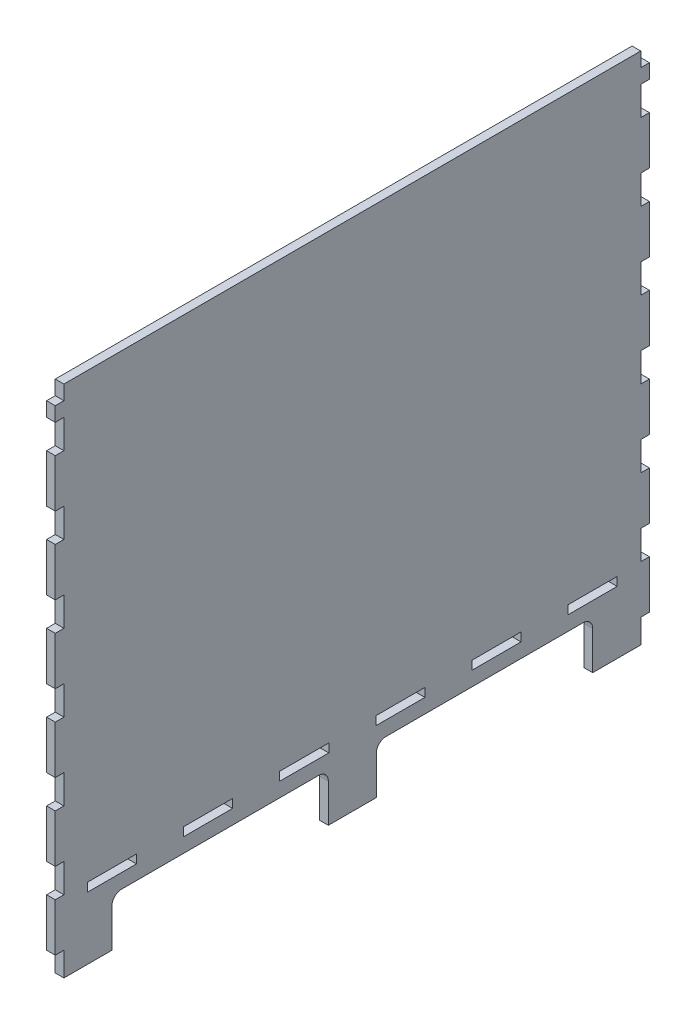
ISO-10303-21;
HEADER;
FILE_DESCRIPTION(('STEP AP214'),'2;1');
FILE_NAME('part.step','',(''),(''),'','','');
FILE_SCHEMA(('AUTOMOTIVE_DESIGN { 1 0 10303 214 1 1 1 1 }'));
ENDSEC;
DATA;
#1=APPLICATION_CONTEXT('core data for automotive mechanical design processes');
#2=APPLICATION_PROTOCOL_DEFINITION('international standard','automotive_design',2000,#1);
#3=PRODUCT_CONTEXT('',#1,'mechanical');
#4=PRODUCT('Part','Part','',(#3));
#5=PRODUCT_RELATED_PRODUCT_CATEGORY('part','',(#4));
#6=PRODUCT_DEFINITION_FORMATION('','',#4);
#7=PRODUCT_DEFINITION_CONTEXT('part definition',#1,'design');
#8=PRODUCT_DEFINITION('design','',#6,#7);
#9=PRODUCT_DEFINITION_SHAPE('','',#8);
#10=(LENGTH_UNIT() NAMED_UNIT(*) SI_UNIT(.MILLI.,.METRE.));
#11=(NAMED_UNIT(*) PLANE_ANGLE_UNIT() SI_UNIT($,.RADIAN.));
#12=(NAMED_UNIT(*) SI_UNIT($,.STERADIAN.) SOLID_ANGLE_UNIT());
#13=UNCERTAINTY_MEASURE_WITH_UNIT(LENGTH_MEASURE(1.E-05),#10,'distance_accuracy_value','');
#14=(GEOMETRIC_REPRESENTATION_CONTEXT(3) GLOBAL_UNCERTAINTY_ASSIGNED_CONTEXT((#13)) GLOBAL_UNIT_ASSIGNED_CONTEXT((#10,
#11,#12)) REPRESENTATION_CONTEXT('',''));
#15=CARTESIAN_POINT('',(0.,0.,0.));
#16=DIRECTION('',(0.,0.,1.));
#17=DIRECTION('',(1.,0.,0.));
#18=AXIS2_PLACEMENT_3D('',#15,#16,#17);
#19=CARTESIAN_POINT('',(0.,-224.332601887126,-224.5));
#20=DIRECTION('',(0.,-1.,0.));
#21=DIRECTION('',(0.,0.,-1.));
#22=AXIS2_PLACEMENT_3D('',#19,#20,#21);
#23=PLANE('',#22);
#24=DIRECTION('',(0.,0.,-1.));
#25=VECTOR('',#24,1.);
#26=CARTESIAN_POINT('',(9.,-224.332601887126,-224.5));
#27=LINE('',#26,#25);
#28=CARTESIAN_POINT('',(9.,-224.332601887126,-224.5));
#29=VERTEX_POINT('',#28);
#30=CARTESIAN_POINT('',(9.,-224.332601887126,-275.5));
#31=VERTEX_POINT('',#30);
#32=EDGE_CURVE('E1312',#29,#31,#27,.T.);
#33=ORIENTED_EDGE('',*,*,#32,.T.);
#34=DIRECTION('',(1.,0.,0.));
#35=VECTOR('',#34,1.);
#36=CARTESIAN_POINT('',(0.,-224.332601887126,-275.5));
#37=LINE('',#36,#35);
#38=CARTESIAN_POINT('',(0.,-224.332601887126,-275.5));
#39=VERTEX_POINT('',#38);
#40=EDGE_CURVE('E11',#39,#31,#37,.T.);
#41=ORIENTED_EDGE('',*,*,#40,.F.);
#42=DIRECTION('',(0.,0.,-1.));
#43=VECTOR('',#42,1.);
#44=CARTESIAN_POINT('',(0.,-224.332601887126,-224.5));
#45=LINE('',#44,#43);
#46=CARTESIAN_POINT('',(0.,-224.332601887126,-224.5));
#47=VERTEX_POINT('',#46);
#48=EDGE_CURVE('E1316',#47,#39,#45,.T.);
#49=ORIENTED_EDGE('',*,*,#48,.F.);
#50=DIRECTION('',(1.,0.,0.));
#51=VECTOR('',#50,1.);
#52=CARTESIAN_POINT('',(0.,-224.332601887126,-224.5));
#53=LINE('',#52,#51);
#54=EDGE_CURVE('E1321',#47,#29,#53,.T.);
#55=ORIENTED_EDGE('',*,*,#54,.T.);
#56=EDGE_LOOP('',(#33,#41,#49,#55));
#57=FACE_BOUND('',#56,.T.);
#58=ADVANCED_FACE('F35',(#57),#23,.F.);
#59=CARTESIAN_POINT('',(0.,-215.332601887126,-275.5));
#60=DIRECTION('',(0.,0.,-1.));
#61=DIRECTION('',(-1.,0.,0.));
#62=AXIS2_PLACEMENT_3D('',#59,#60,#61);
#63=PLANE('',#62);
#64=DIRECTION('',(0.,1.,0.));
#65=VECTOR('',#64,1.);
#66=CARTESIAN_POINT('',(9.,-215.332601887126,-275.5));
#67=LINE('',#66,#65);
#68=CARTESIAN_POINT('',(9.,-215.332601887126,-275.5));
#69=VERTEX_POINT('',#68);
#70=EDGE_CURVE('E1309',#31,#69,#67,.T.);
#71=ORIENTED_EDGE('',*,*,#70,.T.);
#72=DIRECTION('',(1.,0.,0.));
#73=VECTOR('',#72,1.);
#74=CARTESIAN_POINT('',(0.,-215.332601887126,-275.5));
#75=LINE('',#74,#73);
#76=CARTESIAN_POINT('',(0.,-215.332601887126,-275.5));
#77=VERTEX_POINT('',#76);
#78=EDGE_CURVE('E42',#77,#69,#75,.T.);
#79=ORIENTED_EDGE('',*,*,#78,.F.);
#80=DIRECTION('',(0.,1.,0.));
#81=VECTOR('',#80,1.);
#82=CARTESIAN_POINT('',(0.,-215.332601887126,-275.5));
#83=LINE('',#82,#81);
#84=EDGE_CURVE('E56',#39,#77,#83,.T.);
#85=ORIENTED_EDGE('',*,*,#84,.F.);
#86=ORIENTED_EDGE('',*,*,#40,.T.);
#87=EDGE_LOOP('',(#71,#79,#85,#86));
#88=FACE_BOUND('',#87,.T.);
#89=ADVANCED_FACE('F1331',(#88),#63,.F.);
#90=CARTESIAN_POINT('',(0.,-215.332601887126,-224.5));
#91=DIRECTION('',(0.,1.,0.));
#92=DIRECTION('',(0.,0.,1.));
#93=AXIS2_PLACEMENT_3D('',#90,#91,#92);
#94=PLANE('',#93);
#95=DIRECTION('',(0.,0.,1.));
#96=VECTOR('',#95,1.);
#97=CARTESIAN_POINT('',(9.,-215.332601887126,-224.5));
#98=LINE('',#97,#96);
#99=CARTESIAN_POINT('',(9.,-215.332601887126,-224.5));
#100=VERTEX_POINT('',#99);
#101=EDGE_CURVE('E1306',#69,#100,#98,.T.);
#102=ORIENTED_EDGE('',*,*,#101,.T.);
#103=DIRECTION('',(1.,0.,0.));
#104=VECTOR('',#103,1.);
#105=CARTESIAN_POINT('',(0.,-215.332601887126,-224.5));
#106=LINE('',#105,#104);
#107=CARTESIAN_POINT('',(0.,-215.332601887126,-224.5));
#108=VERTEX_POINT('',#107);
#109=EDGE_CURVE('E1324',#108,#100,#106,.T.);
#110=ORIENTED_EDGE('',*,*,#109,.F.);
#111=DIRECTION('',(0.,0.,1.));
#112=VECTOR('',#111,1.);
#113=CARTESIAN_POINT('',(0.,-215.332601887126,-224.5));
#114=LINE('',#113,#112);
#115=EDGE_CURVE('E1319',#77,#108,#114,.T.);
#116=ORIENTED_EDGE('',*,*,#115,.F.);
#117=ORIENTED_EDGE('',*,*,#78,.T.);
#118=EDGE_LOOP('',(#102,#110,#116,#117));
#119=FACE_BOUND('',#118,.T.);
#120=ADVANCED_FACE('F1328',(#119),#94,.F.);
#121=CARTESIAN_POINT('',(0.,-215.332601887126,-224.5));
#122=DIRECTION('',(0.,0.,1.));
#123=DIRECTION('',(1.,0.,0.));
#124=AXIS2_PLACEMENT_3D('',#121,#122,#123);
#125=PLANE('',#124);
#126=DIRECTION('',(0.,-1.,0.));
#127=VECTOR('',#126,1.);
#128=CARTESIAN_POINT('',(9.,-215.332601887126,-224.5));
#129=LINE('',#128,#127);
#130=EDGE_CURVE('E1304',#100,#29,#129,.T.);
#131=ORIENTED_EDGE('',*,*,#130,.T.);
#132=ORIENTED_EDGE('',*,*,#54,.F.);
#133=DIRECTION('',(0.,-1.,0.));
#134=VECTOR('',#133,1.);
#135=CARTESIAN_POINT('',(0.,-215.332601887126,-224.5));
#136=LINE('',#135,#134);
#137=EDGE_CURVE('E49',#108,#47,#136,.T.);
#138=ORIENTED_EDGE('',*,*,#137,.F.);
#139=ORIENTED_EDGE('',*,*,#109,.T.);
#140=EDGE_LOOP('',(#131,#132,#138,#139));
#141=FACE_BOUND('',#140,.T.);
#142=ADVANCED_FACE('F1337',(#141),#125,.F.);
#143=CARTESIAN_POINT('',(0.,-224.332601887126,-124.5));
#144=DIRECTION('',(0.,-1.,0.));
#145=DIRECTION('',(0.,0.,-1.));
#146=AXIS2_PLACEMENT_3D('',#143,#144,#145);
#147=PLANE('',#146);
#148=DIRECTION('',(0.,0.,-1.));
#149=VECTOR('',#148,1.);
#150=CARTESIAN_POINT('',(9.,-224.332601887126,-124.5));
#151=LINE('',#150,#149);
#152=CARTESIAN_POINT('',(9.,-224.332601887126,-124.5));
#153=VERTEX_POINT('',#152);
#154=CARTESIAN_POINT('',(9.,-224.332601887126,-175.5));
#155=VERTEX_POINT('',#154);
#156=EDGE_CURVE('E1280',#153,#155,#151,.T.);
#157=ORIENTED_EDGE('',*,*,#156,.T.);
#158=DIRECTION('',(1.,0.,0.));
#159=VECTOR('',#158,1.);
#160=CARTESIAN_POINT('',(0.,-224.332601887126,-175.5));
#161=LINE('',#160,#159);
#162=CARTESIAN_POINT('',(0.,-224.332601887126,-175.5));
#163=VERTEX_POINT('',#162);
#164=EDGE_CURVE('E1301',#163,#155,#161,.T.);
#165=ORIENTED_EDGE('',*,*,#164,.F.);
#166=DIRECTION('',(0.,0.,-1.));
#167=VECTOR('',#166,1.);
#168=CARTESIAN_POINT('',(0.,-224.332601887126,-124.5));
#169=LINE('',#168,#167);
#170=CARTESIAN_POINT('',(0.,-224.332601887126,-124.5));
#171=VERTEX_POINT('',#170);
#172=EDGE_CURVE('E1285',#171,#163,#169,.T.);
#173=ORIENTED_EDGE('',*,*,#172,.F.);
#174=DIRECTION('',(1.,0.,0.));
#175=VECTOR('',#174,1.);
#176=CARTESIAN_POINT('',(0.,-224.332601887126,-124.5));
#177=LINE('',#176,#175);
#178=EDGE_CURVE('E1292',#171,#153,#177,.T.);
#179=ORIENTED_EDGE('',*,*,#178,.T.);
#180=EDGE_LOOP('',(#157,#165,#173,#179));
#181=FACE_BOUND('',#180,.T.);
#182=ADVANCED_FACE('F1339',(#181),#147,.F.);
#183=CARTESIAN_POINT('',(0.,-215.332601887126,-175.5));
#184=DIRECTION('',(0.,0.,-1.));
#185=DIRECTION('',(-1.,0.,0.));
#186=AXIS2_PLACEMENT_3D('',#183,#184,#185);
#187=PLANE('',#186);
#188=DIRECTION('',(0.,1.,0.));
#189=VECTOR('',#188,1.);
#190=CARTESIAN_POINT('',(9.,-215.332601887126,-175.5));
#191=LINE('',#190,#189);
#192=CARTESIAN_POINT('',(9.,-215.332601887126,-175.5));
#193=VERTEX_POINT('',#192);
#194=EDGE_CURVE('E1277',#155,#193,#191,.T.);
#195=ORIENTED_EDGE('',*,*,#194,.T.);
#196=DIRECTION('',(1.,0.,0.));
#197=VECTOR('',#196,1.);
#198=CARTESIAN_POINT('',(0.,-215.332601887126,-175.5));
#199=LINE('',#198,#197);
#200=CARTESIAN_POINT('',(0.,-215.332601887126,-175.5));
#201=VERTEX_POINT('',#200);
#202=EDGE_CURVE('E1298',#201,#193,#199,.T.);
#203=ORIENTED_EDGE('',*,*,#202,.F.);
#204=DIRECTION('',(0.,1.,0.));
#205=VECTOR('',#204,1.);
#206=CARTESIAN_POINT('',(0.,-215.332601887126,-175.5));
#207=LINE('',#206,#205);
#208=EDGE_CURVE('E1287',#163,#201,#207,.T.);
#209=ORIENTED_EDGE('',*,*,#208,.F.);
#210=ORIENTED_EDGE('',*,*,#164,.T.);
#211=EDGE_LOOP('',(#195,#203,#209,#210));
#212=FACE_BOUND('',#211,.T.);
#213=ADVANCED_FACE('F1345',(#212),#187,.F.);
#214=CARTESIAN_POINT('',(0.,-215.332601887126,-124.5));
#215=DIRECTION('',(0.,1.,0.));
#216=DIRECTION('',(0.,0.,1.));
#217=AXIS2_PLACEMENT_3D('',#214,#215,#216);
#218=PLANE('',#217);
#219=DIRECTION('',(0.,0.,1.));
#220=VECTOR('',#219,1.);
#221=CARTESIAN_POINT('',(9.,-215.332601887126,-124.5));
#222=LINE('',#221,#220);
#223=CARTESIAN_POINT('',(9.,-215.332601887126,-124.5));
#224=VERTEX_POINT('',#223);
#225=EDGE_CURVE('E1274',#193,#224,#222,.T.);
#226=ORIENTED_EDGE('',*,*,#225,.T.);
#227=DIRECTION('',(1.,0.,0.));
#228=VECTOR('',#227,1.);
#229=CARTESIAN_POINT('',(0.,-215.332601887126,-124.5));
#230=LINE('',#229,#228);
#231=CARTESIAN_POINT('',(0.,-215.332601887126,-124.5));
#232=VERTEX_POINT('',#231);
#233=EDGE_CURVE('E1295',#232,#224,#230,.T.);
#234=ORIENTED_EDGE('',*,*,#233,.F.);
#235=DIRECTION('',(0.,0.,1.));
#236=VECTOR('',#235,1.);
#237=CARTESIAN_POINT('',(0.,-215.332601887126,-124.5));
#238=LINE('',#237,#236);
#239=EDGE_CURVE('E1289',#201,#232,#238,.T.);
#240=ORIENTED_EDGE('',*,*,#239,.F.);
#241=ORIENTED_EDGE('',*,*,#202,.T.);
#242=EDGE_LOOP('',(#226,#234,#240,#241));
#243=FACE_BOUND('',#242,.T.);
#244=ADVANCED_FACE('F1378',(#243),#218,.F.);
#245=CARTESIAN_POINT('',(0.,-215.332601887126,-124.5));
#246=DIRECTION('',(0.,0.,1.));
#247=DIRECTION('',(1.,0.,0.));
#248=AXIS2_PLACEMENT_3D('',#245,#246,#247);
#249=PLANE('',#248);
#250=DIRECTION('',(0.,-1.,0.));
#251=VECTOR('',#250,1.);
#252=CARTESIAN_POINT('',(9.,-215.332601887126,-124.5));
#253=LINE('',#252,#251);
#254=EDGE_CURVE('E1272',#224,#153,#253,.T.);
#255=ORIENTED_EDGE('',*,*,#254,.T.);
#256=ORIENTED_EDGE('',*,*,#178,.F.);
#257=DIRECTION('',(0.,-1.,0.));
#258=VECTOR('',#257,1.);
#259=CARTESIAN_POINT('',(0.,-215.332601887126,-124.5));
#260=LINE('',#259,#258);
#261=EDGE_CURVE('E1283',#232,#171,#260,.T.);
#262=ORIENTED_EDGE('',*,*,#261,.F.);
#263=ORIENTED_EDGE('',*,*,#233,.T.);
#264=EDGE_LOOP('',(#255,#256,#262,#263));
#265=FACE_BOUND('',#264,.T.);
#266=ADVANCED_FACE('F1388',(#265),#249,.F.);
#267=CARTESIAN_POINT('',(0.,-224.332601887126,-24.5000000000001));
#268=DIRECTION('',(0.,-1.,0.));
#269=DIRECTION('',(0.,0.,-1.));
#270=AXIS2_PLACEMENT_3D('',#267,#268,#269);
#271=PLANE('',#270);
#272=DIRECTION('',(0.,0.,-1.));
#273=VECTOR('',#272,1.);
#274=CARTESIAN_POINT('',(9.,-224.332601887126,-24.5000000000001));
#275=LINE('',#274,#273);
#276=CARTESIAN_POINT('',(9.,-224.332601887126,-24.5000000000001));
#277=VERTEX_POINT('',#276);
#278=CARTESIAN_POINT('',(9.,-224.332601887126,-75.5000000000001));
#279=VERTEX_POINT('',#278);
#280=EDGE_CURVE('E1248',#277,#279,#275,.T.);
#281=ORIENTED_EDGE('',*,*,#280,.T.);
#282=DIRECTION('',(1.,0.,0.));
#283=VECTOR('',#282,1.);
#284=CARTESIAN_POINT('',(0.,-224.332601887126,-75.5000000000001));
#285=LINE('',#284,#283);
#286=CARTESIAN_POINT('',(0.,-224.332601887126,-75.5000000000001));
#287=VERTEX_POINT('',#286);
#288=EDGE_CURVE('E1269',#287,#279,#285,.T.);
#289=ORIENTED_EDGE('',*,*,#288,.F.);
#290=DIRECTION('',(0.,0.,-1.));
#291=VECTOR('',#290,1.);
#292=CARTESIAN_POINT('',(0.,-224.332601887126,-24.5000000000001));
#293=LINE('',#292,#291);
#294=CARTESIAN_POINT('',(0.,-224.332601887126,-24.5000000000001));
#295=VERTEX_POINT('',#294);
#296=EDGE_CURVE('E1253',#295,#287,#293,.T.);
#297=ORIENTED_EDGE('',*,*,#296,.F.);
#298=DIRECTION('',(1.,0.,0.));
#299=VECTOR('',#298,1.);
#300=CARTESIAN_POINT('',(0.,-224.332601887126,-24.5000000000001));
#301=LINE('',#300,#299);
#302=EDGE_CURVE('E1260',#295,#277,#301,.T.);
#303=ORIENTED_EDGE('',*,*,#302,.T.);
#304=EDGE_LOOP('',(#281,#289,#297,#303));
#305=FACE_BOUND('',#304,.T.);
#306=ADVANCED_FACE('F1398',(#305),#271,.F.);
#307=CARTESIAN_POINT('',(0.,-215.332601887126,-75.5000000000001));
#308=DIRECTION('',(0.,0.,-1.));
#309=DIRECTION('',(-1.,0.,0.));
#310=AXIS2_PLACEMENT_3D('',#307,#308,#309);
#311=PLANE('',#310);
#312=DIRECTION('',(0.,1.,0.));
#313=VECTOR('',#312,1.);
#314=CARTESIAN_POINT('',(9.,-215.332601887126,-75.5000000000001));
#315=LINE('',#314,#313);
#316=CARTESIAN_POINT('',(9.,-215.332601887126,-75.5000000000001));
#317=VERTEX_POINT('',#316);
#318=EDGE_CURVE('E1245',#279,#317,#315,.T.);
#319=ORIENTED_EDGE('',*,*,#318,.T.);
#320=DIRECTION('',(1.,0.,0.));
#321=VECTOR('',#320,1.);
#322=CARTESIAN_POINT('',(0.,-215.332601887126,-75.5000000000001));
#323=LINE('',#322,#321);
#324=CARTESIAN_POINT('',(0.,-215.332601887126,-75.5000000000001));
#325=VERTEX_POINT('',#324);
#326=EDGE_CURVE('E1266',#325,#317,#323,.T.);
#327=ORIENTED_EDGE('',*,*,#326,.F.);
#328=DIRECTION('',(0.,1.,0.));
#329=VECTOR('',#328,1.);
#330=CARTESIAN_POINT('',(0.,-215.332601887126,-75.5000000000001));
#331=LINE('',#330,#329);
#332=EDGE_CURVE('E1255',#287,#325,#331,.T.);
#333=ORIENTED_EDGE('',*,*,#332,.F.);
#334=ORIENTED_EDGE('',*,*,#288,.T.);
#335=EDGE_LOOP('',(#319,#327,#333,#334));
#336=FACE_BOUND('',#335,.T.);
#337=ADVANCED_FACE('F1408',(#336),#311,.F.);
#338=CARTESIAN_POINT('',(0.,-215.332601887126,-24.5000000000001));
#339=DIRECTION('',(0.,1.,0.));
#340=DIRECTION('',(0.,0.,1.));
#341=AXIS2_PLACEMENT_3D('',#338,#339,#340);
#342=PLANE('',#341);
#343=DIRECTION('',(0.,0.,1.));
#344=VECTOR('',#343,1.);
#345=CARTESIAN_POINT('',(9.,-215.332601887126,-24.5000000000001));
#346=LINE('',#345,#344);
#347=CARTESIAN_POINT('',(9.,-215.332601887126,-24.5000000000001));
#348=VERTEX_POINT('',#347);
#349=EDGE_CURVE('E1242',#317,#348,#346,.T.);
#350=ORIENTED_EDGE('',*,*,#349,.T.);
#351=DIRECTION('',(1.,0.,0.));
#352=VECTOR('',#351,1.);
#353=CARTESIAN_POINT('',(0.,-215.332601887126,-24.5000000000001));
#354=LINE('',#353,#352);
#355=CARTESIAN_POINT('',(0.,-215.332601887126,-24.5000000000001));
#356=VERTEX_POINT('',#355);
#357=EDGE_CURVE('E1263',#356,#348,#354,.T.);
#358=ORIENTED_EDGE('',*,*,#357,.F.);
#359=DIRECTION('',(0.,0.,1.));
#360=VECTOR('',#359,1.);
#361=CARTESIAN_POINT('',(0.,-215.332601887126,-24.5000000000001));
#362=LINE('',#361,#360);
#363=EDGE_CURVE('E1257',#325,#356,#362,.T.);
#364=ORIENTED_EDGE('',*,*,#363,.F.);
#365=ORIENTED_EDGE('',*,*,#326,.T.);
#366=EDGE_LOOP('',(#350,#358,#364,#365));
#367=FACE_BOUND('',#366,.T.);
#368=ADVANCED_FACE('F1418',(#367),#342,.F.);
#369=CARTESIAN_POINT('',(0.,-215.332601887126,-24.5000000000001));
#370=DIRECTION('',(0.,0.,1.));
#371=DIRECTION('',(1.,0.,0.));
#372=AXIS2_PLACEMENT_3D('',#369,#370,#371);
#373=PLANE('',#372);
#374=DIRECTION('',(0.,-1.,0.));
#375=VECTOR('',#374,1.);
#376=CARTESIAN_POINT('',(9.,-215.332601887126,-24.5000000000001));
#377=LINE('',#376,#375);
#378=EDGE_CURVE('E1240',#348,#277,#377,.T.);
#379=ORIENTED_EDGE('',*,*,#378,.T.);
#380=ORIENTED_EDGE('',*,*,#302,.F.);
#381=DIRECTION('',(0.,-1.,0.));
#382=VECTOR('',#381,1.);
#383=CARTESIAN_POINT('',(0.,-215.332601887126,-24.5000000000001));
#384=LINE('',#383,#382);
#385=EDGE_CURVE('E1251',#356,#295,#384,.T.);
#386=ORIENTED_EDGE('',*,*,#385,.F.);
#387=ORIENTED_EDGE('',*,*,#357,.T.);
#388=EDGE_LOOP('',(#379,#380,#386,#387));
#389=FACE_BOUND('',#388,.T.);
#390=ADVANCED_FACE('F1428',(#389),#373,.F.);
#391=CARTESIAN_POINT('',(0.,-224.332601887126,75.5));
#392=DIRECTION('',(0.,-1.,0.));
#393=DIRECTION('',(0.,0.,-1.));
#394=AXIS2_PLACEMENT_3D('',#391,#392,#393);
#395=PLANE('',#394);
#396=DIRECTION('',(0.,0.,-1.));
#397=VECTOR('',#396,1.);
#398=CARTESIAN_POINT('',(9.,-224.332601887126,75.5));
#399=LINE('',#398,#397);
#400=CARTESIAN_POINT('',(9.,-224.332601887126,75.5));
#401=VERTEX_POINT('',#400);
#402=CARTESIAN_POINT('',(9.,-224.332601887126,24.5));
#403=VERTEX_POINT('',#402);
#404=EDGE_CURVE('E1216',#401,#403,#399,.T.);
#405=ORIENTED_EDGE('',*,*,#404,.T.);
#406=DIRECTION('',(1.,0.,0.));
#407=VECTOR('',#406,1.);
#408=CARTESIAN_POINT('',(0.,-224.332601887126,24.5));
#409=LINE('',#408,#407);
#410=CARTESIAN_POINT('',(0.,-224.332601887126,24.5));
#411=VERTEX_POINT('',#410);
#412=EDGE_CURVE('E1237',#411,#403,#409,.T.);
#413=ORIENTED_EDGE('',*,*,#412,.F.);
#414=DIRECTION('',(0.,0.,-1.));
#415=VECTOR('',#414,1.);
#416=CARTESIAN_POINT('',(0.,-224.332601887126,75.5));
#417=LINE('',#416,#415);
#418=CARTESIAN_POINT('',(0.,-224.332601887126,75.5));
#419=VERTEX_POINT('',#418);
#420=EDGE_CURVE('E1221',#419,#411,#417,.T.);
#421=ORIENTED_EDGE('',*,*,#420,.F.);
#422=DIRECTION('',(1.,0.,0.));
#423=VECTOR('',#422,1.);
#424=CARTESIAN_POINT('',(0.,-224.332601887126,75.5));
#425=LINE('',#424,#423);
#426=EDGE_CURVE('E1228',#419,#401,#425,.T.);
#427=ORIENTED_EDGE('',*,*,#426,.T.);
#428=EDGE_LOOP('',(#405,#413,#421,#427));
#429=FACE_BOUND('',#428,.T.);
#430=ADVANCED_FACE('F1438',(#429),#395,.F.);
#431=CARTESIAN_POINT('',(0.,-215.332601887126,24.5));
#432=DIRECTION('',(0.,0.,-1.));
#433=DIRECTION('',(-1.,0.,0.));
#434=AXIS2_PLACEMENT_3D('',#431,#432,#433);
#435=PLANE('',#434);
#436=DIRECTION('',(0.,1.,0.));
#437=VECTOR('',#436,1.);
#438=CARTESIAN_POINT('',(9.,-215.332601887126,24.5));
#439=LINE('',#438,#437);
#440=CARTESIAN_POINT('',(9.,-215.332601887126,24.5));
#441=VERTEX_POINT('',#440);
#442=EDGE_CURVE('E1213',#403,#441,#439,.T.);
#443=ORIENTED_EDGE('',*,*,#442,.T.);
#444=DIRECTION('',(1.,0.,0.));
#445=VECTOR('',#444,1.);
#446=CARTESIAN_POINT('',(0.,-215.332601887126,24.5));
#447=LINE('',#446,#445);
#448=CARTESIAN_POINT('',(0.,-215.332601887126,24.5));
#449=VERTEX_POINT('',#448);
#450=EDGE_CURVE('E1234',#449,#441,#447,.T.);
#451=ORIENTED_EDGE('',*,*,#450,.F.);
#452=DIRECTION('',(0.,1.,0.));
#453=VECTOR('',#452,1.);
#454=CARTESIAN_POINT('',(0.,-215.332601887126,24.5));
#455=LINE('',#454,#453);
#456=EDGE_CURVE('E1223',#411,#449,#455,.T.);
#457=ORIENTED_EDGE('',*,*,#456,.F.);
#458=ORIENTED_EDGE('',*,*,#412,.T.);
#459=EDGE_LOOP('',(#443,#451,#457,#458));
#460=FACE_BOUND('',#459,.T.);
#461=ADVANCED_FACE('F1448',(#460),#435,.F.);
#462=CARTESIAN_POINT('',(0.,-215.332601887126,75.5));
#463=DIRECTION('',(0.,1.,0.));
#464=DIRECTION('',(0.,0.,1.));
#465=AXIS2_PLACEMENT_3D('',#462,#463,#464);
#466=PLANE('',#465);
#467=DIRECTION('',(0.,0.,1.));
#468=VECTOR('',#467,1.);
#469=CARTESIAN_POINT('',(9.,-215.332601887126,75.5));
#470=LINE('',#469,#468);
#471=CARTESIAN_POINT('',(9.,-215.332601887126,75.5));
#472=VERTEX_POINT('',#471);
#473=EDGE_CURVE('E1210',#441,#472,#470,.T.);
#474=ORIENTED_EDGE('',*,*,#473,.T.);
#475=DIRECTION('',(1.,0.,0.));
#476=VECTOR('',#475,1.);
#477=CARTESIAN_POINT('',(0.,-215.332601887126,75.5));
#478=LINE('',#477,#476);
#479=CARTESIAN_POINT('',(0.,-215.332601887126,75.5));
#480=VERTEX_POINT('',#479);
#481=EDGE_CURVE('E1231',#480,#472,#478,.T.);
#482=ORIENTED_EDGE('',*,*,#481,.F.);
#483=DIRECTION('',(0.,0.,1.));
#484=VECTOR('',#483,1.);
#485=CARTESIAN_POINT('',(0.,-215.332601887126,75.5));
#486=LINE('',#485,#484);
#487=EDGE_CURVE('E1225',#449,#480,#486,.T.);
#488=ORIENTED_EDGE('',*,*,#487,.F.);
#489=ORIENTED_EDGE('',*,*,#450,.T.);
#490=EDGE_LOOP('',(#474,#482,#488,#489));
#491=FACE_BOUND('',#490,.T.);
#492=ADVANCED_FACE('F1458',(#491),#466,.F.);
#493=CARTESIAN_POINT('',(0.,-215.332601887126,75.5));
#494=DIRECTION('',(0.,0.,1.));
#495=DIRECTION('',(1.,0.,0.));
#496=AXIS2_PLACEMENT_3D('',#493,#494,#495);
#497=PLANE('',#496);
#498=DIRECTION('',(0.,-1.,0.));
#499=VECTOR('',#498,1.);
#500=CARTESIAN_POINT('',(9.,-215.332601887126,75.5));
#501=LINE('',#500,#499);
#502=EDGE_CURVE('E1208',#472,#401,#501,.T.);
#503=ORIENTED_EDGE('',*,*,#502,.T.);
#504=ORIENTED_EDGE('',*,*,#426,.F.);
#505=DIRECTION('',(0.,-1.,0.));
#506=VECTOR('',#505,1.);
#507=CARTESIAN_POINT('',(0.,-215.332601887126,75.5));
#508=LINE('',#507,#506);
#509=EDGE_CURVE('E1219',#480,#419,#508,.T.);
#510=ORIENTED_EDGE('',*,*,#509,.F.);
#511=ORIENTED_EDGE('',*,*,#481,.T.);
#512=EDGE_LOOP('',(#503,#504,#510,#511));
#513=FACE_BOUND('',#512,.T.);
#514=ADVANCED_FACE('F1468',(#513),#497,.F.);
#515=CARTESIAN_POINT('',(9.,245.667398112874,300.));
#516=DIRECTION('',(0.,0.,-1.));
#517=DIRECTION('',(0.,1.,0.));
#518=AXIS2_PLACEMENT_3D('',#515,#516,#517);
#519=PLANE('',#518);
#520=DIRECTION('',(0.,-1.,0.));
#521=VECTOR('',#520,1.);
#522=CARTESIAN_POINT('',(0.,245.667398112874,300.));
#523=LINE('',#522,#521);
#524=CARTESIAN_POINT('',(0.,245.667398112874,300.));
#525=VERTEX_POINT('',#524);
#526=CARTESIAN_POINT('',(0.,230.667398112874,300.));
#527=VERTEX_POINT('',#526);
#528=EDGE_CURVE('E696',#525,#527,#523,.T.);
#529=ORIENTED_EDGE('',*,*,#528,.T.);
#530=DIRECTION('',(-1.,0.,0.));
#531=VECTOR('',#530,1.);
#532=CARTESIAN_POINT('',(9.,230.667398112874,300.));
#533=LINE('',#532,#531);
#534=CARTESIAN_POINT('',(9.,230.667398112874,300.));
#535=VERTEX_POINT('',#534);
#536=EDGE_CURVE('E1205',#535,#527,#533,.T.);
#537=ORIENTED_EDGE('',*,*,#536,.F.);
#538=DIRECTION('',(0.,-1.,0.));
#539=VECTOR('',#538,1.);
#540=CARTESIAN_POINT('',(9.,245.667398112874,300.));
#541=LINE('',#540,#539);
#542=CARTESIAN_POINT('',(9.,245.667398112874,300.));
#543=VERTEX_POINT('',#542);
#544=EDGE_CURVE('E703',#543,#535,#541,.T.);
#545=ORIENTED_EDGE('',*,*,#544,.F.);
#546=DIRECTION('',(-1.,0.,0.));
#547=VECTOR('',#546,1.);
#548=CARTESIAN_POINT('',(9.,245.667398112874,300.));
#549=LINE('',#548,#547);
#550=EDGE_CURVE('E849',#543,#525,#549,.T.);
#551=ORIENTED_EDGE('',*,*,#550,.T.);
#552=EDGE_LOOP('',(#529,#537,#545,#551));
#553=FACE_BOUND('',#552,.T.);
#554=ADVANCED_FACE('F1478',(#553),#519,.F.);
#555=CARTESIAN_POINT('',(9.,230.667398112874,309.));
#556=DIRECTION('',(0.,-1.,0.));
#557=DIRECTION('',(0.,0.,-1.));
#558=AXIS2_PLACEMENT_3D('',#555,#556,#557);
#559=PLANE('',#558);
#560=DIRECTION('',(0.,0.,1.));
#561=VECTOR('',#560,1.);
#562=CARTESIAN_POINT('',(0.,230.667398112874,309.));
#563=LINE('',#562,#561);
#564=CARTESIAN_POINT('',(0.,230.667398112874,309.));
#565=VERTEX_POINT('',#564);
#566=EDGE_CURVE('E852',#527,#565,#563,.T.);
#567=ORIENTED_EDGE('',*,*,#566,.T.);
#568=DIRECTION('',(-1.,0.,0.));
#569=VECTOR('',#568,1.);
#570=CARTESIAN_POINT('',(9.,230.667398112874,309.));
#571=LINE('',#570,#569);
#572=CARTESIAN_POINT('',(9.,230.667398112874,309.));
#573=VERTEX_POINT('',#572);
#574=EDGE_CURVE('E1202',#573,#565,#571,.T.);
#575=ORIENTED_EDGE('',*,*,#574,.F.);
#576=DIRECTION('',(0.,0.,1.));
#577=VECTOR('',#576,1.);
#578=CARTESIAN_POINT('',(9.,230.667398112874,309.));
#579=LINE('',#578,#577);
#580=EDGE_CURVE('E706',#535,#573,#579,.T.);
#581=ORIENTED_EDGE('',*,*,#580,.F.);
#582=ORIENTED_EDGE('',*,*,#536,.T.);
#583=EDGE_LOOP('',(#567,#575,#581,#582));
#584=FACE_BOUND('',#583,.T.);
#585=ADVANCED_FACE('F1836',(#584),#559,.F.);
#586=CARTESIAN_POINT('',(9.,215.667398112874,309.));
#587=DIRECTION('',(0.,0.,-1.));
#588=DIRECTION('',(-1.,0.,0.));
#589=AXIS2_PLACEMENT_3D('',#586,#587,#588);
#590=PLANE('',#589);
#591=DIRECTION('',(0.,-1.,0.));
#592=VECTOR('',#591,1.);
#593=CARTESIAN_POINT('',(0.,215.667398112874,309.));
#594=LINE('',#593,#592);
#595=CARTESIAN_POINT('',(0.,215.667398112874,309.));
#596=VERTEX_POINT('',#595);
#597=EDGE_CURVE('E854',#565,#596,#594,.T.);
#598=ORIENTED_EDGE('',*,*,#597,.T.);
#599=DIRECTION('',(-1.,0.,0.));
#600=VECTOR('',#599,1.);
#601=CARTESIAN_POINT('',(9.,215.667398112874,309.));
#602=LINE('',#601,#600);
#603=CARTESIAN_POINT('',(9.,215.667398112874,309.));
#604=VERTEX_POINT('',#603);
#605=EDGE_CURVE('E1199',#604,#596,#602,.T.);
#606=ORIENTED_EDGE('',*,*,#605,.F.);
#607=DIRECTION('',(0.,-1.,0.));
#608=VECTOR('',#607,1.);
#609=CARTESIAN_POINT('',(9.,215.667398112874,309.));
#610=LINE('',#609,#608);
#611=EDGE_CURVE('E709',#573,#604,#610,.T.);
#612=ORIENTED_EDGE('',*,*,#611,.F.);
#613=ORIENTED_EDGE('',*,*,#574,.T.);
#614=EDGE_LOOP('',(#598,#606,#612,#613));
#615=FACE_BOUND('',#614,.T.);
#616=ADVANCED_FACE('F1832',(#615),#590,.F.);
#617=CARTESIAN_POINT('',(9.,215.667398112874,300.));
#618=DIRECTION('',(0.,1.,0.));
#619=DIRECTION('',(0.,0.,1.));
#620=AXIS2_PLACEMENT_3D('',#617,#618,#619);
#621=PLANE('',#620);
#622=DIRECTION('',(0.,0.,-1.));
#623=VECTOR('',#622,1.);
#624=CARTESIAN_POINT('',(0.,215.667398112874,300.));
#625=LINE('',#624,#623);
#626=CARTESIAN_POINT('',(0.,215.667398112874,300.));
#627=VERTEX_POINT('',#626);
#628=EDGE_CURVE('E856',#596,#627,#625,.T.);
#629=ORIENTED_EDGE('',*,*,#628,.T.);
#630=DIRECTION('',(-1.,0.,0.));
#631=VECTOR('',#630,1.);
#632=CARTESIAN_POINT('',(9.,215.667398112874,300.));
#633=LINE('',#632,#631);
#634=CARTESIAN_POINT('',(9.,215.667398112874,300.));
#635=VERTEX_POINT('',#634);
#636=EDGE_CURVE('E1196',#635,#627,#633,.T.);
#637=ORIENTED_EDGE('',*,*,#636,.F.);
#638=DIRECTION('',(0.,0.,-1.));
#639=VECTOR('',#638,1.);
#640=CARTESIAN_POINT('',(9.,215.667398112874,300.));
#641=LINE('',#640,#639);
#642=EDGE_CURVE('E711',#604,#635,#641,.T.);
#643=ORIENTED_EDGE('',*,*,#642,.F.);
#644=ORIENTED_EDGE('',*,*,#605,.T.);
#645=EDGE_LOOP('',(#629,#637,#643,#644));
#646=FACE_BOUND('',#645,.T.);
#647=ADVANCED_FACE('F1828',(#646),#621,.F.);
#648=CARTESIAN_POINT('',(9.,215.667398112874,300.));
#649=DIRECTION('',(0.,0.,-1.));
#650=DIRECTION('',(0.,1.,0.));
#651=AXIS2_PLACEMENT_3D('',#648,#649,#650);
#652=PLANE('',#651);
#653=DIRECTION('',(0.,-1.,0.));
#654=VECTOR('',#653,1.);
#655=CARTESIAN_POINT('',(0.,215.667398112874,300.));
#656=LINE('',#655,#654);
#657=CARTESIAN_POINT('',(0.,185.667398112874,300.000000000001));
#658=VERTEX_POINT('',#657);
#659=EDGE_CURVE('E858',#627,#658,#656,.T.);
#660=ORIENTED_EDGE('',*,*,#659,.T.);
#661=DIRECTION('',(-1.,0.,0.));
#662=VECTOR('',#661,1.);
#663=CARTESIAN_POINT('',(9.,185.667398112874,300.000000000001));
#664=LINE('',#663,#662);
#665=CARTESIAN_POINT('',(9.,185.667398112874,300.000000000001));
#666=VERTEX_POINT('',#665);
#667=EDGE_CURVE('E1193',#666,#658,#664,.T.);
#668=ORIENTED_EDGE('',*,*,#667,.F.);
#669=DIRECTION('',(0.,-1.,0.));
#670=VECTOR('',#669,1.);
#671=CARTESIAN_POINT('',(9.,215.667398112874,300.));
#672=LINE('',#671,#670);
#673=EDGE_CURVE('E713',#635,#666,#672,.T.);
#674=ORIENTED_EDGE('',*,*,#673,.F.);
#675=ORIENTED_EDGE('',*,*,#636,.T.);
#676=EDGE_LOOP('',(#660,#668,#674,#675));
#677=FACE_BOUND('',#676,.T.);
#678=ADVANCED_FACE('F1824',(#677),#652,.F.);
#679=CARTESIAN_POINT('',(9.,185.667398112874,309.000000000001));
#680=DIRECTION('',(0.,-1.,0.));
#681=DIRECTION('',(0.,0.,-1.));
#682=AXIS2_PLACEMENT_3D('',#679,#680,#681);
#683=PLANE('',#682);
#684=DIRECTION('',(0.,0.,1.));
#685=VECTOR('',#684,1.);
#686=CARTESIAN_POINT('',(0.,185.667398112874,309.000000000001));
#687=LINE('',#686,#685);
#688=CARTESIAN_POINT('',(0.,185.667398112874,309.000000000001));
#689=VERTEX_POINT('',#688);
#690=EDGE_CURVE('E860',#658,#689,#687,.T.);
#691=ORIENTED_EDGE('',*,*,#690,.T.);
#692=DIRECTION('',(-1.,0.,0.));
#693=VECTOR('',#692,1.);
#694=CARTESIAN_POINT('',(9.,185.667398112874,309.000000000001));
#695=LINE('',#694,#693);
#696=CARTESIAN_POINT('',(9.,185.667398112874,309.000000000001));
#697=VERTEX_POINT('',#696);
#698=EDGE_CURVE('E1190',#697,#689,#695,.T.);
#699=ORIENTED_EDGE('',*,*,#698,.F.);
#700=DIRECTION('',(0.,0.,1.));
#701=VECTOR('',#700,1.);
#702=CARTESIAN_POINT('',(9.,185.667398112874,309.000000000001));
#703=LINE('',#702,#701);
#704=EDGE_CURVE('E715',#666,#697,#703,.T.);
#705=ORIENTED_EDGE('',*,*,#704,.F.);
#706=ORIENTED_EDGE('',*,*,#667,.T.);
#707=EDGE_LOOP('',(#691,#699,#705,#706));
#708=FACE_BOUND('',#707,.T.);
#709=ADVANCED_FACE('F1820',(#708),#683,.F.);
#710=CARTESIAN_POINT('',(9.,135.667398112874,309.000000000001));
#711=DIRECTION('',(0.,0.,-1.));
#712=DIRECTION('',(-1.,0.,0.));
#713=AXIS2_PLACEMENT_3D('',#710,#711,#712);
#714=PLANE('',#713);
#715=DIRECTION('',(0.,-1.,0.));
#716=VECTOR('',#715,1.);
#717=CARTESIAN_POINT('',(0.,135.667398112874,309.000000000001));
#718=LINE('',#717,#716);
#719=CARTESIAN_POINT('',(0.,135.667398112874,309.000000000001));
#720=VERTEX_POINT('',#719);
#721=EDGE_CURVE('E862',#689,#720,#718,.T.);
#722=ORIENTED_EDGE('',*,*,#721,.T.);
#723=DIRECTION('',(-1.,0.,0.));
#724=VECTOR('',#723,1.);
#725=CARTESIAN_POINT('',(9.,135.667398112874,309.000000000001));
#726=LINE('',#725,#724);
#727=CARTESIAN_POINT('',(9.,135.667398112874,309.000000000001));
#728=VERTEX_POINT('',#727);
#729=EDGE_CURVE('E1187',#728,#720,#726,.T.);
#730=ORIENTED_EDGE('',*,*,#729,.F.);
#731=DIRECTION('',(0.,-1.,0.));
#732=VECTOR('',#731,1.);
#733=CARTESIAN_POINT('',(9.,135.667398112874,309.000000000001));
#734=LINE('',#733,#732);
#735=EDGE_CURVE('E717',#697,#728,#734,.T.);
#736=ORIENTED_EDGE('',*,*,#735,.F.);
#737=ORIENTED_EDGE('',*,*,#698,.T.);
#738=EDGE_LOOP('',(#722,#730,#736,#737));
#739=FACE_BOUND('',#738,.T.);
#740=ADVANCED_FACE('F1816',(#739),#714,.F.);
#741=CARTESIAN_POINT('',(9.,135.667398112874,300.000000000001));
#742=DIRECTION('',(0.,1.,0.));
#743=DIRECTION('',(0.,0.,1.));
#744=AXIS2_PLACEMENT_3D('',#741,#742,#743);
#745=PLANE('',#744);
#746=DIRECTION('',(0.,0.,-1.));
#747=VECTOR('',#746,1.);
#748=CARTESIAN_POINT('',(0.,135.667398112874,300.000000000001));
#749=LINE('',#748,#747);
#750=CARTESIAN_POINT('',(0.,135.667398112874,300.000000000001));
#751=VERTEX_POINT('',#750);
#752=EDGE_CURVE('E864',#720,#751,#749,.T.);
#753=ORIENTED_EDGE('',*,*,#752,.T.);
#754=DIRECTION('',(-1.,0.,0.));
#755=VECTOR('',#754,1.);
#756=CARTESIAN_POINT('',(9.,135.667398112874,300.000000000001));
#757=LINE('',#756,#755);
#758=CARTESIAN_POINT('',(9.,135.667398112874,300.000000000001));
#759=VERTEX_POINT('',#758);
#760=EDGE_CURVE('E1184',#759,#751,#757,.T.);
#761=ORIENTED_EDGE('',*,*,#760,.F.);
#762=DIRECTION('',(0.,0.,-1.));
#763=VECTOR('',#762,1.);
#764=CARTESIAN_POINT('',(9.,135.667398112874,300.000000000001));
#765=LINE('',#764,#763);
#766=EDGE_CURVE('E719',#728,#759,#765,.T.);
#767=ORIENTED_EDGE('',*,*,#766,.F.);
#768=ORIENTED_EDGE('',*,*,#729,.T.);
#769=EDGE_LOOP('',(#753,#761,#767,#768));
#770=FACE_BOUND('',#769,.T.);
#771=ADVANCED_FACE('F1812',(#770),#745,.F.);
#772=CARTESIAN_POINT('',(9.,135.667398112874,300.000000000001));
#773=DIRECTION('',(0.,0.,-1.));
#774=DIRECTION('',(0.,1.,0.));
#775=AXIS2_PLACEMENT_3D('',#772,#773,#774);
#776=PLANE('',#775);
#777=DIRECTION('',(0.,-1.,0.));
#778=VECTOR('',#777,1.);
#779=CARTESIAN_POINT('',(0.,135.667398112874,300.000000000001));
#780=LINE('',#779,#778);
#781=CARTESIAN_POINT('',(0.,105.667398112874,300.000000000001));
#782=VERTEX_POINT('',#781);
#783=EDGE_CURVE('E866',#751,#782,#780,.T.);
#784=ORIENTED_EDGE('',*,*,#783,.T.);
#785=DIRECTION('',(-1.,0.,0.));
#786=VECTOR('',#785,1.);
#787=CARTESIAN_POINT('',(9.,105.667398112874,300.000000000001));
#788=LINE('',#787,#786);
#789=CARTESIAN_POINT('',(9.,105.667398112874,300.000000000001));
#790=VERTEX_POINT('',#789);
#791=EDGE_CURVE('E1181',#790,#782,#788,.T.);
#792=ORIENTED_EDGE('',*,*,#791,.F.);
#793=DIRECTION('',(0.,-1.,0.));
#794=VECTOR('',#793,1.);
#795=CARTESIAN_POINT('',(9.,135.667398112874,300.000000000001));
#796=LINE('',#795,#794);
#797=EDGE_CURVE('E721',#759,#790,#796,.T.);
#798=ORIENTED_EDGE('',*,*,#797,.F.);
#799=ORIENTED_EDGE('',*,*,#760,.T.);
#800=EDGE_LOOP('',(#784,#792,#798,#799));
#801=FACE_BOUND('',#800,.T.);
#802=ADVANCED_FACE('F1808',(#801),#776,.F.);
#803=CARTESIAN_POINT('',(9.,105.667398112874,309.000000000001));
#804=DIRECTION('',(0.,-1.,0.));
#805=DIRECTION('',(0.,0.,-1.));
#806=AXIS2_PLACEMENT_3D('',#803,#804,#805);
#807=PLANE('',#806);
#808=DIRECTION('',(0.,0.,1.));
#809=VECTOR('',#808,1.);
#810=CARTESIAN_POINT('',(0.,105.667398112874,309.000000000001));
#811=LINE('',#810,#809);
#812=CARTESIAN_POINT('',(0.,105.667398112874,309.000000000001));
#813=VERTEX_POINT('',#812);
#814=EDGE_CURVE('E868',#782,#813,#811,.T.);
#815=ORIENTED_EDGE('',*,*,#814,.T.);
#816=DIRECTION('',(-1.,0.,0.));
#817=VECTOR('',#816,1.);
#818=CARTESIAN_POINT('',(9.,105.667398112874,309.000000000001));
#819=LINE('',#818,#817);
#820=CARTESIAN_POINT('',(9.,105.667398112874,309.000000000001));
#821=VERTEX_POINT('',#820);
#822=EDGE_CURVE('E1178',#821,#813,#819,.T.);
#823=ORIENTED_EDGE('',*,*,#822,.F.);
#824=DIRECTION('',(0.,0.,1.));
#825=VECTOR('',#824,1.);
#826=CARTESIAN_POINT('',(9.,105.667398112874,309.000000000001));
#827=LINE('',#826,#825);
#828=EDGE_CURVE('E723',#790,#821,#827,.T.);
#829=ORIENTED_EDGE('',*,*,#828,.F.);
#830=ORIENTED_EDGE('',*,*,#791,.T.);
#831=EDGE_LOOP('',(#815,#823,#829,#830));
#832=FACE_BOUND('',#831,.T.);
#833=ADVANCED_FACE('F1804',(#832),#807,.F.);
#834=CARTESIAN_POINT('',(9.,55.6673981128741,309.000000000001));
#835=DIRECTION('',(0.,0.,-1.));
#836=DIRECTION('',(-1.,0.,0.));
#837=AXIS2_PLACEMENT_3D('',#834,#835,#836);
#838=PLANE('',#837);
#839=DIRECTION('',(0.,-1.,0.));
#840=VECTOR('',#839,1.);
#841=CARTESIAN_POINT('',(0.,55.6673981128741,309.000000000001));
#842=LINE('',#841,#840);
#843=CARTESIAN_POINT('',(0.,55.6673981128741,309.000000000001));
#844=VERTEX_POINT('',#843);
#845=EDGE_CURVE('E870',#813,#844,#842,.T.);
#846=ORIENTED_EDGE('',*,*,#845,.T.);
#847=DIRECTION('',(-1.,0.,0.));
#848=VECTOR('',#847,1.);
#849=CARTESIAN_POINT('',(9.,55.6673981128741,309.000000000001));
#850=LINE('',#849,#848);
#851=CARTESIAN_POINT('',(9.,55.6673981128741,309.000000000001));
#852=VERTEX_POINT('',#851);
#853=EDGE_CURVE('E1175',#852,#844,#850,.T.);
#854=ORIENTED_EDGE('',*,*,#853,.F.);
#855=DIRECTION('',(0.,-1.,0.));
#856=VECTOR('',#855,1.);
#857=CARTESIAN_POINT('',(9.,55.6673981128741,309.000000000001));
#858=LINE('',#857,#856);
#859=EDGE_CURVE('E725',#821,#852,#858,.T.);
#860=ORIENTED_EDGE('',*,*,#859,.F.);
#861=ORIENTED_EDGE('',*,*,#822,.T.);
#862=EDGE_LOOP('',(#846,#854,#860,#861));
#863=FACE_BOUND('',#862,.T.);
#864=ADVANCED_FACE('F1800',(#863),#838,.F.);
#865=CARTESIAN_POINT('',(9.,55.6673981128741,300.000000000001));
#866=DIRECTION('',(0.,1.,0.));
#867=DIRECTION('',(0.,0.,1.));
#868=AXIS2_PLACEMENT_3D('',#865,#866,#867);
#869=PLANE('',#868);
#870=DIRECTION('',(0.,0.,-1.));
#871=VECTOR('',#870,1.);
#872=CARTESIAN_POINT('',(0.,55.6673981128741,300.000000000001));
#873=LINE('',#872,#871);
#874=CARTESIAN_POINT('',(0.,55.6673981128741,300.000000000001));
#875=VERTEX_POINT('',#874);
#876=EDGE_CURVE('E872',#844,#875,#873,.T.);
#877=ORIENTED_EDGE('',*,*,#876,.T.);
#878=DIRECTION('',(-1.,0.,0.));
#879=VECTOR('',#878,1.);
#880=CARTESIAN_POINT('',(9.,55.6673981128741,300.000000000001));
#881=LINE('',#880,#879);
#882=CARTESIAN_POINT('',(9.,55.6673981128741,300.000000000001));
#883=VERTEX_POINT('',#882);
#884=EDGE_CURVE('E1172',#883,#875,#881,.T.);
#885=ORIENTED_EDGE('',*,*,#884,.F.);
#886=DIRECTION('',(0.,0.,-1.));
#887=VECTOR('',#886,1.);
#888=CARTESIAN_POINT('',(9.,55.6673981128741,300.000000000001));
#889=LINE('',#888,#887);
#890=EDGE_CURVE('E727',#852,#883,#889,.T.);
#891=ORIENTED_EDGE('',*,*,#890,.F.);
#892=ORIENTED_EDGE('',*,*,#853,.T.);
#893=EDGE_LOOP('',(#877,#885,#891,#892));
#894=FACE_BOUND('',#893,.T.);
#895=ADVANCED_FACE('F1796',(#894),#869,.F.);
#896=CARTESIAN_POINT('',(9.,55.6673981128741,300.000000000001));
#897=DIRECTION('',(0.,0.,-1.));
#898=DIRECTION('',(0.,1.,0.));
#899=AXIS2_PLACEMENT_3D('',#896,#897,#898);
#900=PLANE('',#899);
#901=DIRECTION('',(0.,-1.,0.));
#902=VECTOR('',#901,1.);
#903=CARTESIAN_POINT('',(0.,55.6673981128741,300.000000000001));
#904=LINE('',#903,#902);
#905=CARTESIAN_POINT('',(0.,25.6673981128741,300.000000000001));
#906=VERTEX_POINT('',#905);
#907=EDGE_CURVE('E874',#875,#906,#904,.T.);
#908=ORIENTED_EDGE('',*,*,#907,.T.);
#909=DIRECTION('',(-1.,0.,0.));
#910=VECTOR('',#909,1.);
#911=CARTESIAN_POINT('',(9.,25.6673981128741,300.000000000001));
#912=LINE('',#911,#910);
#913=CARTESIAN_POINT('',(9.,25.6673981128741,300.000000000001));
#914=VERTEX_POINT('',#913);
#915=EDGE_CURVE('E1169',#914,#906,#912,.T.);
#916=ORIENTED_EDGE('',*,*,#915,.F.);
#917=DIRECTION('',(0.,-1.,0.));
#918=VECTOR('',#917,1.);
#919=CARTESIAN_POINT('',(9.,55.6673981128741,300.000000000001));
#920=LINE('',#919,#918);
#921=EDGE_CURVE('E729',#883,#914,#920,.T.);
#922=ORIENTED_EDGE('',*,*,#921,.F.);
#923=ORIENTED_EDGE('',*,*,#884,.T.);
#924=EDGE_LOOP('',(#908,#916,#922,#923));
#925=FACE_BOUND('',#924,.T.);
#926=ADVANCED_FACE('F1792',(#925),#900,.F.);
#927=CARTESIAN_POINT('',(9.,25.6673981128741,309.000000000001));
#928=DIRECTION('',(0.,-1.,0.));
#929=DIRECTION('',(0.,0.,-1.));
#930=AXIS2_PLACEMENT_3D('',#927,#928,#929);
#931=PLANE('',#930);
#932=DIRECTION('',(0.,0.,1.));
#933=VECTOR('',#932,1.);
#934=CARTESIAN_POINT('',(0.,25.6673981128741,309.000000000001));
#935=LINE('',#934,#933);
#936=CARTESIAN_POINT('',(0.,25.6673981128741,309.000000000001));
#937=VERTEX_POINT('',#936);
#938=EDGE_CURVE('E876',#906,#937,#935,.T.);
#939=ORIENTED_EDGE('',*,*,#938,.T.);
#940=DIRECTION('',(-1.,0.,0.));
#941=VECTOR('',#940,1.);
#942=CARTESIAN_POINT('',(9.,25.6673981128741,309.000000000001));
#943=LINE('',#942,#941);
#944=CARTESIAN_POINT('',(9.,25.6673981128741,309.000000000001));
#945=VERTEX_POINT('',#944);
#946=EDGE_CURVE('E1166',#945,#937,#943,.T.);
#947=ORIENTED_EDGE('',*,*,#946,.F.);
#948=DIRECTION('',(0.,0.,1.));
#949=VECTOR('',#948,1.);
#950=CARTESIAN_POINT('',(9.,25.6673981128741,309.000000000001));
#951=LINE('',#950,#949);
#952=EDGE_CURVE('E731',#914,#945,#951,.T.);
#953=ORIENTED_EDGE('',*,*,#952,.F.);
#954=ORIENTED_EDGE('',*,*,#915,.T.);
#955=EDGE_LOOP('',(#939,#947,#953,#954));
#956=FACE_BOUND('',#955,.T.);
#957=ADVANCED_FACE('F1788',(#956),#931,.F.);
#958=CARTESIAN_POINT('',(9.,-24.3326018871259,309.000000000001));
#959=DIRECTION('',(0.,0.,-1.));
#960=DIRECTION('',(-1.,0.,0.));
#961=AXIS2_PLACEMENT_3D('',#958,#959,#960);
#962=PLANE('',#961);
#963=DIRECTION('',(0.,-1.,0.));
#964=VECTOR('',#963,1.);
#965=CARTESIAN_POINT('',(0.,-24.3326018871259,309.000000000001));
#966=LINE('',#965,#964);
#967=CARTESIAN_POINT('',(0.,-24.3326018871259,309.000000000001));
#968=VERTEX_POINT('',#967);
#969=EDGE_CURVE('E878',#937,#968,#966,.T.);
#970=ORIENTED_EDGE('',*,*,#969,.T.);
#971=DIRECTION('',(-1.,0.,0.));
#972=VECTOR('',#971,1.);
#973=CARTESIAN_POINT('',(9.,-24.3326018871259,309.000000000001));
#974=LINE('',#973,#972);
#975=CARTESIAN_POINT('',(9.,-24.3326018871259,309.000000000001));
#976=VERTEX_POINT('',#975);
#977=EDGE_CURVE('E1163',#976,#968,#974,.T.);
#978=ORIENTED_EDGE('',*,*,#977,.F.);
#979=DIRECTION('',(0.,-1.,0.));
#980=VECTOR('',#979,1.);
#981=CARTESIAN_POINT('',(9.,-24.3326018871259,309.000000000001));
#982=LINE('',#981,#980);
#983=EDGE_CURVE('E733',#945,#976,#982,.T.);
#984=ORIENTED_EDGE('',*,*,#983,.F.);
#985=ORIENTED_EDGE('',*,*,#946,.T.);
#986=EDGE_LOOP('',(#970,#978,#984,#985));
#987=FACE_BOUND('',#986,.T.);
#988=ADVANCED_FACE('F1784',(#987),#962,.F.);
#989=CARTESIAN_POINT('',(9.,-24.3326018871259,300.000000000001));
#990=DIRECTION('',(0.,1.,0.));
#991=DIRECTION('',(0.,0.,1.));
#992=AXIS2_PLACEMENT_3D('',#989,#990,#991);
#993=PLANE('',#992);
#994=DIRECTION('',(0.,0.,-1.));
#995=VECTOR('',#994,1.);
#996=CARTESIAN_POINT('',(0.,-24.3326018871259,300.000000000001));
#997=LINE('',#996,#995);
#998=CARTESIAN_POINT('',(0.,-24.3326018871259,300.000000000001));
#999=VERTEX_POINT('',#998);
#1000=EDGE_CURVE('E880',#968,#999,#997,.T.);
#1001=ORIENTED_EDGE('',*,*,#1000,.T.);
#1002=DIRECTION('',(-1.,0.,0.));
#1003=VECTOR('',#1002,1.);
#1004=CARTESIAN_POINT('',(9.,-24.3326018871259,300.000000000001));
#1005=LINE('',#1004,#1003);
#1006=CARTESIAN_POINT('',(9.,-24.3326018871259,300.000000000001));
#1007=VERTEX_POINT('',#1006);
#1008=EDGE_CURVE('E1160',#1007,#999,#1005,.T.);
#1009=ORIENTED_EDGE('',*,*,#1008,.F.);
#1010=DIRECTION('',(0.,0.,-1.));
#1011=VECTOR('',#1010,1.);
#1012=CARTESIAN_POINT('',(9.,-24.3326018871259,300.000000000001));
#1013=LINE('',#1012,#1011);
#1014=EDGE_CURVE('E735',#976,#1007,#1013,.T.);
#1015=ORIENTED_EDGE('',*,*,#1014,.F.);
#1016=ORIENTED_EDGE('',*,*,#977,.T.);
#1017=EDGE_LOOP('',(#1001,#1009,#1015,#1016));
#1018=FACE_BOUND('',#1017,.T.);
#1019=ADVANCED_FACE('F1780',(#1018),#993,.F.);
#1020=CARTESIAN_POINT('',(9.,-24.3326018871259,300.000000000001));
#1021=DIRECTION('',(0.,0.,-1.));
#1022=DIRECTION('',(0.,1.,0.));
#1023=AXIS2_PLACEMENT_3D('',#1020,#1021,#1022);
#1024=PLANE('',#1023);
#1025=DIRECTION('',(0.,-1.,0.));
#1026=VECTOR('',#1025,1.);
#1027=CARTESIAN_POINT('',(0.,-24.3326018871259,300.000000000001));
#1028=LINE('',#1027,#1026);
#1029=CARTESIAN_POINT('',(0.,-54.3326018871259,300.000000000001));
#1030=VERTEX_POINT('',#1029);
#1031=EDGE_CURVE('E882',#999,#1030,#1028,.T.);
#1032=ORIENTED_EDGE('',*,*,#1031,.T.);
#1033=DIRECTION('',(-1.,0.,0.));
#1034=VECTOR('',#1033,1.);
#1035=CARTESIAN_POINT('',(9.,-54.3326018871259,300.000000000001));
#1036=LINE('',#1035,#1034);
#1037=CARTESIAN_POINT('',(9.,-54.3326018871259,300.000000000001));
#1038=VERTEX_POINT('',#1037);
#1039=EDGE_CURVE('E1157',#1038,#1030,#1036,.T.);
#1040=ORIENTED_EDGE('',*,*,#1039,.F.);
#1041=DIRECTION('',(0.,-1.,0.));
#1042=VECTOR('',#1041,1.);
#1043=CARTESIAN_POINT('',(9.,-24.3326018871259,300.000000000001));
#1044=LINE('',#1043,#1042);
#1045=EDGE_CURVE('E737',#1007,#1038,#1044,.T.);
#1046=ORIENTED_EDGE('',*,*,#1045,.F.);
#1047=ORIENTED_EDGE('',*,*,#1008,.T.);
#1048=EDGE_LOOP('',(#1032,#1040,#1046,#1047));
#1049=FACE_BOUND('',#1048,.T.);
#1050=ADVANCED_FACE('F1776',(#1049),#1024,.F.);
#1051=CARTESIAN_POINT('',(9.,-54.3326018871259,309.000000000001));
#1052=DIRECTION('',(0.,-1.,0.));
#1053=DIRECTION('',(0.,0.,-1.));
#1054=AXIS2_PLACEMENT_3D('',#1051,#1052,#1053);
#1055=PLANE('',#1054);
#1056=DIRECTION('',(0.,0.,1.));
#1057=VECTOR('',#1056,1.);
#1058=CARTESIAN_POINT('',(0.,-54.3326018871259,309.000000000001));
#1059=LINE('',#1058,#1057);
#1060=CARTESIAN_POINT('',(0.,-54.3326018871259,309.000000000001));
#1061=VERTEX_POINT('',#1060);
#1062=EDGE_CURVE('E884',#1030,#1061,#1059,.T.);
#1063=ORIENTED_EDGE('',*,*,#1062,.T.);
#1064=DIRECTION('',(-1.,0.,0.));
#1065=VECTOR('',#1064,1.);
#1066=CARTESIAN_POINT('',(9.,-54.3326018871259,309.000000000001));
#1067=LINE('',#1066,#1065);
#1068=CARTESIAN_POINT('',(9.,-54.3326018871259,309.000000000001));
#1069=VERTEX_POINT('',#1068);
#1070=EDGE_CURVE('E1154',#1069,#1061,#1067,.T.);
#1071=ORIENTED_EDGE('',*,*,#1070,.F.);
#1072=DIRECTION('',(0.,0.,1.));
#1073=VECTOR('',#1072,1.);
#1074=CARTESIAN_POINT('',(9.,-54.3326018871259,309.000000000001));
#1075=LINE('',#1074,#1073);
#1076=EDGE_CURVE('E739',#1038,#1069,#1075,.T.);
#1077=ORIENTED_EDGE('',*,*,#1076,.F.);
#1078=ORIENTED_EDGE('',*,*,#1039,.T.);
#1079=EDGE_LOOP('',(#1063,#1071,#1077,#1078));
#1080=FACE_BOUND('',#1079,.T.);
#1081=ADVANCED_FACE('F1772',(#1080),#1055,.F.);
#1082=CARTESIAN_POINT('',(9.,-104.332601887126,309.000000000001));
#1083=DIRECTION('',(0.,0.,-1.));
#1084=DIRECTION('',(-1.,0.,0.));
#1085=AXIS2_PLACEMENT_3D('',#1082,#1083,#1084);
#1086=PLANE('',#1085);
#1087=DIRECTION('',(0.,-1.,0.));
#1088=VECTOR('',#1087,1.);
#1089=CARTESIAN_POINT('',(0.,-104.332601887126,309.000000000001));
#1090=LINE('',#1089,#1088);
#1091=CARTESIAN_POINT('',(0.,-104.332601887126,309.000000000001));
#1092=VERTEX_POINT('',#1091);
#1093=EDGE_CURVE('E886',#1061,#1092,#1090,.T.);
#1094=ORIENTED_EDGE('',*,*,#1093,.T.);
#1095=DIRECTION('',(-1.,0.,0.));
#1096=VECTOR('',#1095,1.);
#1097=CARTESIAN_POINT('',(9.,-104.332601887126,309.000000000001));
#1098=LINE('',#1097,#1096);
#1099=CARTESIAN_POINT('',(9.,-104.332601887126,309.000000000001));
#1100=VERTEX_POINT('',#1099);
#1101=EDGE_CURVE('E1151',#1100,#1092,#1098,.T.);
#1102=ORIENTED_EDGE('',*,*,#1101,.F.);
#1103=DIRECTION('',(0.,-1.,0.));
#1104=VECTOR('',#1103,1.);
#1105=CARTESIAN_POINT('',(9.,-104.332601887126,309.000000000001));
#1106=LINE('',#1105,#1104);
#1107=EDGE_CURVE('E741',#1069,#1100,#1106,.T.);
#1108=ORIENTED_EDGE('',*,*,#1107,.F.);
#1109=ORIENTED_EDGE('',*,*,#1070,.T.);
#1110=EDGE_LOOP('',(#1094,#1102,#1108,#1109));
#1111=FACE_BOUND('',#1110,.T.);
#1112=ADVANCED_FACE('F1768',(#1111),#1086,.F.);
#1113=CARTESIAN_POINT('',(9.,-104.332601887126,300.000000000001));
#1114=DIRECTION('',(0.,1.,0.));
#1115=DIRECTION('',(0.,0.,1.));
#1116=AXIS2_PLACEMENT_3D('',#1113,#1114,#1115);
#1117=PLANE('',#1116);
#1118=DIRECTION('',(0.,0.,-1.));
#1119=VECTOR('',#1118,1.);
#1120=CARTESIAN_POINT('',(0.,-104.332601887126,300.000000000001));
#1121=LINE('',#1120,#1119);
#1122=CARTESIAN_POINT('',(0.,-104.332601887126,300.000000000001));
#1123=VERTEX_POINT('',#1122);
#1124=EDGE_CURVE('E888',#1092,#1123,#1121,.T.);
#1125=ORIENTED_EDGE('',*,*,#1124,.T.);
#1126=DIRECTION('',(-1.,0.,0.));
#1127=VECTOR('',#1126,1.);
#1128=CARTESIAN_POINT('',(9.,-104.332601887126,300.000000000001));
#1129=LINE('',#1128,#1127);
#1130=CARTESIAN_POINT('',(9.,-104.332601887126,300.000000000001));
#1131=VERTEX_POINT('',#1130);
#1132=EDGE_CURVE('E1148',#1131,#1123,#1129,.T.);
#1133=ORIENTED_EDGE('',*,*,#1132,.F.);
#1134=DIRECTION('',(0.,0.,-1.));
#1135=VECTOR('',#1134,1.);
#1136=CARTESIAN_POINT('',(9.,-104.332601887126,300.000000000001));
#1137=LINE('',#1136,#1135);
#1138=EDGE_CURVE('E743',#1100,#1131,#1137,.T.);
#1139=ORIENTED_EDGE('',*,*,#1138,.F.);
#1140=ORIENTED_EDGE('',*,*,#1101,.T.);
#1141=EDGE_LOOP('',(#1125,#1133,#1139,#1140));
#1142=FACE_BOUND('',#1141,.T.);
#1143=ADVANCED_FACE('F1764',(#1142),#1117,.F.);
#1144=CARTESIAN_POINT('',(9.,-104.332601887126,300.000000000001));
#1145=DIRECTION('',(0.,0.,-1.));
#1146=DIRECTION('',(0.,1.,0.));
#1147=AXIS2_PLACEMENT_3D('',#1144,#1145,#1146);
#1148=PLANE('',#1147);
#1149=DIRECTION('',(0.,-1.,0.));
#1150=VECTOR('',#1149,1.);
#1151=CARTESIAN_POINT('',(0.,-104.332601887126,300.000000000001));
#1152=LINE('',#1151,#1150);
#1153=CARTESIAN_POINT('',(0.,-134.332601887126,300.));
#1154=VERTEX_POINT('',#1153);
#1155=EDGE_CURVE('E890',#1123,#1154,#1152,.T.);
#1156=ORIENTED_EDGE('',*,*,#1155,.T.);
#1157=DIRECTION('',(-1.,0.,0.));
#1158=VECTOR('',#1157,1.);
#1159=CARTESIAN_POINT('',(9.,-134.332601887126,300.));
#1160=LINE('',#1159,#1158);
#1161=CARTESIAN_POINT('',(9.,-134.332601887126,300.));
#1162=VERTEX_POINT('',#1161);
#1163=EDGE_CURVE('E1145',#1162,#1154,#1160,.T.);
#1164=ORIENTED_EDGE('',*,*,#1163,.F.);
#1165=DIRECTION('',(0.,-1.,0.));
#1166=VECTOR('',#1165,1.);
#1167=CARTESIAN_POINT('',(9.,-104.332601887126,300.000000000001));
#1168=LINE('',#1167,#1166);
#1169=EDGE_CURVE('E745',#1131,#1162,#1168,.T.);
#1170=ORIENTED_EDGE('',*,*,#1169,.F.);
#1171=ORIENTED_EDGE('',*,*,#1132,.T.);
#1172=EDGE_LOOP('',(#1156,#1164,#1170,#1171));
#1173=FACE_BOUND('',#1172,.T.);
#1174=ADVANCED_FACE('F1760',(#1173),#1148,.F.);
#1175=CARTESIAN_POINT('',(9.,-134.332601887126,309.));
#1176=DIRECTION('',(0.,-1.,0.));
#1177=DIRECTION('',(0.,0.,-1.));
#1178=AXIS2_PLACEMENT_3D('',#1175,#1176,#1177);
#1179=PLANE('',#1178);
#1180=DIRECTION('',(0.,0.,1.));
#1181=VECTOR('',#1180,1.);
#1182=CARTESIAN_POINT('',(0.,-134.332601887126,309.));
#1183=LINE('',#1182,#1181);
#1184=CARTESIAN_POINT('',(0.,-134.332601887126,309.));
#1185=VERTEX_POINT('',#1184);
#1186=EDGE_CURVE('E892',#1154,#1185,#1183,.T.);
#1187=ORIENTED_EDGE('',*,*,#1186,.T.);
#1188=DIRECTION('',(-1.,0.,0.));
#1189=VECTOR('',#1188,1.);
#1190=CARTESIAN_POINT('',(9.,-134.332601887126,309.));
#1191=LINE('',#1190,#1189);
#1192=CARTESIAN_POINT('',(9.,-134.332601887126,309.));
#1193=VERTEX_POINT('',#1192);
#1194=EDGE_CURVE('E1142',#1193,#1185,#1191,.T.);
#1195=ORIENTED_EDGE('',*,*,#1194,.F.);
#1196=DIRECTION('',(0.,0.,1.));
#1197=VECTOR('',#1196,1.);
#1198=CARTESIAN_POINT('',(9.,-134.332601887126,309.));
#1199=LINE('',#1198,#1197);
#1200=EDGE_CURVE('E747',#1162,#1193,#1199,.T.);
#1201=ORIENTED_EDGE('',*,*,#1200,.F.);
#1202=ORIENTED_EDGE('',*,*,#1163,.T.);
#1203=EDGE_LOOP('',(#1187,#1195,#1201,#1202));
#1204=FACE_BOUND('',#1203,.T.);
#1205=ADVANCED_FACE('F1756',(#1204),#1179,.F.);
#1206=CARTESIAN_POINT('',(9.,-184.332601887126,309.));
#1207=DIRECTION('',(0.,0.,-1.));
#1208=DIRECTION('',(-1.,0.,0.));
#1209=AXIS2_PLACEMENT_3D('',#1206,#1207,#1208);
#1210=PLANE('',#1209);
#1211=DIRECTION('',(0.,-1.,0.));
#1212=VECTOR('',#1211,1.);
#1213=CARTESIAN_POINT('',(0.,-184.332601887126,309.));
#1214=LINE('',#1213,#1212);
#1215=CARTESIAN_POINT('',(0.,-184.332601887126,309.));
#1216=VERTEX_POINT('',#1215);
#1217=EDGE_CURVE('E894',#1185,#1216,#1214,.T.);
#1218=ORIENTED_EDGE('',*,*,#1217,.T.);
#1219=DIRECTION('',(-1.,0.,0.));
#1220=VECTOR('',#1219,1.);
#1221=CARTESIAN_POINT('',(9.,-184.332601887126,309.));
#1222=LINE('',#1221,#1220);
#1223=CARTESIAN_POINT('',(9.,-184.332601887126,309.));
#1224=VERTEX_POINT('',#1223);
#1225=EDGE_CURVE('E1139',#1224,#1216,#1222,.T.);
#1226=ORIENTED_EDGE('',*,*,#1225,.F.);
#1227=DIRECTION('',(0.,-1.,0.));
#1228=VECTOR('',#1227,1.);
#1229=CARTESIAN_POINT('',(9.,-184.332601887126,309.));
#1230=LINE('',#1229,#1228);
#1231=EDGE_CURVE('E749',#1193,#1224,#1230,.T.);
#1232=ORIENTED_EDGE('',*,*,#1231,.F.);
#1233=ORIENTED_EDGE('',*,*,#1194,.T.);
#1234=EDGE_LOOP('',(#1218,#1226,#1232,#1233));
#1235=FACE_BOUND('',#1234,.T.);
#1236=ADVANCED_FACE('F1752',(#1235),#1210,.F.);
#1237=CARTESIAN_POINT('',(9.,-184.332601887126,300.));
#1238=DIRECTION('',(0.,1.,0.));
#1239=DIRECTION('',(0.,0.,1.));
#1240=AXIS2_PLACEMENT_3D('',#1237,#1238,#1239);
#1241=PLANE('',#1240);
#1242=DIRECTION('',(0.,0.,-1.));
#1243=VECTOR('',#1242,1.);
#1244=CARTESIAN_POINT('',(0.,-184.332601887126,300.));
#1245=LINE('',#1244,#1243);
#1246=CARTESIAN_POINT('',(0.,-184.332601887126,300.));
#1247=VERTEX_POINT('',#1246);
#1248=EDGE_CURVE('E896',#1216,#1247,#1245,.T.);
#1249=ORIENTED_EDGE('',*,*,#1248,.T.);
#1250=DIRECTION('',(-1.,0.,0.));
#1251=VECTOR('',#1250,1.);
#1252=CARTESIAN_POINT('',(9.,-184.332601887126,300.));
#1253=LINE('',#1252,#1251);
#1254=CARTESIAN_POINT('',(9.,-184.332601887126,300.));
#1255=VERTEX_POINT('',#1254);
#1256=EDGE_CURVE('E1136',#1255,#1247,#1253,.T.);
#1257=ORIENTED_EDGE('',*,*,#1256,.F.);
#1258=DIRECTION('',(0.,0.,-1.));
#1259=VECTOR('',#1258,1.);
#1260=CARTESIAN_POINT('',(9.,-184.332601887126,300.));
#1261=LINE('',#1260,#1259);
#1262=EDGE_CURVE('E751',#1224,#1255,#1261,.T.);
#1263=ORIENTED_EDGE('',*,*,#1262,.F.);
#1264=ORIENTED_EDGE('',*,*,#1225,.T.);
#1265=EDGE_LOOP('',(#1249,#1257,#1263,#1264));
#1266=FACE_BOUND('',#1265,.T.);
#1267=ADVANCED_FACE('F1748',(#1266),#1241,.F.);
#1268=CARTESIAN_POINT('',(9.,-184.332601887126,300.));
#1269=DIRECTION('',(0.,0.,-1.));
#1270=DIRECTION('',(0.,1.,0.));
#1271=AXIS2_PLACEMENT_3D('',#1268,#1269,#1270);
#1272=PLANE('',#1271);
#1273=DIRECTION('',(0.,-1.,0.));
#1274=VECTOR('',#1273,1.);
#1275=CARTESIAN_POINT('',(0.,-184.332601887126,300.));
#1276=LINE('',#1275,#1274);
#1277=CARTESIAN_POINT('',(0.,-214.332601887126,300.));
#1278=VERTEX_POINT('',#1277);
#1279=EDGE_CURVE('E898',#1247,#1278,#1276,.T.);
#1280=ORIENTED_EDGE('',*,*,#1279,.T.);
#1281=DIRECTION('',(-1.,0.,0.));
#1282=VECTOR('',#1281,1.);
#1283=CARTESIAN_POINT('',(9.,-214.332601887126,300.));
#1284=LINE('',#1283,#1282);
#1285=CARTESIAN_POINT('',(9.,-214.332601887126,300.));
#1286=VERTEX_POINT('',#1285);
#1287=EDGE_CURVE('E1133',#1286,#1278,#1284,.T.);
#1288=ORIENTED_EDGE('',*,*,#1287,.F.);
#1289=DIRECTION('',(0.,-1.,0.));
#1290=VECTOR('',#1289,1.);
#1291=CARTESIAN_POINT('',(9.,-184.332601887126,300.));
#1292=LINE('',#1291,#1290);
#1293=EDGE_CURVE('E753',#1255,#1286,#1292,.T.);
#1294=ORIENTED_EDGE('',*,*,#1293,.F.);
#1295=ORIENTED_EDGE('',*,*,#1256,.T.);
#1296=EDGE_LOOP('',(#1280,#1288,#1294,#1295));
#1297=FACE_BOUND('',#1296,.T.);
#1298=ADVANCED_FACE('F1744',(#1297),#1272,.F.);
#1299=CARTESIAN_POINT('',(9.,-214.332601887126,309.));
#1300=DIRECTION('',(0.,-1.,0.));
#1301=DIRECTION('',(0.,0.,-1.));
#1302=AXIS2_PLACEMENT_3D('',#1299,#1300,#1301);
#1303=PLANE('',#1302);
#1304=DIRECTION('',(0.,0.,1.));
#1305=VECTOR('',#1304,1.);
#1306=CARTESIAN_POINT('',(0.,-214.332601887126,309.));
#1307=LINE('',#1306,#1305);
#1308=CARTESIAN_POINT('',(0.,-214.332601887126,309.));
#1309=VERTEX_POINT('',#1308);
#1310=EDGE_CURVE('E900',#1278,#1309,#1307,.T.);
#1311=ORIENTED_EDGE('',*,*,#1310,.T.);
#1312=DIRECTION('',(-1.,0.,0.));
#1313=VECTOR('',#1312,1.);
#1314=CARTESIAN_POINT('',(9.,-214.332601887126,309.));
#1315=LINE('',#1314,#1313);
#1316=CARTESIAN_POINT('',(9.,-214.332601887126,309.));
#1317=VERTEX_POINT('',#1316);
#1318=EDGE_CURVE('E1130',#1317,#1309,#1315,.T.);
#1319=ORIENTED_EDGE('',*,*,#1318,.F.);
#1320=DIRECTION('',(0.,0.,1.));
#1321=VECTOR('',#1320,1.);
#1322=CARTESIAN_POINT('',(9.,-214.332601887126,309.));
#1323=LINE('',#1322,#1321);
#1324=EDGE_CURVE('E755',#1286,#1317,#1323,.T.);
#1325=ORIENTED_EDGE('',*,*,#1324,.F.);
#1326=ORIENTED_EDGE('',*,*,#1287,.T.);
#1327=EDGE_LOOP('',(#1311,#1319,#1325,#1326));
#1328=FACE_BOUND('',#1327,.T.);
#1329=ADVANCED_FACE('F1740',(#1328),#1303,.F.);
#1330=CARTESIAN_POINT('',(9.,-264.332601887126,309.));
#1331=DIRECTION('',(0.,0.,-1.));
#1332=DIRECTION('',(-1.,0.,0.));
#1333=AXIS2_PLACEMENT_3D('',#1330,#1331,#1332);
#1334=PLANE('',#1333);
#1335=DIRECTION('',(0.,-1.,0.));
#1336=VECTOR('',#1335,1.);
#1337=CARTESIAN_POINT('',(0.,-264.332601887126,309.));
#1338=LINE('',#1337,#1336);
#1339=CARTESIAN_POINT('',(0.,-264.332601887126,309.));
#1340=VERTEX_POINT('',#1339);
#1341=EDGE_CURVE('E902',#1309,#1340,#1338,.T.);
#1342=ORIENTED_EDGE('',*,*,#1341,.T.);
#1343=DIRECTION('',(-1.,0.,0.));
#1344=VECTOR('',#1343,1.);
#1345=CARTESIAN_POINT('',(9.,-264.332601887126,309.));
#1346=LINE('',#1345,#1344);
#1347=CARTESIAN_POINT('',(9.,-264.332601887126,309.));
#1348=VERTEX_POINT('',#1347);
#1349=EDGE_CURVE('E1127',#1348,#1340,#1346,.T.);
#1350=ORIENTED_EDGE('',*,*,#1349,.F.);
#1351=DIRECTION('',(0.,-1.,0.));
#1352=VECTOR('',#1351,1.);
#1353=CARTESIAN_POINT('',(9.,-264.332601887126,309.));
#1354=LINE('',#1353,#1352);
#1355=EDGE_CURVE('E757',#1317,#1348,#1354,.T.);
#1356=ORIENTED_EDGE('',*,*,#1355,.F.);
#1357=ORIENTED_EDGE('',*,*,#1318,.T.);
#1358=EDGE_LOOP('',(#1342,#1350,#1356,#1357));
#1359=FACE_BOUND('',#1358,.T.);
#1360=ADVANCED_FACE('F1736',(#1359),#1334,.F.);
#1361=CARTESIAN_POINT('',(9.,-264.332601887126,300.));
#1362=DIRECTION('',(0.,1.,0.));
#1363=DIRECTION('',(0.,0.,1.));
#1364=AXIS2_PLACEMENT_3D('',#1361,#1362,#1363);
#1365=PLANE('',#1364);
#1366=DIRECTION('',(0.,0.,-1.));
#1367=VECTOR('',#1366,1.);
#1368=CARTESIAN_POINT('',(0.,-264.332601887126,300.));
#1369=LINE('',#1368,#1367);
#1370=CARTESIAN_POINT('',(0.,-264.332601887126,300.));
#1371=VERTEX_POINT('',#1370);
#1372=EDGE_CURVE('E904',#1340,#1371,#1369,.T.);
#1373=ORIENTED_EDGE('',*,*,#1372,.T.);
#1374=DIRECTION('',(-1.,0.,0.));
#1375=VECTOR('',#1374,1.);
#1376=CARTESIAN_POINT('',(9.,-264.332601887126,300.));
#1377=LINE('',#1376,#1375);
#1378=CARTESIAN_POINT('',(9.,-264.332601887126,300.));
#1379=VERTEX_POINT('',#1378);
#1380=EDGE_CURVE('E1124',#1379,#1371,#1377,.T.);
#1381=ORIENTED_EDGE('',*,*,#1380,.F.);
#1382=DIRECTION('',(0.,0.,-1.));
#1383=VECTOR('',#1382,1.);
#1384=CARTESIAN_POINT('',(9.,-264.332601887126,300.));
#1385=LINE('',#1384,#1383);
#1386=EDGE_CURVE('E759',#1348,#1379,#1385,.T.);
#1387=ORIENTED_EDGE('',*,*,#1386,.F.);
#1388=ORIENTED_EDGE('',*,*,#1349,.T.);
#1389=EDGE_LOOP('',(#1373,#1381,#1387,#1388));
#1390=FACE_BOUND('',#1389,.T.);
#1391=ADVANCED_FACE('F1732',(#1390),#1365,.F.);
#1392=CARTESIAN_POINT('',(9.,-264.332601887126,300.));
#1393=DIRECTION('',(0.,0.,-1.));
#1394=DIRECTION('',(0.,1.,0.));
#1395=AXIS2_PLACEMENT_3D('',#1392,#1393,#1394);
#1396=PLANE('',#1395);
#1397=DIRECTION('',(0.,-1.,0.));
#1398=VECTOR('',#1397,1.);
#1399=CARTESIAN_POINT('',(0.,-264.332601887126,300.));
#1400=LINE('',#1399,#1398);
#1401=CARTESIAN_POINT('',(0.,-289.332601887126,300.));
#1402=VERTEX_POINT('',#1401);
#1403=EDGE_CURVE('E906',#1371,#1402,#1400,.T.);
#1404=ORIENTED_EDGE('',*,*,#1403,.T.);
#1405=DIRECTION('',(-1.,0.,0.));
#1406=VECTOR('',#1405,1.);
#1407=CARTESIAN_POINT('',(9.,-289.332601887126,300.));
#1408=LINE('',#1407,#1406);
#1409=CARTESIAN_POINT('',(9.,-289.332601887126,300.));
#1410=VERTEX_POINT('',#1409);
#1411=EDGE_CURVE('E1121',#1410,#1402,#1408,.T.);
#1412=ORIENTED_EDGE('',*,*,#1411,.F.);
#1413=DIRECTION('',(0.,-1.,0.));
#1414=VECTOR('',#1413,1.);
#1415=CARTESIAN_POINT('',(9.,-264.332601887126,300.));
#1416=LINE('',#1415,#1414);
#1417=EDGE_CURVE('E761',#1379,#1410,#1416,.T.);
#1418=ORIENTED_EDGE('',*,*,#1417,.F.);
#1419=ORIENTED_EDGE('',*,*,#1380,.T.);
#1420=EDGE_LOOP('',(#1404,#1412,#1418,#1419));
#1421=FACE_BOUND('',#1420,.T.);
#1422=ADVANCED_FACE('F1728',(#1421),#1396,.F.);
#1423=CARTESIAN_POINT('',(9.,-289.332601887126,300.));
#1424=DIRECTION('',(0.,1.,0.));
#1425=DIRECTION('',(0.,0.,1.));
#1426=AXIS2_PLACEMENT_3D('',#1423,#1424,#1425);
#1427=PLANE('',#1426);
#1428=DIRECTION('',(0.,0.,-1.));
#1429=VECTOR('',#1428,1.);
#1430=CARTESIAN_POINT('',(0.,-289.332601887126,300.));
#1431=LINE('',#1430,#1429);
#1432=CARTESIAN_POINT('',(0.,-289.332601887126,250.));
#1433=VERTEX_POINT('',#1432);
#1434=EDGE_CURVE('E908',#1402,#1433,#1431,.T.);
#1435=ORIENTED_EDGE('',*,*,#1434,.T.);
#1436=DIRECTION('',(-1.,0.,0.));
#1437=VECTOR('',#1436,1.);
#1438=CARTESIAN_POINT('',(9.,-289.332601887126,250.));
#1439=LINE('',#1438,#1437);
#1440=CARTESIAN_POINT('',(9.,-289.332601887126,250.));
#1441=VERTEX_POINT('',#1440);
#1442=EDGE_CURVE('E1118',#1441,#1433,#1439,.T.);
#1443=ORIENTED_EDGE('',*,*,#1442,.F.);
#1444=DIRECTION('',(0.,0.,-1.));
#1445=VECTOR('',#1444,1.);
#1446=CARTESIAN_POINT('',(9.,-289.332601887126,300.));
#1447=LINE('',#1446,#1445);
#1448=EDGE_CURVE('E763',#1410,#1441,#1447,.T.);
#1449=ORIENTED_EDGE('',*,*,#1448,.F.);
#1450=ORIENTED_EDGE('',*,*,#1411,.T.);
#1451=EDGE_LOOP('',(#1435,#1443,#1449,#1450));
#1452=FACE_BOUND('',#1451,.T.);
#1453=ADVANCED_FACE('F1724',(#1452),#1427,.F.);
#1454=CARTESIAN_POINT('',(9.,-289.332601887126,250.));
#1455=DIRECTION('',(0.,0.,1.));
#1456=DIRECTION('',(0.,-1.,0.));
#1457=AXIS2_PLACEMENT_3D('',#1454,#1455,#1456);
#1458=PLANE('',#1457);
#1459=DIRECTION('',(0.,1.,0.));
#1460=VECTOR('',#1459,1.);
#1461=CARTESIAN_POINT('',(0.,-289.332601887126,250.));
#1462=LINE('',#1461,#1460);
#1463=CARTESIAN_POINT('',(0.,-249.332601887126,250.));
#1464=VERTEX_POINT('',#1463);
#1465=EDGE_CURVE('E910',#1433,#1464,#1462,.T.);
#1466=ORIENTED_EDGE('',*,*,#1465,.T.);
#1467=DIRECTION('',(-1.,0.,0.));
#1468=VECTOR('',#1467,1.);
#1469=CARTESIAN_POINT('',(9.,-249.332601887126,250.));
#1470=LINE('',#1469,#1468);
#1471=CARTESIAN_POINT('',(9.,-249.332601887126,250.));
#1472=VERTEX_POINT('',#1471);
#1473=EDGE_CURVE('E1115',#1472,#1464,#1470,.T.);
#1474=ORIENTED_EDGE('',*,*,#1473,.F.);
#1475=DIRECTION('',(0.,1.,0.));
#1476=VECTOR('',#1475,1.);
#1477=CARTESIAN_POINT('',(9.,-289.332601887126,250.));
#1478=LINE('',#1477,#1476);
#1479=EDGE_CURVE('E765',#1441,#1472,#1478,.T.);
#1480=ORIENTED_EDGE('',*,*,#1479,.F.);
#1481=ORIENTED_EDGE('',*,*,#1442,.T.);
#1482=EDGE_LOOP('',(#1466,#1474,#1480,#1481));
#1483=FACE_BOUND('',#1482,.T.);
#1484=ADVANCED_FACE('F1720',(#1483),#1458,.F.);
#1485=CARTESIAN_POINT('',(9.,-249.332601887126,240.));
#1486=DIRECTION('',(-1.,0.,0.));
#1487=DIRECTION('',(0.,0.,1.));
#1488=AXIS2_PLACEMENT_3D('',#1485,#1486,#1487);
#1489=CYLINDRICAL_SURFACE('',#1488,9.99999999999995);
#1490=CARTESIAN_POINT('',(0.,-249.332601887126,240.));
#1491=DIRECTION('',(-1.,0.,0.));
#1492=DIRECTION('',(0.,0.,-1.));
#1493=AXIS2_PLACEMENT_3D('',#1490,#1491,#1492);
#1494=CIRCLE('',#1493,9.99999999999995);
#1495=CARTESIAN_POINT('',(0.,-239.332601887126,240.));
#1496=VERTEX_POINT('',#1495);
#1497=EDGE_CURVE('E912',#1464,#1496,#1494,.T.);
#1498=ORIENTED_EDGE('',*,*,#1497,.T.);
#1499=DIRECTION('',(-1.,0.,0.));
#1500=VECTOR('',#1499,1.);
#1501=CARTESIAN_POINT('',(9.,-239.332601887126,240.));
#1502=LINE('',#1501,#1500);
#1503=CARTESIAN_POINT('',(9.,-239.332601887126,240.));
#1504=VERTEX_POINT('',#1503);
#1505=EDGE_CURVE('E1112',#1504,#1496,#1502,.T.);
#1506=ORIENTED_EDGE('',*,*,#1505,.F.);
#1507=CARTESIAN_POINT('',(9.,-249.332601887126,240.));
#1508=DIRECTION('',(-1.,0.,0.));
#1509=DIRECTION('',(0.,0.,-1.));
#1510=AXIS2_PLACEMENT_3D('',#1507,#1508,#1509);
#1511=CIRCLE('',#1510,9.99999999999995);
#1512=EDGE_CURVE('E767',#1472,#1504,#1511,.T.);
#1513=ORIENTED_EDGE('',*,*,#1512,.F.);
#1514=ORIENTED_EDGE('',*,*,#1473,.T.);
#1515=EDGE_LOOP('',(#1498,#1506,#1513,#1514));
#1516=FACE_BOUND('',#1515,.T.);
#1517=ADVANCED_FACE('F1716',(#1516),#1489,.F.);
#1518=CARTESIAN_POINT('',(9.,-239.332601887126,240.));
#1519=DIRECTION('',(0.,1.,0.));
#1520=DIRECTION('',(0.,0.,1.));
#1521=AXIS2_PLACEMENT_3D('',#1518,#1519,#1520);
#1522=PLANE('',#1521);
#1523=DIRECTION('',(0.,0.,-1.));
#1524=VECTOR('',#1523,1.);
#1525=CARTESIAN_POINT('',(0.,-239.332601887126,240.));
#1526=LINE('',#1525,#1524);
#1527=CARTESIAN_POINT('',(0.,-239.332601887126,35.0000000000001));
#1528=VERTEX_POINT('',#1527);
#1529=EDGE_CURVE('E914',#1496,#1528,#1526,.T.);
#1530=ORIENTED_EDGE('',*,*,#1529,.T.);
#1531=DIRECTION('',(-1.,0.,0.));
#1532=VECTOR('',#1531,1.);
#1533=CARTESIAN_POINT('',(9.,-239.332601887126,35.0000000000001));
#1534=LINE('',#1533,#1532);
#1535=CARTESIAN_POINT('',(9.,-239.332601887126,35.0000000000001));
#1536=VERTEX_POINT('',#1535);
#1537=EDGE_CURVE('E1109',#1536,#1528,#1534,.T.);
#1538=ORIENTED_EDGE('',*,*,#1537,.F.);
#1539=DIRECTION('',(0.,0.,-1.));
#1540=VECTOR('',#1539,1.);
#1541=CARTESIAN_POINT('',(9.,-239.332601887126,240.));
#1542=LINE('',#1541,#1540);
#1543=EDGE_CURVE('E769',#1504,#1536,#1542,.T.);
#1544=ORIENTED_EDGE('',*,*,#1543,.F.);
#1545=ORIENTED_EDGE('',*,*,#1505,.T.);
#1546=EDGE_LOOP('',(#1530,#1538,#1544,#1545));
#1547=FACE_BOUND('',#1546,.T.);
#1548=ADVANCED_FACE('F1712',(#1547),#1522,.F.);
#1549=CARTESIAN_POINT('',(9.,-249.332601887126,35.0000000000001));
#1550=DIRECTION('',(-1.,0.,0.));
#1551=DIRECTION('',(0.,0.,1.));
#1552=AXIS2_PLACEMENT_3D('',#1549,#1550,#1551);
#1553=CYLINDRICAL_SURFACE('',#1552,10.);
#1554=CARTESIAN_POINT('',(0.,-249.332601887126,35.0000000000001));
#1555=DIRECTION('',(-1.,0.,0.));
#1556=DIRECTION('',(0.,0.,1.));
#1557=AXIS2_PLACEMENT_3D('',#1554,#1555,#1556);
#1558=CIRCLE('',#1557,10.);
#1559=CARTESIAN_POINT('',(0.,-249.332601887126,25.0000000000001));
#1560=VERTEX_POINT('',#1559);
#1561=EDGE_CURVE('E916',#1528,#1560,#1558,.T.);
#1562=ORIENTED_EDGE('',*,*,#1561,.T.);
#1563=DIRECTION('',(-1.,0.,0.));
#1564=VECTOR('',#1563,1.);
#1565=CARTESIAN_POINT('',(9.,-249.332601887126,25.0000000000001));
#1566=LINE('',#1565,#1564);
#1567=CARTESIAN_POINT('',(9.,-249.332601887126,25.0000000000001));
#1568=VERTEX_POINT('',#1567);
#1569=EDGE_CURVE('E1106',#1568,#1560,#1566,.T.);
#1570=ORIENTED_EDGE('',*,*,#1569,.F.);
#1571=CARTESIAN_POINT('',(9.,-249.332601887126,35.0000000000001));
#1572=DIRECTION('',(-1.,0.,0.));
#1573=DIRECTION('',(0.,0.,1.));
#1574=AXIS2_PLACEMENT_3D('',#1571,#1572,#1573);
#1575=CIRCLE('',#1574,10.);
#1576=EDGE_CURVE('E771',#1536,#1568,#1575,.T.);
#1577=ORIENTED_EDGE('',*,*,#1576,.F.);
#1578=ORIENTED_EDGE('',*,*,#1537,.T.);
#1579=EDGE_LOOP('',(#1562,#1570,#1577,#1578));
#1580=FACE_BOUND('',#1579,.T.);
#1581=ADVANCED_FACE('F1708',(#1580),#1553,.F.);
#1582=CARTESIAN_POINT('',(9.,-249.332601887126,25.0000000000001));
#1583=DIRECTION('',(0.,0.,-1.));
#1584=DIRECTION('',(0.,1.,0.));
#1585=AXIS2_PLACEMENT_3D('',#1582,#1583,#1584);
#1586=PLANE('',#1585);
#1587=DIRECTION('',(0.,-1.,0.));
#1588=VECTOR('',#1587,1.);
#1589=CARTESIAN_POINT('',(0.,-249.332601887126,25.0000000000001));
#1590=LINE('',#1589,#1588);
#1591=CARTESIAN_POINT('',(0.,-289.332601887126,25.0000000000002));
#1592=VERTEX_POINT('',#1591);
#1593=EDGE_CURVE('E918',#1560,#1592,#1590,.T.);
#1594=ORIENTED_EDGE('',*,*,#1593,.T.);
#1595=DIRECTION('',(-1.,0.,0.));
#1596=VECTOR('',#1595,1.);
#1597=CARTESIAN_POINT('',(9.,-289.332601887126,25.0000000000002));
#1598=LINE('',#1597,#1596);
#1599=CARTESIAN_POINT('',(9.,-289.332601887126,25.0000000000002));
#1600=VERTEX_POINT('',#1599);
#1601=EDGE_CURVE('E1103',#1600,#1592,#1598,.T.);
#1602=ORIENTED_EDGE('',*,*,#1601,.F.);
#1603=DIRECTION('',(0.,-1.,0.));
#1604=VECTOR('',#1603,1.);
#1605=CARTESIAN_POINT('',(9.,-249.332601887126,25.0000000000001));
#1606=LINE('',#1605,#1604);
#1607=EDGE_CURVE('E773',#1568,#1600,#1606,.T.);
#1608=ORIENTED_EDGE('',*,*,#1607,.F.);
#1609=ORIENTED_EDGE('',*,*,#1569,.T.);
#1610=EDGE_LOOP('',(#1594,#1602,#1608,#1609));
#1611=FACE_BOUND('',#1610,.T.);
#1612=ADVANCED_FACE('F1704',(#1611),#1586,.F.);
#1613=CARTESIAN_POINT('',(9.,-289.332601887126,25.0000000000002));
#1614=DIRECTION('',(0.,1.,0.));
#1615=DIRECTION('',(0.,0.,1.));
#1616=AXIS2_PLACEMENT_3D('',#1613,#1614,#1615);
#1617=PLANE('',#1616);
#1618=DIRECTION('',(0.,0.,-1.));
#1619=VECTOR('',#1618,1.);
#1620=CARTESIAN_POINT('',(0.,-289.332601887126,25.0000000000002));
#1621=LINE('',#1620,#1619);
#1622=CARTESIAN_POINT('',(0.,-289.332601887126,-24.9999999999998));
#1623=VERTEX_POINT('',#1622);
#1624=EDGE_CURVE('E920',#1592,#1623,#1621,.T.);
#1625=ORIENTED_EDGE('',*,*,#1624,.T.);
#1626=DIRECTION('',(-1.,0.,0.));
#1627=VECTOR('',#1626,1.);
#1628=CARTESIAN_POINT('',(9.,-289.332601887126,-24.9999999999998));
#1629=LINE('',#1628,#1627);
#1630=CARTESIAN_POINT('',(9.,-289.332601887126,-24.9999999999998));
#1631=VERTEX_POINT('',#1630);
#1632=EDGE_CURVE('E1100',#1631,#1623,#1629,.T.);
#1633=ORIENTED_EDGE('',*,*,#1632,.F.);
#1634=DIRECTION('',(0.,0.,-1.));
#1635=VECTOR('',#1634,1.);
#1636=CARTESIAN_POINT('',(9.,-289.332601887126,25.0000000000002));
#1637=LINE('',#1636,#1635);
#1638=EDGE_CURVE('E775',#1600,#1631,#1637,.T.);
#1639=ORIENTED_EDGE('',*,*,#1638,.F.);
#1640=ORIENTED_EDGE('',*,*,#1601,.T.);
#1641=EDGE_LOOP('',(#1625,#1633,#1639,#1640));
#1642=FACE_BOUND('',#1641,.T.);
#1643=ADVANCED_FACE('F1700',(#1642),#1617,.F.);
#1644=CARTESIAN_POINT('',(9.,-289.332601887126,-24.9999999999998));
#1645=DIRECTION('',(0.,0.,1.));
#1646=DIRECTION('',(0.,-1.,0.));
#1647=AXIS2_PLACEMENT_3D('',#1644,#1645,#1646);
#1648=PLANE('',#1647);
#1649=DIRECTION('',(0.,1.,0.));
#1650=VECTOR('',#1649,1.);
#1651=CARTESIAN_POINT('',(0.,-289.332601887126,-24.9999999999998));
#1652=LINE('',#1651,#1650);
#1653=CARTESIAN_POINT('',(0.,-249.332601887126,-24.9999999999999));
#1654=VERTEX_POINT('',#1653);
#1655=EDGE_CURVE('E922',#1623,#1654,#1652,.T.);
#1656=ORIENTED_EDGE('',*,*,#1655,.T.);
#1657=DIRECTION('',(-1.,0.,0.));
#1658=VECTOR('',#1657,1.);
#1659=CARTESIAN_POINT('',(9.,-249.332601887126,-24.9999999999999));
#1660=LINE('',#1659,#1658);
#1661=CARTESIAN_POINT('',(9.,-249.332601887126,-24.9999999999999));
#1662=VERTEX_POINT('',#1661);
#1663=EDGE_CURVE('E1097',#1662,#1654,#1660,.T.);
#1664=ORIENTED_EDGE('',*,*,#1663,.F.);
#1665=DIRECTION('',(0.,1.,0.));
#1666=VECTOR('',#1665,1.);
#1667=CARTESIAN_POINT('',(9.,-289.332601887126,-24.9999999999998));
#1668=LINE('',#1667,#1666);
#1669=EDGE_CURVE('E777',#1631,#1662,#1668,.T.);
#1670=ORIENTED_EDGE('',*,*,#1669,.F.);
#1671=ORIENTED_EDGE('',*,*,#1632,.T.);
#1672=EDGE_LOOP('',(#1656,#1664,#1670,#1671));
#1673=FACE_BOUND('',#1672,.T.);
#1674=ADVANCED_FACE('F1696',(#1673),#1648,.F.);
#1675=CARTESIAN_POINT('',(9.,-249.332601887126,-34.9999999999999));
#1676=DIRECTION('',(-1.,0.,0.));
#1677=DIRECTION('',(0.,0.,1.));
#1678=AXIS2_PLACEMENT_3D('',#1675,#1676,#1677);
#1679=CYLINDRICAL_SURFACE('',#1678,10.);
#1680=CARTESIAN_POINT('',(0.,-249.332601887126,-34.9999999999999));
#1681=DIRECTION('',(-1.,0.,0.));
#1682=DIRECTION('',(0.,0.,1.));
#1683=AXIS2_PLACEMENT_3D('',#1680,#1681,#1682);
#1684=CIRCLE('',#1683,10.);
#1685=CARTESIAN_POINT('',(0.,-239.332601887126,-34.9999999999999));
#1686=VERTEX_POINT('',#1685);
#1687=EDGE_CURVE('E924',#1654,#1686,#1684,.T.);
#1688=ORIENTED_EDGE('',*,*,#1687,.T.);
#1689=DIRECTION('',(-1.,0.,0.));
#1690=VECTOR('',#1689,1.);
#1691=CARTESIAN_POINT('',(9.,-239.332601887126,-34.9999999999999));
#1692=LINE('',#1691,#1690);
#1693=CARTESIAN_POINT('',(9.,-239.332601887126,-34.9999999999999));
#1694=VERTEX_POINT('',#1693);
#1695=EDGE_CURVE('E1094',#1694,#1686,#1692,.T.);
#1696=ORIENTED_EDGE('',*,*,#1695,.F.);
#1697=CARTESIAN_POINT('',(9.,-249.332601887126,-34.9999999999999));
#1698=DIRECTION('',(-1.,0.,0.));
#1699=DIRECTION('',(0.,0.,1.));
#1700=AXIS2_PLACEMENT_3D('',#1697,#1698,#1699);
#1701=CIRCLE('',#1700,10.);
#1702=EDGE_CURVE('E779',#1662,#1694,#1701,.T.);
#1703=ORIENTED_EDGE('',*,*,#1702,.F.);
#1704=ORIENTED_EDGE('',*,*,#1663,.T.);
#1705=EDGE_LOOP('',(#1688,#1696,#1703,#1704));
#1706=FACE_BOUND('',#1705,.T.);
#1707=ADVANCED_FACE('F1692',(#1706),#1679,.F.);
#1708=CARTESIAN_POINT('',(9.,-239.332601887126,-34.9999999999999));
#1709=DIRECTION('',(0.,1.,0.));
#1710=DIRECTION('',(0.,0.,1.));
#1711=AXIS2_PLACEMENT_3D('',#1708,#1709,#1710);
#1712=PLANE('',#1711);
#1713=DIRECTION('',(0.,0.,-1.));
#1714=VECTOR('',#1713,1.);
#1715=CARTESIAN_POINT('',(0.,-239.332601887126,-34.9999999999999));
#1716=LINE('',#1715,#1714);
#1717=CARTESIAN_POINT('',(0.,-239.332601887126,-240.));
#1718=VERTEX_POINT('',#1717);
#1719=EDGE_CURVE('E926',#1686,#1718,#1716,.T.);
#1720=ORIENTED_EDGE('',*,*,#1719,.T.);
#1721=DIRECTION('',(-1.,0.,0.));
#1722=VECTOR('',#1721,1.);
#1723=CARTESIAN_POINT('',(9.,-239.332601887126,-240.));
#1724=LINE('',#1723,#1722);
#1725=CARTESIAN_POINT('',(9.,-239.332601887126,-240.));
#1726=VERTEX_POINT('',#1725);
#1727=EDGE_CURVE('E1091',#1726,#1718,#1724,.T.);
#1728=ORIENTED_EDGE('',*,*,#1727,.F.);
#1729=DIRECTION('',(0.,0.,-1.));
#1730=VECTOR('',#1729,1.);
#1731=CARTESIAN_POINT('',(9.,-239.332601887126,-34.9999999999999));
#1732=LINE('',#1731,#1730);
#1733=EDGE_CURVE('E781',#1694,#1726,#1732,.T.);
#1734=ORIENTED_EDGE('',*,*,#1733,.F.);
#1735=ORIENTED_EDGE('',*,*,#1695,.T.);
#1736=EDGE_LOOP('',(#1720,#1728,#1734,#1735));
#1737=FACE_BOUND('',#1736,.T.);
#1738=ADVANCED_FACE('F1688',(#1737),#1712,.F.);
#1739=CARTESIAN_POINT('',(9.,-249.332601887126,-240.));
#1740=DIRECTION('',(-1.,0.,0.));
#1741=DIRECTION('',(0.,0.,1.));
#1742=AXIS2_PLACEMENT_3D('',#1739,#1740,#1741);
#1743=CYLINDRICAL_SURFACE('',#1742,10.);
#1744=CARTESIAN_POINT('',(0.,-249.332601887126,-240.));
#1745=DIRECTION('',(-1.,0.,0.));
#1746=DIRECTION('',(0.,0.,1.));
#1747=AXIS2_PLACEMENT_3D('',#1744,#1745,#1746);
#1748=CIRCLE('',#1747,10.);
#1749=CARTESIAN_POINT('',(0.,-249.332601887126,-250.));
#1750=VERTEX_POINT('',#1749);
#1751=EDGE_CURVE('E928',#1718,#1750,#1748,.T.);
#1752=ORIENTED_EDGE('',*,*,#1751,.T.);
#1753=DIRECTION('',(-1.,0.,0.));
#1754=VECTOR('',#1753,1.);
#1755=CARTESIAN_POINT('',(9.,-249.332601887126,-250.));
#1756=LINE('',#1755,#1754);
#1757=CARTESIAN_POINT('',(9.,-249.332601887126,-250.));
#1758=VERTEX_POINT('',#1757);
#1759=EDGE_CURVE('E1088',#1758,#1750,#1756,.T.);
#1760=ORIENTED_EDGE('',*,*,#1759,.F.);
#1761=CARTESIAN_POINT('',(9.,-249.332601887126,-240.));
#1762=DIRECTION('',(-1.,0.,0.));
#1763=DIRECTION('',(0.,0.,1.));
#1764=AXIS2_PLACEMENT_3D('',#1761,#1762,#1763);
#1765=CIRCLE('',#1764,10.);
#1766=EDGE_CURVE('E783',#1726,#1758,#1765,.T.);
#1767=ORIENTED_EDGE('',*,*,#1766,.F.);
#1768=ORIENTED_EDGE('',*,*,#1727,.T.);
#1769=EDGE_LOOP('',(#1752,#1760,#1767,#1768));
#1770=FACE_BOUND('',#1769,.T.);
#1771=ADVANCED_FACE('F1684',(#1770),#1743,.F.);
#1772=CARTESIAN_POINT('',(9.,-249.332601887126,-250.));
#1773=DIRECTION('',(0.,0.,-1.));
#1774=DIRECTION('',(0.,1.,0.));
#1775=AXIS2_PLACEMENT_3D('',#1772,#1773,#1774);
#1776=PLANE('',#1775);
#1777=DIRECTION('',(0.,-1.,0.));
#1778=VECTOR('',#1777,1.);
#1779=CARTESIAN_POINT('',(0.,-249.332601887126,-250.));
#1780=LINE('',#1779,#1778);
#1781=CARTESIAN_POINT('',(0.,-289.332601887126,-250.));
#1782=VERTEX_POINT('',#1781);
#1783=EDGE_CURVE('E930',#1750,#1782,#1780,.T.);
#1784=ORIENTED_EDGE('',*,*,#1783,.T.);
#1785=DIRECTION('',(-1.,0.,0.));
#1786=VECTOR('',#1785,1.);
#1787=CARTESIAN_POINT('',(9.,-289.332601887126,-250.));
#1788=LINE('',#1787,#1786);
#1789=CARTESIAN_POINT('',(9.,-289.332601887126,-250.));
#1790=VERTEX_POINT('',#1789);
#1791=EDGE_CURVE('E1085',#1790,#1782,#1788,.T.);
#1792=ORIENTED_EDGE('',*,*,#1791,.F.);
#1793=DIRECTION('',(0.,-1.,0.));
#1794=VECTOR('',#1793,1.);
#1795=CARTESIAN_POINT('',(9.,-249.332601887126,-250.));
#1796=LINE('',#1795,#1794);
#1797=EDGE_CURVE('E785',#1758,#1790,#1796,.T.);
#1798=ORIENTED_EDGE('',*,*,#1797,.F.);
#1799=ORIENTED_EDGE('',*,*,#1759,.T.);
#1800=EDGE_LOOP('',(#1784,#1792,#1798,#1799));
#1801=FACE_BOUND('',#1800,.T.);
#1802=ADVANCED_FACE('F1680',(#1801),#1776,.F.);
#1803=CARTESIAN_POINT('',(9.,-289.332601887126,-250.));
#1804=DIRECTION('',(0.,1.,0.));
#1805=DIRECTION('',(0.,0.,1.));
#1806=AXIS2_PLACEMENT_3D('',#1803,#1804,#1805);
#1807=PLANE('',#1806);
#1808=DIRECTION('',(0.,0.,-1.));
#1809=VECTOR('',#1808,1.);
#1810=CARTESIAN_POINT('',(0.,-289.332601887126,-250.));
#1811=LINE('',#1810,#1809);
#1812=CARTESIAN_POINT('',(0.,-289.332601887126,-300.));
#1813=VERTEX_POINT('',#1812);
#1814=EDGE_CURVE('E932',#1782,#1813,#1811,.T.);
#1815=ORIENTED_EDGE('',*,*,#1814,.T.);
#1816=DIRECTION('',(-1.,0.,0.));
#1817=VECTOR('',#1816,1.);
#1818=CARTESIAN_POINT('',(9.,-289.332601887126,-300.));
#1819=LINE('',#1818,#1817);
#1820=CARTESIAN_POINT('',(9.,-289.332601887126,-300.));
#1821=VERTEX_POINT('',#1820);
#1822=EDGE_CURVE('E1082',#1821,#1813,#1819,.T.);
#1823=ORIENTED_EDGE('',*,*,#1822,.F.);
#1824=DIRECTION('',(0.,0.,-1.));
#1825=VECTOR('',#1824,1.);
#1826=CARTESIAN_POINT('',(9.,-289.332601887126,-250.));
#1827=LINE('',#1826,#1825);
#1828=EDGE_CURVE('E787',#1790,#1821,#1827,.T.);
#1829=ORIENTED_EDGE('',*,*,#1828,.F.);
#1830=ORIENTED_EDGE('',*,*,#1791,.T.);
#1831=EDGE_LOOP('',(#1815,#1823,#1829,#1830));
#1832=FACE_BOUND('',#1831,.T.);
#1833=ADVANCED_FACE('F1676',(#1832),#1807,.F.);
#1834=CARTESIAN_POINT('',(9.,-264.332601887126,-300.));
#1835=DIRECTION('',(0.,0.,1.));
#1836=DIRECTION('',(0.,-1.,0.));
#1837=AXIS2_PLACEMENT_3D('',#1834,#1835,#1836);
#1838=PLANE('',#1837);
#1839=DIRECTION('',(0.,1.,0.));
#1840=VECTOR('',#1839,1.);
#1841=CARTESIAN_POINT('',(0.,-264.332601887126,-300.));
#1842=LINE('',#1841,#1840);
#1843=CARTESIAN_POINT('',(0.,-264.332601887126,-300.));
#1844=VERTEX_POINT('',#1843);
#1845=EDGE_CURVE('E934',#1813,#1844,#1842,.T.);
#1846=ORIENTED_EDGE('',*,*,#1845,.T.);
#1847=DIRECTION('',(-1.,0.,0.));
#1848=VECTOR('',#1847,1.);
#1849=CARTESIAN_POINT('',(9.,-264.332601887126,-300.));
#1850=LINE('',#1849,#1848);
#1851=CARTESIAN_POINT('',(9.,-264.332601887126,-300.));
#1852=VERTEX_POINT('',#1851);
#1853=EDGE_CURVE('E1079',#1852,#1844,#1850,.T.);
#1854=ORIENTED_EDGE('',*,*,#1853,.F.);
#1855=DIRECTION('',(0.,1.,0.));
#1856=VECTOR('',#1855,1.);
#1857=CARTESIAN_POINT('',(9.,-264.332601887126,-300.));
#1858=LINE('',#1857,#1856);
#1859=EDGE_CURVE('E789',#1821,#1852,#1858,.T.);
#1860=ORIENTED_EDGE('',*,*,#1859,.F.);
#1861=ORIENTED_EDGE('',*,*,#1822,.T.);
#1862=EDGE_LOOP('',(#1846,#1854,#1860,#1861));
#1863=FACE_BOUND('',#1862,.T.);
#1864=ADVANCED_FACE('F1672',(#1863),#1838,.F.);
#1865=CARTESIAN_POINT('',(9.,-264.332601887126,-300.));
#1866=DIRECTION('',(0.,1.,0.));
#1867=DIRECTION('',(0.,0.,1.));
#1868=AXIS2_PLACEMENT_3D('',#1865,#1866,#1867);
#1869=PLANE('',#1868);
#1870=DIRECTION('',(0.,0.,-1.));
#1871=VECTOR('',#1870,1.);
#1872=CARTESIAN_POINT('',(0.,-264.332601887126,-300.));
#1873=LINE('',#1872,#1871);
#1874=CARTESIAN_POINT('',(0.,-264.332601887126,-309.));
#1875=VERTEX_POINT('',#1874);
#1876=EDGE_CURVE('E936',#1844,#1875,#1873,.T.);
#1877=ORIENTED_EDGE('',*,*,#1876,.T.);
#1878=DIRECTION('',(-1.,0.,0.));
#1879=VECTOR('',#1878,1.);
#1880=CARTESIAN_POINT('',(9.,-264.332601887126,-309.));
#1881=LINE('',#1880,#1879);
#1882=CARTESIAN_POINT('',(9.,-264.332601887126,-309.));
#1883=VERTEX_POINT('',#1882);
#1884=EDGE_CURVE('E1076',#1883,#1875,#1881,.T.);
#1885=ORIENTED_EDGE('',*,*,#1884,.F.);
#1886=DIRECTION('',(0.,0.,-1.));
#1887=VECTOR('',#1886,1.);
#1888=CARTESIAN_POINT('',(9.,-264.332601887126,-300.));
#1889=LINE('',#1888,#1887);
#1890=EDGE_CURVE('E791',#1852,#1883,#1889,.T.);
#1891=ORIENTED_EDGE('',*,*,#1890,.F.);
#1892=ORIENTED_EDGE('',*,*,#1853,.T.);
#1893=EDGE_LOOP('',(#1877,#1885,#1891,#1892));
#1894=FACE_BOUND('',#1893,.T.);
#1895=ADVANCED_FACE('F1668',(#1894),#1869,.F.);
#1896=CARTESIAN_POINT('',(9.,-264.332601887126,-309.));
#1897=DIRECTION('',(0.,0.,1.));
#1898=DIRECTION('',(1.,0.,0.));
#1899=AXIS2_PLACEMENT_3D('',#1896,#1897,#1898);
#1900=PLANE('',#1899);
#1901=DIRECTION('',(0.,1.,0.));
#1902=VECTOR('',#1901,1.);
#1903=CARTESIAN_POINT('',(0.,-264.332601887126,-309.));
#1904=LINE('',#1903,#1902);
#1905=CARTESIAN_POINT('',(0.,-214.332601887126,-309.));
#1906=VERTEX_POINT('',#1905);
#1907=EDGE_CURVE('E938',#1875,#1906,#1904,.T.);
#1908=ORIENTED_EDGE('',*,*,#1907,.T.);
#1909=DIRECTION('',(-1.,0.,0.));
#1910=VECTOR('',#1909,1.);
#1911=CARTESIAN_POINT('',(9.,-214.332601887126,-309.));
#1912=LINE('',#1911,#1910);
#1913=CARTESIAN_POINT('',(9.,-214.332601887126,-309.));
#1914=VERTEX_POINT('',#1913);
#1915=EDGE_CURVE('E1073',#1914,#1906,#1912,.T.);
#1916=ORIENTED_EDGE('',*,*,#1915,.F.);
#1917=DIRECTION('',(0.,1.,0.));
#1918=VECTOR('',#1917,1.);
#1919=CARTESIAN_POINT('',(9.,-264.332601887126,-309.));
#1920=LINE('',#1919,#1918);
#1921=EDGE_CURVE('E793',#1883,#1914,#1920,.T.);
#1922=ORIENTED_EDGE('',*,*,#1921,.F.);
#1923=ORIENTED_EDGE('',*,*,#1884,.T.);
#1924=EDGE_LOOP('',(#1908,#1916,#1922,#1923));
#1925=FACE_BOUND('',#1924,.T.);
#1926=ADVANCED_FACE('F1664',(#1925),#1900,.F.);
#1927=CARTESIAN_POINT('',(9.,-214.332601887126,-309.));
#1928=DIRECTION('',(0.,-1.,0.));
#1929=DIRECTION('',(0.,0.,-1.));
#1930=AXIS2_PLACEMENT_3D('',#1927,#1928,#1929);
#1931=PLANE('',#1930);
#1932=DIRECTION('',(0.,0.,1.));
#1933=VECTOR('',#1932,1.);
#1934=CARTESIAN_POINT('',(0.,-214.332601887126,-309.));
#1935=LINE('',#1934,#1933);
#1936=CARTESIAN_POINT('',(0.,-214.332601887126,-300.));
#1937=VERTEX_POINT('',#1936);
#1938=EDGE_CURVE('E940',#1906,#1937,#1935,.T.);
#1939=ORIENTED_EDGE('',*,*,#1938,.T.);
#1940=DIRECTION('',(-1.,0.,0.));
#1941=VECTOR('',#1940,1.);
#1942=CARTESIAN_POINT('',(9.,-214.332601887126,-300.));
#1943=LINE('',#1942,#1941);
#1944=CARTESIAN_POINT('',(9.,-214.332601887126,-300.));
#1945=VERTEX_POINT('',#1944);
#1946=EDGE_CURVE('E1070',#1945,#1937,#1943,.T.);
#1947=ORIENTED_EDGE('',*,*,#1946,.F.);
#1948=DIRECTION('',(0.,0.,1.));
#1949=VECTOR('',#1948,1.);
#1950=CARTESIAN_POINT('',(9.,-214.332601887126,-309.));
#1951=LINE('',#1950,#1949);
#1952=EDGE_CURVE('E795',#1914,#1945,#1951,.T.);
#1953=ORIENTED_EDGE('',*,*,#1952,.F.);
#1954=ORIENTED_EDGE('',*,*,#1915,.T.);
#1955=EDGE_LOOP('',(#1939,#1947,#1953,#1954));
#1956=FACE_BOUND('',#1955,.T.);
#1957=ADVANCED_FACE('F1660',(#1956),#1931,.F.);
#1958=CARTESIAN_POINT('',(9.,-184.332601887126,-300.));
#1959=DIRECTION('',(0.,0.,1.));
#1960=DIRECTION('',(0.,-1.,0.));
#1961=AXIS2_PLACEMENT_3D('',#1958,#1959,#1960);
#1962=PLANE('',#1961);
#1963=DIRECTION('',(0.,1.,0.));
#1964=VECTOR('',#1963,1.);
#1965=CARTESIAN_POINT('',(0.,-184.332601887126,-300.));
#1966=LINE('',#1965,#1964);
#1967=CARTESIAN_POINT('',(0.,-184.332601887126,-300.));
#1968=VERTEX_POINT('',#1967);
#1969=EDGE_CURVE('E942',#1937,#1968,#1966,.T.);
#1970=ORIENTED_EDGE('',*,*,#1969,.T.);
#1971=DIRECTION('',(-1.,0.,0.));
#1972=VECTOR('',#1971,1.);
#1973=CARTESIAN_POINT('',(9.,-184.332601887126,-300.));
#1974=LINE('',#1973,#1972);
#1975=CARTESIAN_POINT('',(9.,-184.332601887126,-300.));
#1976=VERTEX_POINT('',#1975);
#1977=EDGE_CURVE('E1067',#1976,#1968,#1974,.T.);
#1978=ORIENTED_EDGE('',*,*,#1977,.F.);
#1979=DIRECTION('',(0.,1.,0.));
#1980=VECTOR('',#1979,1.);
#1981=CARTESIAN_POINT('',(9.,-184.332601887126,-300.));
#1982=LINE('',#1981,#1980);
#1983=EDGE_CURVE('E797',#1945,#1976,#1982,.T.);
#1984=ORIENTED_EDGE('',*,*,#1983,.F.);
#1985=ORIENTED_EDGE('',*,*,#1946,.T.);
#1986=EDGE_LOOP('',(#1970,#1978,#1984,#1985));
#1987=FACE_BOUND('',#1986,.T.);
#1988=ADVANCED_FACE('F1656',(#1987),#1962,.F.);
#1989=CARTESIAN_POINT('',(9.,-184.332601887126,-300.));
#1990=DIRECTION('',(0.,1.,0.));
#1991=DIRECTION('',(0.,0.,1.));
#1992=AXIS2_PLACEMENT_3D('',#1989,#1990,#1991);
#1993=PLANE('',#1992);
#1994=DIRECTION('',(0.,0.,-1.));
#1995=VECTOR('',#1994,1.);
#1996=CARTESIAN_POINT('',(0.,-184.332601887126,-300.));
#1997=LINE('',#1996,#1995);
#1998=CARTESIAN_POINT('',(0.,-184.332601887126,-309.));
#1999=VERTEX_POINT('',#1998);
#2000=EDGE_CURVE('E944',#1968,#1999,#1997,.T.);
#2001=ORIENTED_EDGE('',*,*,#2000,.T.);
#2002=DIRECTION('',(-1.,0.,0.));
#2003=VECTOR('',#2002,1.);
#2004=CARTESIAN_POINT('',(9.,-184.332601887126,-309.));
#2005=LINE('',#2004,#2003);
#2006=CARTESIAN_POINT('',(9.,-184.332601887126,-309.));
#2007=VERTEX_POINT('',#2006);
#2008=EDGE_CURVE('E1064',#2007,#1999,#2005,.T.);
#2009=ORIENTED_EDGE('',*,*,#2008,.F.);
#2010=DIRECTION('',(0.,0.,-1.));
#2011=VECTOR('',#2010,1.);
#2012=CARTESIAN_POINT('',(9.,-184.332601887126,-300.));
#2013=LINE('',#2012,#2011);
#2014=EDGE_CURVE('E799',#1976,#2007,#2013,.T.);
#2015=ORIENTED_EDGE('',*,*,#2014,.F.);
#2016=ORIENTED_EDGE('',*,*,#1977,.T.);
#2017=EDGE_LOOP('',(#2001,#2009,#2015,#2016));
#2018=FACE_BOUND('',#2017,.T.);
#2019=ADVANCED_FACE('F1652',(#2018),#1993,.F.);
#2020=CARTESIAN_POINT('',(9.,-184.332601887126,-309.));
#2021=DIRECTION('',(0.,0.,1.));
#2022=DIRECTION('',(1.,0.,0.));
#2023=AXIS2_PLACEMENT_3D('',#2020,#2021,#2022);
#2024=PLANE('',#2023);
#2025=DIRECTION('',(0.,1.,0.));
#2026=VECTOR('',#2025,1.);
#2027=CARTESIAN_POINT('',(0.,-184.332601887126,-309.));
#2028=LINE('',#2027,#2026);
#2029=CARTESIAN_POINT('',(0.,-134.332601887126,-309.));
#2030=VERTEX_POINT('',#2029);
#2031=EDGE_CURVE('E946',#1999,#2030,#2028,.T.);
#2032=ORIENTED_EDGE('',*,*,#2031,.T.);
#2033=DIRECTION('',(-1.,0.,0.));
#2034=VECTOR('',#2033,1.);
#2035=CARTESIAN_POINT('',(9.,-134.332601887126,-309.));
#2036=LINE('',#2035,#2034);
#2037=CARTESIAN_POINT('',(9.,-134.332601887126,-309.));
#2038=VERTEX_POINT('',#2037);
#2039=EDGE_CURVE('E1061',#2038,#2030,#2036,.T.);
#2040=ORIENTED_EDGE('',*,*,#2039,.F.);
#2041=DIRECTION('',(0.,1.,0.));
#2042=VECTOR('',#2041,1.);
#2043=CARTESIAN_POINT('',(9.,-184.332601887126,-309.));
#2044=LINE('',#2043,#2042);
#2045=EDGE_CURVE('E801',#2007,#2038,#2044,.T.);
#2046=ORIENTED_EDGE('',*,*,#2045,.F.);
#2047=ORIENTED_EDGE('',*,*,#2008,.T.);
#2048=EDGE_LOOP('',(#2032,#2040,#2046,#2047));
#2049=FACE_BOUND('',#2048,.T.);
#2050=ADVANCED_FACE('F1648',(#2049),#2024,.F.);
#2051=CARTESIAN_POINT('',(9.,-134.332601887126,-309.));
#2052=DIRECTION('',(0.,-1.,0.));
#2053=DIRECTION('',(0.,0.,-1.));
#2054=AXIS2_PLACEMENT_3D('',#2051,#2052,#2053);
#2055=PLANE('',#2054);
#2056=DIRECTION('',(0.,0.,1.));
#2057=VECTOR('',#2056,1.);
#2058=CARTESIAN_POINT('',(0.,-134.332601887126,-309.));
#2059=LINE('',#2058,#2057);
#2060=CARTESIAN_POINT('',(0.,-134.332601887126,-299.999999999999));
#2061=VERTEX_POINT('',#2060);
#2062=EDGE_CURVE('E948',#2030,#2061,#2059,.T.);
#2063=ORIENTED_EDGE('',*,*,#2062,.T.);
#2064=DIRECTION('',(-1.,0.,0.));
#2065=VECTOR('',#2064,1.);
#2066=CARTESIAN_POINT('',(9.,-134.332601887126,-299.999999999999));
#2067=LINE('',#2066,#2065);
#2068=CARTESIAN_POINT('',(9.,-134.332601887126,-299.999999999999));
#2069=VERTEX_POINT('',#2068);
#2070=EDGE_CURVE('E1058',#2069,#2061,#2067,.T.);
#2071=ORIENTED_EDGE('',*,*,#2070,.F.);
#2072=DIRECTION('',(0.,0.,1.));
#2073=VECTOR('',#2072,1.);
#2074=CARTESIAN_POINT('',(9.,-134.332601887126,-309.));
#2075=LINE('',#2074,#2073);
#2076=EDGE_CURVE('E803',#2038,#2069,#2075,.T.);
#2077=ORIENTED_EDGE('',*,*,#2076,.F.);
#2078=ORIENTED_EDGE('',*,*,#2039,.T.);
#2079=EDGE_LOOP('',(#2063,#2071,#2077,#2078));
#2080=FACE_BOUND('',#2079,.T.);
#2081=ADVANCED_FACE('F1644',(#2080),#2055,.F.);
#2082=CARTESIAN_POINT('',(9.,-104.332601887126,-299.999999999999));
#2083=DIRECTION('',(0.,0.,1.));
#2084=DIRECTION('',(0.,-1.,0.));
#2085=AXIS2_PLACEMENT_3D('',#2082,#2083,#2084);
#2086=PLANE('',#2085);
#2087=DIRECTION('',(0.,1.,0.));
#2088=VECTOR('',#2087,1.);
#2089=CARTESIAN_POINT('',(0.,-104.332601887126,-299.999999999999));
#2090=LINE('',#2089,#2088);
#2091=CARTESIAN_POINT('',(0.,-104.332601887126,-299.999999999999));
#2092=VERTEX_POINT('',#2091);
#2093=EDGE_CURVE('E950',#2061,#2092,#2090,.T.);
#2094=ORIENTED_EDGE('',*,*,#2093,.T.);
#2095=DIRECTION('',(-1.,0.,0.));
#2096=VECTOR('',#2095,1.);
#2097=CARTESIAN_POINT('',(9.,-104.332601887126,-299.999999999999));
#2098=LINE('',#2097,#2096);
#2099=CARTESIAN_POINT('',(9.,-104.332601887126,-299.999999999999));
#2100=VERTEX_POINT('',#2099);
#2101=EDGE_CURVE('E1055',#2100,#2092,#2098,.T.);
#2102=ORIENTED_EDGE('',*,*,#2101,.F.);
#2103=DIRECTION('',(0.,1.,0.));
#2104=VECTOR('',#2103,1.);
#2105=CARTESIAN_POINT('',(9.,-104.332601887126,-299.999999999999));
#2106=LINE('',#2105,#2104);
#2107=EDGE_CURVE('E805',#2069,#2100,#2106,.T.);
#2108=ORIENTED_EDGE('',*,*,#2107,.F.);
#2109=ORIENTED_EDGE('',*,*,#2070,.T.);
#2110=EDGE_LOOP('',(#2094,#2102,#2108,#2109));
#2111=FACE_BOUND('',#2110,.T.);
#2112=ADVANCED_FACE('F1640',(#2111),#2086,.F.);
#2113=CARTESIAN_POINT('',(9.,-104.332601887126,-299.999999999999));
#2114=DIRECTION('',(0.,1.,0.));
#2115=DIRECTION('',(0.,0.,1.));
#2116=AXIS2_PLACEMENT_3D('',#2113,#2114,#2115);
#2117=PLANE('',#2116);
#2118=DIRECTION('',(0.,0.,-1.));
#2119=VECTOR('',#2118,1.);
#2120=CARTESIAN_POINT('',(0.,-104.332601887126,-299.999999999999));
#2121=LINE('',#2120,#2119);
#2122=CARTESIAN_POINT('',(0.,-104.332601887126,-308.999999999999));
#2123=VERTEX_POINT('',#2122);
#2124=EDGE_CURVE('E952',#2092,#2123,#2121,.T.);
#2125=ORIENTED_EDGE('',*,*,#2124,.T.);
#2126=DIRECTION('',(-1.,0.,0.));
#2127=VECTOR('',#2126,1.);
#2128=CARTESIAN_POINT('',(9.,-104.332601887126,-308.999999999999));
#2129=LINE('',#2128,#2127);
#2130=CARTESIAN_POINT('',(9.,-104.332601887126,-308.999999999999));
#2131=VERTEX_POINT('',#2130);
#2132=EDGE_CURVE('E1052',#2131,#2123,#2129,.T.);
#2133=ORIENTED_EDGE('',*,*,#2132,.F.);
#2134=DIRECTION('',(0.,0.,-1.));
#2135=VECTOR('',#2134,1.);
#2136=CARTESIAN_POINT('',(9.,-104.332601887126,-299.999999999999));
#2137=LINE('',#2136,#2135);
#2138=EDGE_CURVE('E807',#2100,#2131,#2137,.T.);
#2139=ORIENTED_EDGE('',*,*,#2138,.F.);
#2140=ORIENTED_EDGE('',*,*,#2101,.T.);
#2141=EDGE_LOOP('',(#2125,#2133,#2139,#2140));
#2142=FACE_BOUND('',#2141,.T.);
#2143=ADVANCED_FACE('F1636',(#2142),#2117,.F.);
#2144=CARTESIAN_POINT('',(9.,-104.332601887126,-308.999999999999));
#2145=DIRECTION('',(0.,0.,1.));
#2146=DIRECTION('',(1.,0.,0.));
#2147=AXIS2_PLACEMENT_3D('',#2144,#2145,#2146);
#2148=PLANE('',#2147);
#2149=DIRECTION('',(0.,1.,0.));
#2150=VECTOR('',#2149,1.);
#2151=CARTESIAN_POINT('',(0.,-104.332601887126,-308.999999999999));
#2152=LINE('',#2151,#2150);
#2153=CARTESIAN_POINT('',(0.,-54.3326018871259,-308.999999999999));
#2154=VERTEX_POINT('',#2153);
#2155=EDGE_CURVE('E954',#2123,#2154,#2152,.T.);
#2156=ORIENTED_EDGE('',*,*,#2155,.T.);
#2157=DIRECTION('',(-1.,0.,0.));
#2158=VECTOR('',#2157,1.);
#2159=CARTESIAN_POINT('',(9.,-54.3326018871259,-308.999999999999));
#2160=LINE('',#2159,#2158);
#2161=CARTESIAN_POINT('',(9.,-54.3326018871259,-308.999999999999));
#2162=VERTEX_POINT('',#2161);
#2163=EDGE_CURVE('E1049',#2162,#2154,#2160,.T.);
#2164=ORIENTED_EDGE('',*,*,#2163,.F.);
#2165=DIRECTION('',(0.,1.,0.));
#2166=VECTOR('',#2165,1.);
#2167=CARTESIAN_POINT('',(9.,-104.332601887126,-308.999999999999));
#2168=LINE('',#2167,#2166);
#2169=EDGE_CURVE('E809',#2131,#2162,#2168,.T.);
#2170=ORIENTED_EDGE('',*,*,#2169,.F.);
#2171=ORIENTED_EDGE('',*,*,#2132,.T.);
#2172=EDGE_LOOP('',(#2156,#2164,#2170,#2171));
#2173=FACE_BOUND('',#2172,.T.);
#2174=ADVANCED_FACE('F1632',(#2173),#2148,.F.);
#2175=CARTESIAN_POINT('',(9.,-54.3326018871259,-308.999999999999));
#2176=DIRECTION('',(0.,-1.,0.));
#2177=DIRECTION('',(0.,0.,-1.));
#2178=AXIS2_PLACEMENT_3D('',#2175,#2176,#2177);
#2179=PLANE('',#2178);
#2180=DIRECTION('',(0.,0.,1.));
#2181=VECTOR('',#2180,1.);
#2182=CARTESIAN_POINT('',(0.,-54.3326018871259,-308.999999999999));
#2183=LINE('',#2182,#2181);
#2184=CARTESIAN_POINT('',(0.,-54.3326018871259,-299.999999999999));
#2185=VERTEX_POINT('',#2184);
#2186=EDGE_CURVE('E956',#2154,#2185,#2183,.T.);
#2187=ORIENTED_EDGE('',*,*,#2186,.T.);
#2188=DIRECTION('',(-1.,0.,0.));
#2189=VECTOR('',#2188,1.);
#2190=CARTESIAN_POINT('',(9.,-54.3326018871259,-299.999999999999));
#2191=LINE('',#2190,#2189);
#2192=CARTESIAN_POINT('',(9.,-54.3326018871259,-299.999999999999));
#2193=VERTEX_POINT('',#2192);
#2194=EDGE_CURVE('E1046',#2193,#2185,#2191,.T.);
#2195=ORIENTED_EDGE('',*,*,#2194,.F.);
#2196=DIRECTION('',(0.,0.,1.));
#2197=VECTOR('',#2196,1.);
#2198=CARTESIAN_POINT('',(9.,-54.3326018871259,-308.999999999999));
#2199=LINE('',#2198,#2197);
#2200=EDGE_CURVE('E811',#2162,#2193,#2199,.T.);
#2201=ORIENTED_EDGE('',*,*,#2200,.F.);
#2202=ORIENTED_EDGE('',*,*,#2163,.T.);
#2203=EDGE_LOOP('',(#2187,#2195,#2201,#2202));
#2204=FACE_BOUND('',#2203,.T.);
#2205=ADVANCED_FACE('F1628',(#2204),#2179,.F.);
#2206=CARTESIAN_POINT('',(9.,-24.3326018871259,-299.999999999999));
#2207=DIRECTION('',(0.,0.,1.));
#2208=DIRECTION('',(0.,-1.,0.));
#2209=AXIS2_PLACEMENT_3D('',#2206,#2207,#2208);
#2210=PLANE('',#2209);
#2211=DIRECTION('',(0.,1.,0.));
#2212=VECTOR('',#2211,1.);
#2213=CARTESIAN_POINT('',(0.,-24.3326018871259,-299.999999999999));
#2214=LINE('',#2213,#2212);
#2215=CARTESIAN_POINT('',(0.,-24.3326018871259,-299.999999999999));
#2216=VERTEX_POINT('',#2215);
#2217=EDGE_CURVE('E958',#2185,#2216,#2214,.T.);
#2218=ORIENTED_EDGE('',*,*,#2217,.T.);
#2219=DIRECTION('',(-1.,0.,0.));
#2220=VECTOR('',#2219,1.);
#2221=CARTESIAN_POINT('',(9.,-24.3326018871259,-299.999999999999));
#2222=LINE('',#2221,#2220);
#2223=CARTESIAN_POINT('',(9.,-24.3326018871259,-299.999999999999));
#2224=VERTEX_POINT('',#2223);
#2225=EDGE_CURVE('E1043',#2224,#2216,#2222,.T.);
#2226=ORIENTED_EDGE('',*,*,#2225,.F.);
#2227=DIRECTION('',(0.,1.,0.));
#2228=VECTOR('',#2227,1.);
#2229=CARTESIAN_POINT('',(9.,-24.3326018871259,-299.999999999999));
#2230=LINE('',#2229,#2228);
#2231=EDGE_CURVE('E813',#2193,#2224,#2230,.T.);
#2232=ORIENTED_EDGE('',*,*,#2231,.F.);
#2233=ORIENTED_EDGE('',*,*,#2194,.T.);
#2234=EDGE_LOOP('',(#2218,#2226,#2232,#2233));
#2235=FACE_BOUND('',#2234,.T.);
#2236=ADVANCED_FACE('F1624',(#2235),#2210,.F.);
#2237=CARTESIAN_POINT('',(9.,-24.3326018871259,-299.999999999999));
#2238=DIRECTION('',(0.,1.,0.));
#2239=DIRECTION('',(0.,0.,1.));
#2240=AXIS2_PLACEMENT_3D('',#2237,#2238,#2239);
#2241=PLANE('',#2240);
#2242=DIRECTION('',(0.,0.,-1.));
#2243=VECTOR('',#2242,1.);
#2244=CARTESIAN_POINT('',(0.,-24.3326018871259,-299.999999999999));
#2245=LINE('',#2244,#2243);
#2246=CARTESIAN_POINT('',(0.,-24.3326018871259,-308.999999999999));
#2247=VERTEX_POINT('',#2246);
#2248=EDGE_CURVE('E960',#2216,#2247,#2245,.T.);
#2249=ORIENTED_EDGE('',*,*,#2248,.T.);
#2250=DIRECTION('',(-1.,0.,0.));
#2251=VECTOR('',#2250,1.);
#2252=CARTESIAN_POINT('',(9.,-24.3326018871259,-308.999999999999));
#2253=LINE('',#2252,#2251);
#2254=CARTESIAN_POINT('',(9.,-24.3326018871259,-308.999999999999));
#2255=VERTEX_POINT('',#2254);
#2256=EDGE_CURVE('E1040',#2255,#2247,#2253,.T.);
#2257=ORIENTED_EDGE('',*,*,#2256,.F.);
#2258=DIRECTION('',(0.,0.,-1.));
#2259=VECTOR('',#2258,1.);
#2260=CARTESIAN_POINT('',(9.,-24.3326018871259,-299.999999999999));
#2261=LINE('',#2260,#2259);
#2262=EDGE_CURVE('E815',#2224,#2255,#2261,.T.);
#2263=ORIENTED_EDGE('',*,*,#2262,.F.);
#2264=ORIENTED_EDGE('',*,*,#2225,.T.);
#2265=EDGE_LOOP('',(#2249,#2257,#2263,#2264));
#2266=FACE_BOUND('',#2265,.T.);
#2267=ADVANCED_FACE('F1620',(#2266),#2241,.F.);
#2268=CARTESIAN_POINT('',(9.,-24.3326018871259,-308.999999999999));
#2269=DIRECTION('',(0.,0.,1.));
#2270=DIRECTION('',(1.,0.,0.));
#2271=AXIS2_PLACEMENT_3D('',#2268,#2269,#2270);
#2272=PLANE('',#2271);
#2273=DIRECTION('',(0.,1.,0.));
#2274=VECTOR('',#2273,1.);
#2275=CARTESIAN_POINT('',(0.,-24.3326018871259,-308.999999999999));
#2276=LINE('',#2275,#2274);
#2277=CARTESIAN_POINT('',(0.,25.6673981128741,-308.999999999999));
#2278=VERTEX_POINT('',#2277);
#2279=EDGE_CURVE('E962',#2247,#2278,#2276,.T.);
#2280=ORIENTED_EDGE('',*,*,#2279,.T.);
#2281=DIRECTION('',(-1.,0.,0.));
#2282=VECTOR('',#2281,1.);
#2283=CARTESIAN_POINT('',(9.,25.6673981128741,-308.999999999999));
#2284=LINE('',#2283,#2282);
#2285=CARTESIAN_POINT('',(9.,25.6673981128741,-308.999999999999));
#2286=VERTEX_POINT('',#2285);
#2287=EDGE_CURVE('E1037',#2286,#2278,#2284,.T.);
#2288=ORIENTED_EDGE('',*,*,#2287,.F.);
#2289=DIRECTION('',(0.,1.,0.));
#2290=VECTOR('',#2289,1.);
#2291=CARTESIAN_POINT('',(9.,-24.3326018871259,-308.999999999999));
#2292=LINE('',#2291,#2290);
#2293=EDGE_CURVE('E817',#2255,#2286,#2292,.T.);
#2294=ORIENTED_EDGE('',*,*,#2293,.F.);
#2295=ORIENTED_EDGE('',*,*,#2256,.T.);
#2296=EDGE_LOOP('',(#2280,#2288,#2294,#2295));
#2297=FACE_BOUND('',#2296,.T.);
#2298=ADVANCED_FACE('F1616',(#2297),#2272,.F.);
#2299=CARTESIAN_POINT('',(9.,25.6673981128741,-308.999999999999));
#2300=DIRECTION('',(0.,-1.,0.));
#2301=DIRECTION('',(0.,0.,-1.));
#2302=AXIS2_PLACEMENT_3D('',#2299,#2300,#2301);
#2303=PLANE('',#2302);
#2304=DIRECTION('',(0.,0.,1.));
#2305=VECTOR('',#2304,1.);
#2306=CARTESIAN_POINT('',(0.,25.6673981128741,-308.999999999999));
#2307=LINE('',#2306,#2305);
#2308=CARTESIAN_POINT('',(0.,25.6673981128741,-299.999999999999));
#2309=VERTEX_POINT('',#2308);
#2310=EDGE_CURVE('E964',#2278,#2309,#2307,.T.);
#2311=ORIENTED_EDGE('',*,*,#2310,.T.);
#2312=DIRECTION('',(-1.,0.,0.));
#2313=VECTOR('',#2312,1.);
#2314=CARTESIAN_POINT('',(9.,25.6673981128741,-299.999999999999));
#2315=LINE('',#2314,#2313);
#2316=CARTESIAN_POINT('',(9.,25.6673981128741,-299.999999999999));
#2317=VERTEX_POINT('',#2316);
#2318=EDGE_CURVE('E1034',#2317,#2309,#2315,.T.);
#2319=ORIENTED_EDGE('',*,*,#2318,.F.);
#2320=DIRECTION('',(0.,0.,1.));
#2321=VECTOR('',#2320,1.);
#2322=CARTESIAN_POINT('',(9.,25.6673981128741,-308.999999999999));
#2323=LINE('',#2322,#2321);
#2324=EDGE_CURVE('E819',#2286,#2317,#2323,.T.);
#2325=ORIENTED_EDGE('',*,*,#2324,.F.);
#2326=ORIENTED_EDGE('',*,*,#2287,.T.);
#2327=EDGE_LOOP('',(#2311,#2319,#2325,#2326));
#2328=FACE_BOUND('',#2327,.T.);
#2329=ADVANCED_FACE('F1612',(#2328),#2303,.F.);
#2330=CARTESIAN_POINT('',(9.,55.6673981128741,-299.999999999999));
#2331=DIRECTION('',(0.,0.,1.));
#2332=DIRECTION('',(0.,-1.,0.));
#2333=AXIS2_PLACEMENT_3D('',#2330,#2331,#2332);
#2334=PLANE('',#2333);
#2335=DIRECTION('',(0.,1.,0.));
#2336=VECTOR('',#2335,1.);
#2337=CARTESIAN_POINT('',(0.,55.6673981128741,-299.999999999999));
#2338=LINE('',#2337,#2336);
#2339=CARTESIAN_POINT('',(0.,55.6673981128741,-299.999999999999));
#2340=VERTEX_POINT('',#2339);
#2341=EDGE_CURVE('E966',#2309,#2340,#2338,.T.);
#2342=ORIENTED_EDGE('',*,*,#2341,.T.);
#2343=DIRECTION('',(-1.,0.,0.));
#2344=VECTOR('',#2343,1.);
#2345=CARTESIAN_POINT('',(9.,55.6673981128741,-299.999999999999));
#2346=LINE('',#2345,#2344);
#2347=CARTESIAN_POINT('',(9.,55.6673981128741,-299.999999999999));
#2348=VERTEX_POINT('',#2347);
#2349=EDGE_CURVE('E1031',#2348,#2340,#2346,.T.);
#2350=ORIENTED_EDGE('',*,*,#2349,.F.);
#2351=DIRECTION('',(0.,1.,0.));
#2352=VECTOR('',#2351,1.);
#2353=CARTESIAN_POINT('',(9.,55.6673981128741,-299.999999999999));
#2354=LINE('',#2353,#2352);
#2355=EDGE_CURVE('E821',#2317,#2348,#2354,.T.);
#2356=ORIENTED_EDGE('',*,*,#2355,.F.);
#2357=ORIENTED_EDGE('',*,*,#2318,.T.);
#2358=EDGE_LOOP('',(#2342,#2350,#2356,#2357));
#2359=FACE_BOUND('',#2358,.T.);
#2360=ADVANCED_FACE('F1608',(#2359),#2334,.F.);
#2361=CARTESIAN_POINT('',(9.,55.6673981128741,-299.999999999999));
#2362=DIRECTION('',(0.,1.,0.));
#2363=DIRECTION('',(0.,0.,1.));
#2364=AXIS2_PLACEMENT_3D('',#2361,#2362,#2363);
#2365=PLANE('',#2364);
#2366=DIRECTION('',(0.,0.,-1.));
#2367=VECTOR('',#2366,1.);
#2368=CARTESIAN_POINT('',(0.,55.6673981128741,-299.999999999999));
#2369=LINE('',#2368,#2367);
#2370=CARTESIAN_POINT('',(0.,55.6673981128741,-308.999999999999));
#2371=VERTEX_POINT('',#2370);
#2372=EDGE_CURVE('E968',#2340,#2371,#2369,.T.);
#2373=ORIENTED_EDGE('',*,*,#2372,.T.);
#2374=DIRECTION('',(-1.,0.,0.));
#2375=VECTOR('',#2374,1.);
#2376=CARTESIAN_POINT('',(9.,55.6673981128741,-308.999999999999));
#2377=LINE('',#2376,#2375);
#2378=CARTESIAN_POINT('',(9.,55.6673981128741,-308.999999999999));
#2379=VERTEX_POINT('',#2378);
#2380=EDGE_CURVE('E1028',#2379,#2371,#2377,.T.);
#2381=ORIENTED_EDGE('',*,*,#2380,.F.);
#2382=DIRECTION('',(0.,0.,-1.));
#2383=VECTOR('',#2382,1.);
#2384=CARTESIAN_POINT('',(9.,55.6673981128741,-299.999999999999));
#2385=LINE('',#2384,#2383);
#2386=EDGE_CURVE('E823',#2348,#2379,#2385,.T.);
#2387=ORIENTED_EDGE('',*,*,#2386,.F.);
#2388=ORIENTED_EDGE('',*,*,#2349,.T.);
#2389=EDGE_LOOP('',(#2373,#2381,#2387,#2388));
#2390=FACE_BOUND('',#2389,.T.);
#2391=ADVANCED_FACE('F1604',(#2390),#2365,.F.);
#2392=CARTESIAN_POINT('',(9.,55.6673981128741,-308.999999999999));
#2393=DIRECTION('',(0.,0.,1.));
#2394=DIRECTION('',(1.,0.,0.));
#2395=AXIS2_PLACEMENT_3D('',#2392,#2393,#2394);
#2396=PLANE('',#2395);
#2397=DIRECTION('',(0.,1.,0.));
#2398=VECTOR('',#2397,1.);
#2399=CARTESIAN_POINT('',(0.,55.6673981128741,-308.999999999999));
#2400=LINE('',#2399,#2398);
#2401=CARTESIAN_POINT('',(0.,105.667398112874,-308.999999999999));
#2402=VERTEX_POINT('',#2401);
#2403=EDGE_CURVE('E970',#2371,#2402,#2400,.T.);
#2404=ORIENTED_EDGE('',*,*,#2403,.T.);
#2405=DIRECTION('',(-1.,0.,0.));
#2406=VECTOR('',#2405,1.);
#2407=CARTESIAN_POINT('',(9.,105.667398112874,-308.999999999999));
#2408=LINE('',#2407,#2406);
#2409=CARTESIAN_POINT('',(9.,105.667398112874,-308.999999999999));
#2410=VERTEX_POINT('',#2409);
#2411=EDGE_CURVE('E1025',#2410,#2402,#2408,.T.);
#2412=ORIENTED_EDGE('',*,*,#2411,.F.);
#2413=DIRECTION('',(0.,1.,0.));
#2414=VECTOR('',#2413,1.);
#2415=CARTESIAN_POINT('',(9.,55.6673981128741,-308.999999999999));
#2416=LINE('',#2415,#2414);
#2417=EDGE_CURVE('E825',#2379,#2410,#2416,.T.);
#2418=ORIENTED_EDGE('',*,*,#2417,.F.);
#2419=ORIENTED_EDGE('',*,*,#2380,.T.);
#2420=EDGE_LOOP('',(#2404,#2412,#2418,#2419));
#2421=FACE_BOUND('',#2420,.T.);
#2422=ADVANCED_FACE('F1600',(#2421),#2396,.F.);
#2423=CARTESIAN_POINT('',(9.,105.667398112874,-308.999999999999));
#2424=DIRECTION('',(0.,-1.,0.));
#2425=DIRECTION('',(0.,0.,-1.));
#2426=AXIS2_PLACEMENT_3D('',#2423,#2424,#2425);
#2427=PLANE('',#2426);
#2428=DIRECTION('',(0.,0.,1.));
#2429=VECTOR('',#2428,1.);
#2430=CARTESIAN_POINT('',(0.,105.667398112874,-308.999999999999));
#2431=LINE('',#2430,#2429);
#2432=CARTESIAN_POINT('',(0.,105.667398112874,-299.999999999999));
#2433=VERTEX_POINT('',#2432);
#2434=EDGE_CURVE('E972',#2402,#2433,#2431,.T.);
#2435=ORIENTED_EDGE('',*,*,#2434,.T.);
#2436=DIRECTION('',(-1.,0.,0.));
#2437=VECTOR('',#2436,1.);
#2438=CARTESIAN_POINT('',(9.,105.667398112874,-299.999999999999));
#2439=LINE('',#2438,#2437);
#2440=CARTESIAN_POINT('',(9.,105.667398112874,-299.999999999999));
#2441=VERTEX_POINT('',#2440);
#2442=EDGE_CURVE('E1022',#2441,#2433,#2439,.T.);
#2443=ORIENTED_EDGE('',*,*,#2442,.F.);
#2444=DIRECTION('',(0.,0.,1.));
#2445=VECTOR('',#2444,1.);
#2446=CARTESIAN_POINT('',(9.,105.667398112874,-308.999999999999));
#2447=LINE('',#2446,#2445);
#2448=EDGE_CURVE('E827',#2410,#2441,#2447,.T.);
#2449=ORIENTED_EDGE('',*,*,#2448,.F.);
#2450=ORIENTED_EDGE('',*,*,#2411,.T.);
#2451=EDGE_LOOP('',(#2435,#2443,#2449,#2450));
#2452=FACE_BOUND('',#2451,.T.);
#2453=ADVANCED_FACE('F1596',(#2452),#2427,.F.);
#2454=CARTESIAN_POINT('',(9.,135.667398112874,-299.999999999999));
#2455=DIRECTION('',(0.,0.,1.));
#2456=DIRECTION('',(0.,-1.,0.));
#2457=AXIS2_PLACEMENT_3D('',#2454,#2455,#2456);
#2458=PLANE('',#2457);
#2459=DIRECTION('',(0.,1.,0.));
#2460=VECTOR('',#2459,1.);
#2461=CARTESIAN_POINT('',(0.,135.667398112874,-299.999999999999));
#2462=LINE('',#2461,#2460);
#2463=CARTESIAN_POINT('',(0.,135.667398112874,-299.999999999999));
#2464=VERTEX_POINT('',#2463);
#2465=EDGE_CURVE('E974',#2433,#2464,#2462,.T.);
#2466=ORIENTED_EDGE('',*,*,#2465,.T.);
#2467=DIRECTION('',(-1.,0.,0.));
#2468=VECTOR('',#2467,1.);
#2469=CARTESIAN_POINT('',(9.,135.667398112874,-299.999999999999));
#2470=LINE('',#2469,#2468);
#2471=CARTESIAN_POINT('',(9.,135.667398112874,-299.999999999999));
#2472=VERTEX_POINT('',#2471);
#2473=EDGE_CURVE('E1019',#2472,#2464,#2470,.T.);
#2474=ORIENTED_EDGE('',*,*,#2473,.F.);
#2475=DIRECTION('',(0.,1.,0.));
#2476=VECTOR('',#2475,1.);
#2477=CARTESIAN_POINT('',(9.,135.667398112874,-299.999999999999));
#2478=LINE('',#2477,#2476);
#2479=EDGE_CURVE('E829',#2441,#2472,#2478,.T.);
#2480=ORIENTED_EDGE('',*,*,#2479,.F.);
#2481=ORIENTED_EDGE('',*,*,#2442,.T.);
#2482=EDGE_LOOP('',(#2466,#2474,#2480,#2481));
#2483=FACE_BOUND('',#2482,.T.);
#2484=ADVANCED_FACE('F1592',(#2483),#2458,.F.);
#2485=CARTESIAN_POINT('',(9.,135.667398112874,-299.999999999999));
#2486=DIRECTION('',(0.,1.,0.));
#2487=DIRECTION('',(0.,0.,1.));
#2488=AXIS2_PLACEMENT_3D('',#2485,#2486,#2487);
#2489=PLANE('',#2488);
#2490=DIRECTION('',(0.,0.,-1.));
#2491=VECTOR('',#2490,1.);
#2492=CARTESIAN_POINT('',(0.,135.667398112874,-299.999999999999));
#2493=LINE('',#2492,#2491);
#2494=CARTESIAN_POINT('',(0.,135.667398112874,-308.999999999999));
#2495=VERTEX_POINT('',#2494);
#2496=EDGE_CURVE('E976',#2464,#2495,#2493,.T.);
#2497=ORIENTED_EDGE('',*,*,#2496,.T.);
#2498=DIRECTION('',(-1.,0.,0.));
#2499=VECTOR('',#2498,1.);
#2500=CARTESIAN_POINT('',(9.,135.667398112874,-308.999999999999));
#2501=LINE('',#2500,#2499);
#2502=CARTESIAN_POINT('',(9.,135.667398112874,-308.999999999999));
#2503=VERTEX_POINT('',#2502);
#2504=EDGE_CURVE('E1016',#2503,#2495,#2501,.T.);
#2505=ORIENTED_EDGE('',*,*,#2504,.F.);
#2506=DIRECTION('',(0.,0.,-1.));
#2507=VECTOR('',#2506,1.);
#2508=CARTESIAN_POINT('',(9.,135.667398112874,-299.999999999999));
#2509=LINE('',#2508,#2507);
#2510=EDGE_CURVE('E831',#2472,#2503,#2509,.T.);
#2511=ORIENTED_EDGE('',*,*,#2510,.F.);
#2512=ORIENTED_EDGE('',*,*,#2473,.T.);
#2513=EDGE_LOOP('',(#2497,#2505,#2511,#2512));
#2514=FACE_BOUND('',#2513,.T.);
#2515=ADVANCED_FACE('F1588',(#2514),#2489,.F.);
#2516=CARTESIAN_POINT('',(9.,135.667398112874,-308.999999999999));
#2517=DIRECTION('',(0.,0.,1.));
#2518=DIRECTION('',(1.,0.,0.));
#2519=AXIS2_PLACEMENT_3D('',#2516,#2517,#2518);
#2520=PLANE('',#2519);
#2521=DIRECTION('',(0.,1.,0.));
#2522=VECTOR('',#2521,1.);
#2523=CARTESIAN_POINT('',(0.,135.667398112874,-308.999999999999));
#2524=LINE('',#2523,#2522);
#2525=CARTESIAN_POINT('',(0.,185.667398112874,-308.999999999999));
#2526=VERTEX_POINT('',#2525);
#2527=EDGE_CURVE('E978',#2495,#2526,#2524,.T.);
#2528=ORIENTED_EDGE('',*,*,#2527,.T.);
#2529=DIRECTION('',(-1.,0.,0.));
#2530=VECTOR('',#2529,1.);
#2531=CARTESIAN_POINT('',(9.,185.667398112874,-308.999999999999));
#2532=LINE('',#2531,#2530);
#2533=CARTESIAN_POINT('',(9.,185.667398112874,-308.999999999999));
#2534=VERTEX_POINT('',#2533);
#2535=EDGE_CURVE('E1013',#2534,#2526,#2532,.T.);
#2536=ORIENTED_EDGE('',*,*,#2535,.F.);
#2537=DIRECTION('',(0.,1.,0.));
#2538=VECTOR('',#2537,1.);
#2539=CARTESIAN_POINT('',(9.,135.667398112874,-308.999999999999));
#2540=LINE('',#2539,#2538);
#2541=EDGE_CURVE('E833',#2503,#2534,#2540,.T.);
#2542=ORIENTED_EDGE('',*,*,#2541,.F.);
#2543=ORIENTED_EDGE('',*,*,#2504,.T.);
#2544=EDGE_LOOP('',(#2528,#2536,#2542,#2543));
#2545=FACE_BOUND('',#2544,.T.);
#2546=ADVANCED_FACE('F1584',(#2545),#2520,.F.);
#2547=CARTESIAN_POINT('',(9.,185.667398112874,-308.999999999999));
#2548=DIRECTION('',(0.,-1.,0.));
#2549=DIRECTION('',(0.,0.,-1.));
#2550=AXIS2_PLACEMENT_3D('',#2547,#2548,#2549);
#2551=PLANE('',#2550);
#2552=DIRECTION('',(0.,0.,1.));
#2553=VECTOR('',#2552,1.);
#2554=CARTESIAN_POINT('',(0.,185.667398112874,-308.999999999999));
#2555=LINE('',#2554,#2553);
#2556=CARTESIAN_POINT('',(0.,185.667398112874,-299.999999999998));
#2557=VERTEX_POINT('',#2556);
#2558=EDGE_CURVE('E980',#2526,#2557,#2555,.T.);
#2559=ORIENTED_EDGE('',*,*,#2558,.T.);
#2560=DIRECTION('',(-1.,0.,0.));
#2561=VECTOR('',#2560,1.);
#2562=CARTESIAN_POINT('',(9.,185.667398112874,-299.999999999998));
#2563=LINE('',#2562,#2561);
#2564=CARTESIAN_POINT('',(9.,185.667398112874,-299.999999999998));
#2565=VERTEX_POINT('',#2564);
#2566=EDGE_CURVE('E1010',#2565,#2557,#2563,.T.);
#2567=ORIENTED_EDGE('',*,*,#2566,.F.);
#2568=DIRECTION('',(0.,0.,1.));
#2569=VECTOR('',#2568,1.);
#2570=CARTESIAN_POINT('',(9.,185.667398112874,-308.999999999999));
#2571=LINE('',#2570,#2569);
#2572=EDGE_CURVE('E835',#2534,#2565,#2571,.T.);
#2573=ORIENTED_EDGE('',*,*,#2572,.F.);
#2574=ORIENTED_EDGE('',*,*,#2535,.T.);
#2575=EDGE_LOOP('',(#2559,#2567,#2573,#2574));
#2576=FACE_BOUND('',#2575,.T.);
#2577=ADVANCED_FACE('F1580',(#2576),#2551,.F.);
#2578=CARTESIAN_POINT('',(9.,215.667398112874,-300.));
#2579=DIRECTION('',(0.,0.,1.));
#2580=DIRECTION('',(0.,-1.,0.));
#2581=AXIS2_PLACEMENT_3D('',#2578,#2579,#2580);
#2582=PLANE('',#2581);
#2583=DIRECTION('',(0.,1.,0.));
#2584=VECTOR('',#2583,1.);
#2585=CARTESIAN_POINT('',(0.,215.667398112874,-300.));
#2586=LINE('',#2585,#2584);
#2587=CARTESIAN_POINT('',(0.,215.667398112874,-300.));
#2588=VERTEX_POINT('',#2587);
#2589=EDGE_CURVE('E982',#2557,#2588,#2586,.T.);
#2590=ORIENTED_EDGE('',*,*,#2589,.T.);
#2591=DIRECTION('',(-1.,0.,0.));
#2592=VECTOR('',#2591,1.);
#2593=CARTESIAN_POINT('',(9.,215.667398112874,-300.));
#2594=LINE('',#2593,#2592);
#2595=CARTESIAN_POINT('',(9.,215.667398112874,-300.));
#2596=VERTEX_POINT('',#2595);
#2597=EDGE_CURVE('E1007',#2596,#2588,#2594,.T.);
#2598=ORIENTED_EDGE('',*,*,#2597,.F.);
#2599=DIRECTION('',(0.,1.,0.));
#2600=VECTOR('',#2599,1.);
#2601=CARTESIAN_POINT('',(9.,215.667398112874,-300.));
#2602=LINE('',#2601,#2600);
#2603=EDGE_CURVE('E837',#2565,#2596,#2602,.T.);
#2604=ORIENTED_EDGE('',*,*,#2603,.F.);
#2605=ORIENTED_EDGE('',*,*,#2566,.T.);
#2606=EDGE_LOOP('',(#2590,#2598,#2604,#2605));
#2607=FACE_BOUND('',#2606,.T.);
#2608=ADVANCED_FACE('F1576',(#2607),#2582,.F.);
#2609=CARTESIAN_POINT('',(9.,215.667398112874,-300.));
#2610=DIRECTION('',(0.,1.,0.));
#2611=DIRECTION('',(0.,0.,1.));
#2612=AXIS2_PLACEMENT_3D('',#2609,#2610,#2611);
#2613=PLANE('',#2612);
#2614=DIRECTION('',(0.,0.,-1.));
#2615=VECTOR('',#2614,1.);
#2616=CARTESIAN_POINT('',(0.,215.667398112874,-300.));
#2617=LINE('',#2616,#2615);
#2618=CARTESIAN_POINT('',(0.,215.667398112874,-309.));
#2619=VERTEX_POINT('',#2618);
#2620=EDGE_CURVE('E984',#2588,#2619,#2617,.T.);
#2621=ORIENTED_EDGE('',*,*,#2620,.T.);
#2622=DIRECTION('',(-1.,0.,0.));
#2623=VECTOR('',#2622,1.);
#2624=CARTESIAN_POINT('',(9.,215.667398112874,-309.));
#2625=LINE('',#2624,#2623);
#2626=CARTESIAN_POINT('',(9.,215.667398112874,-309.));
#2627=VERTEX_POINT('',#2626);
#2628=EDGE_CURVE('E1004',#2627,#2619,#2625,.T.);
#2629=ORIENTED_EDGE('',*,*,#2628,.F.);
#2630=DIRECTION('',(0.,0.,-1.));
#2631=VECTOR('',#2630,1.);
#2632=CARTESIAN_POINT('',(9.,215.667398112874,-300.));
#2633=LINE('',#2632,#2631);
#2634=EDGE_CURVE('E839',#2596,#2627,#2633,.T.);
#2635=ORIENTED_EDGE('',*,*,#2634,.F.);
#2636=ORIENTED_EDGE('',*,*,#2597,.T.);
#2637=EDGE_LOOP('',(#2621,#2629,#2635,#2636));
#2638=FACE_BOUND('',#2637,.T.);
#2639=ADVANCED_FACE('F1572',(#2638),#2613,.F.);
#2640=CARTESIAN_POINT('',(9.,215.667398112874,-309.));
#2641=DIRECTION('',(0.,0.,1.));
#2642=DIRECTION('',(1.,0.,0.));
#2643=AXIS2_PLACEMENT_3D('',#2640,#2641,#2642);
#2644=PLANE('',#2643);
#2645=DIRECTION('',(0.,1.,0.));
#2646=VECTOR('',#2645,1.);
#2647=CARTESIAN_POINT('',(0.,215.667398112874,-309.));
#2648=LINE('',#2647,#2646);
#2649=CARTESIAN_POINT('',(0.,230.667398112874,-309.));
#2650=VERTEX_POINT('',#2649);
#2651=EDGE_CURVE('E986',#2619,#2650,#2648,.T.);
#2652=ORIENTED_EDGE('',*,*,#2651,.T.);
#2653=DIRECTION('',(-1.,0.,0.));
#2654=VECTOR('',#2653,1.);
#2655=CARTESIAN_POINT('',(9.,230.667398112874,-309.));
#2656=LINE('',#2655,#2654);
#2657=CARTESIAN_POINT('',(9.,230.667398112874,-309.));
#2658=VERTEX_POINT('',#2657);
#2659=EDGE_CURVE('E1001',#2658,#2650,#2656,.T.);
#2660=ORIENTED_EDGE('',*,*,#2659,.F.);
#2661=DIRECTION('',(0.,1.,0.));
#2662=VECTOR('',#2661,1.);
#2663=CARTESIAN_POINT('',(9.,215.667398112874,-309.));
#2664=LINE('',#2663,#2662);
#2665=EDGE_CURVE('E841',#2627,#2658,#2664,.T.);
#2666=ORIENTED_EDGE('',*,*,#2665,.F.);
#2667=ORIENTED_EDGE('',*,*,#2628,.T.);
#2668=EDGE_LOOP('',(#2652,#2660,#2666,#2667));
#2669=FACE_BOUND('',#2668,.T.);
#2670=ADVANCED_FACE('F1568',(#2669),#2644,.F.);
#2671=CARTESIAN_POINT('',(9.,230.667398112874,-309.));
#2672=DIRECTION('',(0.,-1.,0.));
#2673=DIRECTION('',(0.,0.,-1.));
#2674=AXIS2_PLACEMENT_3D('',#2671,#2672,#2673);
#2675=PLANE('',#2674);
#2676=DIRECTION('',(0.,0.,1.));
#2677=VECTOR('',#2676,1.);
#2678=CARTESIAN_POINT('',(0.,230.667398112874,-309.));
#2679=LINE('',#2678,#2677);
#2680=CARTESIAN_POINT('',(0.,230.667398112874,-300.));
#2681=VERTEX_POINT('',#2680);
#2682=EDGE_CURVE('E988',#2650,#2681,#2679,.T.);
#2683=ORIENTED_EDGE('',*,*,#2682,.T.);
#2684=DIRECTION('',(-1.,0.,0.));
#2685=VECTOR('',#2684,1.);
#2686=CARTESIAN_POINT('',(9.,230.667398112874,-300.));
#2687=LINE('',#2686,#2685);
#2688=CARTESIAN_POINT('',(9.,230.667398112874,-300.));
#2689=VERTEX_POINT('',#2688);
#2690=EDGE_CURVE('E998',#2689,#2681,#2687,.T.);
#2691=ORIENTED_EDGE('',*,*,#2690,.F.);
#2692=DIRECTION('',(0.,0.,1.));
#2693=VECTOR('',#2692,1.);
#2694=CARTESIAN_POINT('',(9.,230.667398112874,-309.));
#2695=LINE('',#2694,#2693);
#2696=EDGE_CURVE('E843',#2658,#2689,#2695,.T.);
#2697=ORIENTED_EDGE('',*,*,#2696,.F.);
#2698=ORIENTED_EDGE('',*,*,#2659,.T.);
#2699=EDGE_LOOP('',(#2683,#2691,#2697,#2698));
#2700=FACE_BOUND('',#2699,.T.);
#2701=ADVANCED_FACE('F1564',(#2700),#2675,.F.);
#2702=CARTESIAN_POINT('',(9.,245.667398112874,-300.));
#2703=DIRECTION('',(0.,0.,1.));
#2704=DIRECTION('',(0.,-1.,0.));
#2705=AXIS2_PLACEMENT_3D('',#2702,#2703,#2704);
#2706=PLANE('',#2705);
#2707=DIRECTION('',(0.,1.,0.));
#2708=VECTOR('',#2707,1.);
#2709=CARTESIAN_POINT('',(0.,245.667398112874,-300.));
#2710=LINE('',#2709,#2708);
#2711=CARTESIAN_POINT('',(0.,245.667398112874,-300.));
#2712=VERTEX_POINT('',#2711);
#2713=EDGE_CURVE('E990',#2681,#2712,#2710,.T.);
#2714=ORIENTED_EDGE('',*,*,#2713,.T.);
#2715=DIRECTION('',(-1.,0.,0.));
#2716=VECTOR('',#2715,1.);
#2717=CARTESIAN_POINT('',(9.,245.667398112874,-300.));
#2718=LINE('',#2717,#2716);
#2719=CARTESIAN_POINT('',(9.,245.667398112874,-300.));
#2720=VERTEX_POINT('',#2719);
#2721=EDGE_CURVE('E995',#2720,#2712,#2718,.T.);
#2722=ORIENTED_EDGE('',*,*,#2721,.F.);
#2723=DIRECTION('',(0.,1.,0.));
#2724=VECTOR('',#2723,1.);
#2725=CARTESIAN_POINT('',(9.,245.667398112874,-300.));
#2726=LINE('',#2725,#2724);
#2727=EDGE_CURVE('E845',#2689,#2720,#2726,.T.);
#2728=ORIENTED_EDGE('',*,*,#2727,.F.);
#2729=ORIENTED_EDGE('',*,*,#2690,.T.);
#2730=EDGE_LOOP('',(#2714,#2722,#2728,#2729));
#2731=FACE_BOUND('',#2730,.T.);
#2732=ADVANCED_FACE('F1560',(#2731),#2706,.F.);
#2733=CARTESIAN_POINT('',(9.,245.667398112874,300.));
#2734=DIRECTION('',(0.,-1.,0.));
#2735=DIRECTION('',(0.,0.,-1.));
#2736=AXIS2_PLACEMENT_3D('',#2733,#2734,#2735);
#2737=PLANE('',#2736);
#2738=DIRECTION('',(0.,0.,1.));
#2739=VECTOR('',#2738,1.);
#2740=CARTESIAN_POINT('',(0.,245.667398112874,300.));
#2741=LINE('',#2740,#2739);
#2742=EDGE_CURVE('E707',#2712,#525,#2741,.T.);
#2743=ORIENTED_EDGE('',*,*,#2742,.T.);
#2744=ORIENTED_EDGE('',*,*,#550,.F.);
#2745=DIRECTION('',(0.,0.,1.));
#2746=VECTOR('',#2745,1.);
#2747=CARTESIAN_POINT('',(9.,245.667398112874,300.));
#2748=LINE('',#2747,#2746);
#2749=EDGE_CURVE('E847',#2720,#543,#2748,.T.);
#2750=ORIENTED_EDGE('',*,*,#2749,.F.);
#2751=ORIENTED_EDGE('',*,*,#2721,.T.);
#2752=EDGE_LOOP('',(#2743,#2744,#2750,#2751));
#2753=FACE_BOUND('',#2752,.T.);
#2754=ADVANCED_FACE('F1491',(#2753),#2737,.F.);
#2755=CARTESIAN_POINT('',(9.,-249.332601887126,240.));
#2756=DIRECTION('',(1.,0.,0.));
#2757=DIRECTION('',(0.,0.,-1.));
#2758=AXIS2_PLACEMENT_3D('',#2755,#2756,#2757);
#2759=PLANE('',#2758);
#2760=DIRECTION('',(0.,-1.,0.));
#2761=VECTOR('',#2760,1.);
#2762=CARTESIAN_POINT('',(9.,-215.332601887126,175.5));
#2763=LINE('',#2762,#2761);
#2764=CARTESIAN_POINT('',(9.,-215.332601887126,175.5));
#2765=VERTEX_POINT('',#2764);
#2766=CARTESIAN_POINT('',(9.,-224.332601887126,175.5));
#2767=VERTEX_POINT('',#2766);
#2768=EDGE_CURVE('E665',#2765,#2767,#2763,.T.);
#2769=ORIENTED_EDGE('',*,*,#2768,.F.);
#2770=DIRECTION('',(0.,0.,1.));
#2771=VECTOR('',#2770,1.);
#2772=CARTESIAN_POINT('',(9.,-215.332601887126,175.5));
#2773=LINE('',#2772,#2771);
#2774=CARTESIAN_POINT('',(9.,-215.332601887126,124.5));
#2775=VERTEX_POINT('',#2774);
#2776=EDGE_CURVE('E651',#2775,#2765,#2773,.T.);
#2777=ORIENTED_EDGE('',*,*,#2776,.F.);
#2778=DIRECTION('',(0.,1.,0.));
#2779=VECTOR('',#2778,1.);
#2780=CARTESIAN_POINT('',(9.,-215.332601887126,124.5));
#2781=LINE('',#2780,#2779);
#2782=CARTESIAN_POINT('',(9.,-224.332601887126,124.5));
#2783=VERTEX_POINT('',#2782);
#2784=EDGE_CURVE('E643',#2783,#2775,#2781,.T.);
#2785=ORIENTED_EDGE('',*,*,#2784,.F.);
#2786=DIRECTION('',(0.,0.,-1.));
#2787=VECTOR('',#2786,1.);
#2788=CARTESIAN_POINT('',(9.,-224.332601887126,175.5));
#2789=LINE('',#2788,#2787);
#2790=EDGE_CURVE('E629',#2767,#2783,#2789,.T.);
#2791=ORIENTED_EDGE('',*,*,#2790,.F.);
#2792=EDGE_LOOP('',(#2769,#2777,#2785,#2791));
#2793=FACE_BOUND('',#2792,.T.);
#2794=DIRECTION('',(0.,-1.,0.));
#2795=VECTOR('',#2794,1.);
#2796=CARTESIAN_POINT('',(9.,-215.332601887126,275.5));
#2797=LINE('',#2796,#2795);
#2798=CARTESIAN_POINT('',(9.,-215.332601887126,275.5));
#2799=VERTEX_POINT('',#2798);
#2800=CARTESIAN_POINT('',(9.,-224.332601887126,275.5));
#2801=VERTEX_POINT('',#2800);
#2802=EDGE_CURVE('E670',#2799,#2801,#2797,.T.);
#2803=ORIENTED_EDGE('',*,*,#2802,.F.);
#2804=DIRECTION('',(0.,0.,1.));
#2805=VECTOR('',#2804,1.);
#2806=CARTESIAN_POINT('',(9.,-215.332601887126,275.5));
#2807=LINE('',#2806,#2805);
#2808=CARTESIAN_POINT('',(9.,-215.332601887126,224.5));
#2809=VERTEX_POINT('',#2808);
#2810=EDGE_CURVE('E675',#2809,#2799,#2807,.T.);
#2811=ORIENTED_EDGE('',*,*,#2810,.F.);
#2812=DIRECTION('',(0.,1.,0.));
#2813=VECTOR('',#2812,1.);
#2814=CARTESIAN_POINT('',(9.,-215.332601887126,224.5));
#2815=LINE('',#2814,#2813);
#2816=CARTESIAN_POINT('',(9.,-224.332601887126,224.5));
#2817=VERTEX_POINT('',#2816);
#2818=EDGE_CURVE('E689',#2817,#2809,#2815,.T.);
#2819=ORIENTED_EDGE('',*,*,#2818,.F.);
#2820=DIRECTION('',(0.,0.,-1.));
#2821=VECTOR('',#2820,1.);
#2822=CARTESIAN_POINT('',(9.,-224.332601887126,275.5));
#2823=LINE('',#2822,#2821);
#2824=EDGE_CURVE('E686',#2801,#2817,#2823,.T.);
#2825=ORIENTED_EDGE('',*,*,#2824,.F.);
#2826=EDGE_LOOP('',(#2803,#2811,#2819,#2825));
#2827=FACE_BOUND('',#2826,.T.);
#2828=ORIENTED_EDGE('',*,*,#544,.T.);
#2829=ORIENTED_EDGE('',*,*,#580,.T.);
#2830=ORIENTED_EDGE('',*,*,#611,.T.);
#2831=ORIENTED_EDGE('',*,*,#642,.T.);
#2832=ORIENTED_EDGE('',*,*,#673,.T.);
#2833=ORIENTED_EDGE('',*,*,#704,.T.);
#2834=ORIENTED_EDGE('',*,*,#735,.T.);
#2835=ORIENTED_EDGE('',*,*,#766,.T.);
#2836=ORIENTED_EDGE('',*,*,#797,.T.);
#2837=ORIENTED_EDGE('',*,*,#828,.T.);
#2838=ORIENTED_EDGE('',*,*,#859,.T.);
#2839=ORIENTED_EDGE('',*,*,#890,.T.);
#2840=ORIENTED_EDGE('',*,*,#921,.T.);
#2841=ORIENTED_EDGE('',*,*,#952,.T.);
#2842=ORIENTED_EDGE('',*,*,#983,.T.);
#2843=ORIENTED_EDGE('',*,*,#1014,.T.);
#2844=ORIENTED_EDGE('',*,*,#1045,.T.);
#2845=ORIENTED_EDGE('',*,*,#1076,.T.);
#2846=ORIENTED_EDGE('',*,*,#1107,.T.);
#2847=ORIENTED_EDGE('',*,*,#1138,.T.);
#2848=ORIENTED_EDGE('',*,*,#1169,.T.);
#2849=ORIENTED_EDGE('',*,*,#1200,.T.);
#2850=ORIENTED_EDGE('',*,*,#1231,.T.);
#2851=ORIENTED_EDGE('',*,*,#1262,.T.);
#2852=ORIENTED_EDGE('',*,*,#1293,.T.);
#2853=ORIENTED_EDGE('',*,*,#1324,.T.);
#2854=ORIENTED_EDGE('',*,*,#1355,.T.);
#2855=ORIENTED_EDGE('',*,*,#1386,.T.);
#2856=ORIENTED_EDGE('',*,*,#1417,.T.);
#2857=ORIENTED_EDGE('',*,*,#1448,.T.);
#2858=ORIENTED_EDGE('',*,*,#1479,.T.);
#2859=ORIENTED_EDGE('',*,*,#1512,.T.);
#2860=ORIENTED_EDGE('',*,*,#1543,.T.);
#2861=ORIENTED_EDGE('',*,*,#1576,.T.);
#2862=ORIENTED_EDGE('',*,*,#1607,.T.);
#2863=ORIENTED_EDGE('',*,*,#1638,.T.);
#2864=ORIENTED_EDGE('',*,*,#1669,.T.);
#2865=ORIENTED_EDGE('',*,*,#1702,.T.);
#2866=ORIENTED_EDGE('',*,*,#1733,.T.);
#2867=ORIENTED_EDGE('',*,*,#1766,.T.);
#2868=ORIENTED_EDGE('',*,*,#1797,.T.);
#2869=ORIENTED_EDGE('',*,*,#1828,.T.);
#2870=ORIENTED_EDGE('',*,*,#1859,.T.);
#2871=ORIENTED_EDGE('',*,*,#1890,.T.);
#2872=ORIENTED_EDGE('',*,*,#1921,.T.);
#2873=ORIENTED_EDGE('',*,*,#1952,.T.);
#2874=ORIENTED_EDGE('',*,*,#1983,.T.);
#2875=ORIENTED_EDGE('',*,*,#2014,.T.);
#2876=ORIENTED_EDGE('',*,*,#2045,.T.);
#2877=ORIENTED_EDGE('',*,*,#2076,.T.);
#2878=ORIENTED_EDGE('',*,*,#2107,.T.);
#2879=ORIENTED_EDGE('',*,*,#2138,.T.);
#2880=ORIENTED_EDGE('',*,*,#2169,.T.);
#2881=ORIENTED_EDGE('',*,*,#2200,.T.);
#2882=ORIENTED_EDGE('',*,*,#2231,.T.);
#2883=ORIENTED_EDGE('',*,*,#2262,.T.);
#2884=ORIENTED_EDGE('',*,*,#2293,.T.);
#2885=ORIENTED_EDGE('',*,*,#2324,.T.);
#2886=ORIENTED_EDGE('',*,*,#2355,.T.);
#2887=ORIENTED_EDGE('',*,*,#2386,.T.);
#2888=ORIENTED_EDGE('',*,*,#2417,.T.);
#2889=ORIENTED_EDGE('',*,*,#2448,.T.);
#2890=ORIENTED_EDGE('',*,*,#2479,.T.);
#2891=ORIENTED_EDGE('',*,*,#2510,.T.);
#2892=ORIENTED_EDGE('',*,*,#2541,.T.);
#2893=ORIENTED_EDGE('',*,*,#2572,.T.);
#2894=ORIENTED_EDGE('',*,*,#2603,.T.);
#2895=ORIENTED_EDGE('',*,*,#2634,.T.);
#2896=ORIENTED_EDGE('',*,*,#2665,.T.);
#2897=ORIENTED_EDGE('',*,*,#2696,.T.);
#2898=ORIENTED_EDGE('',*,*,#2727,.T.);
#2899=ORIENTED_EDGE('',*,*,#2749,.T.);
#2900=EDGE_LOOP('',(#2828,#2829,#2830,#2831,#2832,#2833,#2834,#2835,#2836,#2837,#2838,#2839,
#2840,#2841,#2842,#2843,#2844,#2845,#2846,#2847,#2848,#2849,#2850,#2851,#2852,#2853,#2854,#2855,
#2856,#2857,#2858,#2859,#2860,#2861,#2862,#2863,#2864,#2865,#2866,#2867,#2868,#2869,#2870,#2871,
#2872,#2873,#2874,#2875,#2876,#2877,#2878,#2879,#2880,#2881,#2882,#2883,#2884,#2885,#2886,#2887,
#2888,#2889,#2890,#2891,#2892,#2893,#2894,#2895,#2896,#2897,#2898,#2899));
#2901=FACE_BOUND('',#2900,.T.);
#2902=ORIENTED_EDGE('',*,*,#502,.F.);
#2903=ORIENTED_EDGE('',*,*,#473,.F.);
#2904=ORIENTED_EDGE('',*,*,#442,.F.);
#2905=ORIENTED_EDGE('',*,*,#404,.F.);
#2906=EDGE_LOOP('',(#2902,#2903,#2904,#2905));
#2907=FACE_BOUND('',#2906,.T.);
#2908=ORIENTED_EDGE('',*,*,#378,.F.);
#2909=ORIENTED_EDGE('',*,*,#349,.F.);
#2910=ORIENTED_EDGE('',*,*,#318,.F.);
#2911=ORIENTED_EDGE('',*,*,#280,.F.);
#2912=EDGE_LOOP('',(#2908,#2909,#2910,#2911));
#2913=FACE_BOUND('',#2912,.T.);
#2914=ORIENTED_EDGE('',*,*,#254,.F.);
#2915=ORIENTED_EDGE('',*,*,#225,.F.);
#2916=ORIENTED_EDGE('',*,*,#194,.F.);
#2917=ORIENTED_EDGE('',*,*,#156,.F.);
#2918=EDGE_LOOP('',(#2914,#2915,#2916,#2917));
#2919=FACE_BOUND('',#2918,.T.);
#2920=ORIENTED_EDGE('',*,*,#130,.F.);
#2921=ORIENTED_EDGE('',*,*,#101,.F.);
#2922=ORIENTED_EDGE('',*,*,#70,.F.);
#2923=ORIENTED_EDGE('',*,*,#32,.F.);
#2924=EDGE_LOOP('',(#2920,#2921,#2922,#2923));
#2925=FACE_BOUND('',#2924,.T.);
#2926=ADVANCED_FACE('F649',(#2793,#2827,#2901,#2907,#2913,#2919,#2925),#2759,.T.);
#2927=CARTESIAN_POINT('',(0.,-249.332601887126,240.));
#2928=DIRECTION('',(1.,0.,0.));
#2929=DIRECTION('',(0.,0.,-1.));
#2930=AXIS2_PLACEMENT_3D('',#2927,#2928,#2929);
#2931=PLANE('',#2930);
#2932=DIRECTION('',(0.,0.,1.));
#2933=VECTOR('',#2932,1.);
#2934=CARTESIAN_POINT('',(0.,-215.332601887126,175.5));
#2935=LINE('',#2934,#2933);
#2936=CARTESIAN_POINT('',(0.,-215.332601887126,124.5));
#2937=VERTEX_POINT('',#2936);
#2938=CARTESIAN_POINT('',(0.,-215.332601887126,175.5));
#2939=VERTEX_POINT('',#2938);
#2940=EDGE_CURVE('E662',#2937,#2939,#2935,.T.);
#2941=ORIENTED_EDGE('',*,*,#2940,.T.);
#2942=DIRECTION('',(0.,-1.,0.));
#2943=VECTOR('',#2942,1.);
#2944=CARTESIAN_POINT('',(0.,-215.332601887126,175.5));
#2945=LINE('',#2944,#2943);
#2946=CARTESIAN_POINT('',(0.,-224.332601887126,175.5));
#2947=VERTEX_POINT('',#2946);
#2948=EDGE_CURVE('E667',#2939,#2947,#2945,.T.);
#2949=ORIENTED_EDGE('',*,*,#2948,.T.);
#2950=DIRECTION('',(0.,0.,-1.));
#2951=VECTOR('',#2950,1.);
#2952=CARTESIAN_POINT('',(0.,-224.332601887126,175.5));
#2953=LINE('',#2952,#2951);
#2954=CARTESIAN_POINT('',(0.,-224.332601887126,124.5));
#2955=VERTEX_POINT('',#2954);
#2956=EDGE_CURVE('E639',#2947,#2955,#2953,.T.);
#2957=ORIENTED_EDGE('',*,*,#2956,.T.);
#2958=DIRECTION('',(0.,1.,0.));
#2959=VECTOR('',#2958,1.);
#2960=CARTESIAN_POINT('',(0.,-215.332601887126,124.5));
#2961=LINE('',#2960,#2959);
#2962=EDGE_CURVE('E646',#2955,#2937,#2961,.T.);
#2963=ORIENTED_EDGE('',*,*,#2962,.T.);
#2964=EDGE_LOOP('',(#2941,#2949,#2957,#2963));
#2965=FACE_BOUND('',#2964,.T.);
#2966=DIRECTION('',(0.,0.,1.));
#2967=VECTOR('',#2966,1.);
#2968=CARTESIAN_POINT('',(0.,-215.332601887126,275.5));
#2969=LINE('',#2968,#2967);
#2970=CARTESIAN_POINT('',(0.,-215.332601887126,224.5));
#2971=VERTEX_POINT('',#2970);
#2972=CARTESIAN_POINT('',(0.,-215.332601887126,275.5));
#2973=VERTEX_POINT('',#2972);
#2974=EDGE_CURVE('E681',#2971,#2973,#2969,.T.);
#2975=ORIENTED_EDGE('',*,*,#2974,.T.);
#2976=DIRECTION('',(0.,-1.,0.));
#2977=VECTOR('',#2976,1.);
#2978=CARTESIAN_POINT('',(0.,-215.332601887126,275.5));
#2979=LINE('',#2978,#2977);
#2980=CARTESIAN_POINT('',(0.,-224.332601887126,275.5));
#2981=VERTEX_POINT('',#2980);
#2982=EDGE_CURVE('E671',#2973,#2981,#2979,.T.);
#2983=ORIENTED_EDGE('',*,*,#2982,.T.);
#2984=DIRECTION('',(0.,0.,-1.));
#2985=VECTOR('',#2984,1.);
#2986=CARTESIAN_POINT('',(0.,-224.332601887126,275.5));
#2987=LINE('',#2986,#2985);
#2988=CARTESIAN_POINT('',(0.,-224.332601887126,224.5));
#2989=VERTEX_POINT('',#2988);
#2990=EDGE_CURVE('E674',#2981,#2989,#2987,.T.);
#2991=ORIENTED_EDGE('',*,*,#2990,.T.);
#2992=DIRECTION('',(0.,1.,0.));
#2993=VECTOR('',#2992,1.);
#2994=CARTESIAN_POINT('',(0.,-215.332601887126,224.5));
#2995=LINE('',#2994,#2993);
#2996=EDGE_CURVE('E678',#2989,#2971,#2995,.T.);
#2997=ORIENTED_EDGE('',*,*,#2996,.T.);
#2998=EDGE_LOOP('',(#2975,#2983,#2991,#2997));
#2999=FACE_BOUND('',#2998,.T.);
#3000=ORIENTED_EDGE('',*,*,#528,.F.);
#3001=ORIENTED_EDGE('',*,*,#2742,.F.);
#3002=ORIENTED_EDGE('',*,*,#2713,.F.);
#3003=ORIENTED_EDGE('',*,*,#2682,.F.);
#3004=ORIENTED_EDGE('',*,*,#2651,.F.);
#3005=ORIENTED_EDGE('',*,*,#2620,.F.);
#3006=ORIENTED_EDGE('',*,*,#2589,.F.);
#3007=ORIENTED_EDGE('',*,*,#2558,.F.);
#3008=ORIENTED_EDGE('',*,*,#2527,.F.);
#3009=ORIENTED_EDGE('',*,*,#2496,.F.);
#3010=ORIENTED_EDGE('',*,*,#2465,.F.);
#3011=ORIENTED_EDGE('',*,*,#2434,.F.);
#3012=ORIENTED_EDGE('',*,*,#2403,.F.);
#3013=ORIENTED_EDGE('',*,*,#2372,.F.);
#3014=ORIENTED_EDGE('',*,*,#2341,.F.);
#3015=ORIENTED_EDGE('',*,*,#2310,.F.);
#3016=ORIENTED_EDGE('',*,*,#2279,.F.);
#3017=ORIENTED_EDGE('',*,*,#2248,.F.);
#3018=ORIENTED_EDGE('',*,*,#2217,.F.);
#3019=ORIENTED_EDGE('',*,*,#2186,.F.);
#3020=ORIENTED_EDGE('',*,*,#2155,.F.);
#3021=ORIENTED_EDGE('',*,*,#2124,.F.);
#3022=ORIENTED_EDGE('',*,*,#2093,.F.);
#3023=ORIENTED_EDGE('',*,*,#2062,.F.);
#3024=ORIENTED_EDGE('',*,*,#2031,.F.);
#3025=ORIENTED_EDGE('',*,*,#2000,.F.);
#3026=ORIENTED_EDGE('',*,*,#1969,.F.);
#3027=ORIENTED_EDGE('',*,*,#1938,.F.);
#3028=ORIENTED_EDGE('',*,*,#1907,.F.);
#3029=ORIENTED_EDGE('',*,*,#1876,.F.);
#3030=ORIENTED_EDGE('',*,*,#1845,.F.);
#3031=ORIENTED_EDGE('',*,*,#1814,.F.);
#3032=ORIENTED_EDGE('',*,*,#1783,.F.);
#3033=ORIENTED_EDGE('',*,*,#1751,.F.);
#3034=ORIENTED_EDGE('',*,*,#1719,.F.);
#3035=ORIENTED_EDGE('',*,*,#1687,.F.);
#3036=ORIENTED_EDGE('',*,*,#1655,.F.);
#3037=ORIENTED_EDGE('',*,*,#1624,.F.);
#3038=ORIENTED_EDGE('',*,*,#1593,.F.);
#3039=ORIENTED_EDGE('',*,*,#1561,.F.);
#3040=ORIENTED_EDGE('',*,*,#1529,.F.);
#3041=ORIENTED_EDGE('',*,*,#1497,.F.);
#3042=ORIENTED_EDGE('',*,*,#1465,.F.);
#3043=ORIENTED_EDGE('',*,*,#1434,.F.);
#3044=ORIENTED_EDGE('',*,*,#1403,.F.);
#3045=ORIENTED_EDGE('',*,*,#1372,.F.);
#3046=ORIENTED_EDGE('',*,*,#1341,.F.);
#3047=ORIENTED_EDGE('',*,*,#1310,.F.);
#3048=ORIENTED_EDGE('',*,*,#1279,.F.);
#3049=ORIENTED_EDGE('',*,*,#1248,.F.);
#3050=ORIENTED_EDGE('',*,*,#1217,.F.);
#3051=ORIENTED_EDGE('',*,*,#1186,.F.);
#3052=ORIENTED_EDGE('',*,*,#1155,.F.);
#3053=ORIENTED_EDGE('',*,*,#1124,.F.);
#3054=ORIENTED_EDGE('',*,*,#1093,.F.);
#3055=ORIENTED_EDGE('',*,*,#1062,.F.);
#3056=ORIENTED_EDGE('',*,*,#1031,.F.);
#3057=ORIENTED_EDGE('',*,*,#1000,.F.);
#3058=ORIENTED_EDGE('',*,*,#969,.F.);
#3059=ORIENTED_EDGE('',*,*,#938,.F.);
#3060=ORIENTED_EDGE('',*,*,#907,.F.);
#3061=ORIENTED_EDGE('',*,*,#876,.F.);
#3062=ORIENTED_EDGE('',*,*,#845,.F.);
#3063=ORIENTED_EDGE('',*,*,#814,.F.);
#3064=ORIENTED_EDGE('',*,*,#783,.F.);
#3065=ORIENTED_EDGE('',*,*,#752,.F.);
#3066=ORIENTED_EDGE('',*,*,#721,.F.);
#3067=ORIENTED_EDGE('',*,*,#690,.F.);
#3068=ORIENTED_EDGE('',*,*,#659,.F.);
#3069=ORIENTED_EDGE('',*,*,#628,.F.);
#3070=ORIENTED_EDGE('',*,*,#597,.F.);
#3071=ORIENTED_EDGE('',*,*,#566,.F.);
#3072=EDGE_LOOP('',(#3000,#3001,#3002,#3003,#3004,#3005,#3006,#3007,#3008,#3009,#3010,#3011,
#3012,#3013,#3014,#3015,#3016,#3017,#3018,#3019,#3020,#3021,#3022,#3023,#3024,#3025,#3026,#3027,
#3028,#3029,#3030,#3031,#3032,#3033,#3034,#3035,#3036,#3037,#3038,#3039,#3040,#3041,#3042,#3043,
#3044,#3045,#3046,#3047,#3048,#3049,#3050,#3051,#3052,#3053,#3054,#3055,#3056,#3057,#3058,#3059,
#3060,#3061,#3062,#3063,#3064,#3065,#3066,#3067,#3068,#3069,#3070,#3071));
#3073=FACE_BOUND('',#3072,.T.);
#3074=ORIENTED_EDGE('',*,*,#509,.T.);
#3075=ORIENTED_EDGE('',*,*,#420,.T.);
#3076=ORIENTED_EDGE('',*,*,#456,.T.);
#3077=ORIENTED_EDGE('',*,*,#487,.T.);
#3078=EDGE_LOOP('',(#3074,#3075,#3076,#3077));
#3079=FACE_BOUND('',#3078,.T.);
#3080=ORIENTED_EDGE('',*,*,#385,.T.);
#3081=ORIENTED_EDGE('',*,*,#296,.T.);
#3082=ORIENTED_EDGE('',*,*,#332,.T.);
#3083=ORIENTED_EDGE('',*,*,#363,.T.);
#3084=EDGE_LOOP('',(#3080,#3081,#3082,#3083));
#3085=FACE_BOUND('',#3084,.T.);
#3086=ORIENTED_EDGE('',*,*,#261,.T.);
#3087=ORIENTED_EDGE('',*,*,#172,.T.);
#3088=ORIENTED_EDGE('',*,*,#208,.T.);
#3089=ORIENTED_EDGE('',*,*,#239,.T.);
#3090=EDGE_LOOP('',(#3086,#3087,#3088,#3089));
#3091=FACE_BOUND('',#3090,.T.);
#3092=ORIENTED_EDGE('',*,*,#137,.T.);
#3093=ORIENTED_EDGE('',*,*,#48,.T.);
#3094=ORIENTED_EDGE('',*,*,#84,.T.);
#3095=ORIENTED_EDGE('',*,*,#115,.T.);
#3096=EDGE_LOOP('',(#3092,#3093,#3094,#3095));
#3097=FACE_BOUND('',#3096,.T.);
#3098=ADVANCED_FACE('F1490',(#2965,#2999,#3073,#3079,#3085,#3091,#3097),#2931,.F.);
#3099=CARTESIAN_POINT('',(0.,-215.332601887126,275.5));
#3100=DIRECTION('',(0.,0.,1.));
#3101=DIRECTION('',(1.,0.,0.));
#3102=AXIS2_PLACEMENT_3D('',#3099,#3100,#3101);
#3103=PLANE('',#3102);
#3104=ORIENTED_EDGE('',*,*,#2802,.T.);
#3105=DIRECTION('',(1.,0.,0.));
#3106=VECTOR('',#3105,1.);
#3107=CARTESIAN_POINT('',(0.,-224.332601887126,275.5));
#3108=LINE('',#3107,#3106);
#3109=EDGE_CURVE('E684',#2981,#2801,#3108,.T.);
#3110=ORIENTED_EDGE('',*,*,#3109,.F.);
#3111=ORIENTED_EDGE('',*,*,#2982,.F.);
#3112=DIRECTION('',(1.,0.,0.));
#3113=VECTOR('',#3112,1.);
#3114=CARTESIAN_POINT('',(0.,-215.332601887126,275.5));
#3115=LINE('',#3114,#3113);
#3116=EDGE_CURVE('E694',#2973,#2799,#3115,.T.);
#3117=ORIENTED_EDGE('',*,*,#3116,.T.);
#3118=EDGE_LOOP('',(#3104,#3110,#3111,#3117));
#3119=FACE_BOUND('',#3118,.T.);
#3120=ADVANCED_FACE('F1502',(#3119),#3103,.F.);
#3121=CARTESIAN_POINT('',(0.,-215.332601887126,275.5));
#3122=DIRECTION('',(0.,1.,0.));
#3123=DIRECTION('',(0.,0.,1.));
#3124=AXIS2_PLACEMENT_3D('',#3121,#3122,#3123);
#3125=PLANE('',#3124);
#3126=ORIENTED_EDGE('',*,*,#2810,.T.);
#3127=ORIENTED_EDGE('',*,*,#3116,.F.);
#3128=ORIENTED_EDGE('',*,*,#2974,.F.);
#3129=DIRECTION('',(1.,0.,0.));
#3130=VECTOR('',#3129,1.);
#3131=CARTESIAN_POINT('',(0.,-215.332601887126,224.5));
#3132=LINE('',#3131,#3130);
#3133=EDGE_CURVE('E697',#2971,#2809,#3132,.T.);
#3134=ORIENTED_EDGE('',*,*,#3133,.T.);
#3135=EDGE_LOOP('',(#3126,#3127,#3128,#3134));
#3136=FACE_BOUND('',#3135,.T.);
#3137=ADVANCED_FACE('F1547',(#3136),#3125,.F.);
#3138=CARTESIAN_POINT('',(0.,-215.332601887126,224.5));
#3139=DIRECTION('',(0.,0.,-1.));
#3140=DIRECTION('',(-1.,0.,0.));
#3141=AXIS2_PLACEMENT_3D('',#3138,#3139,#3140);
#3142=PLANE('',#3141);
#3143=ORIENTED_EDGE('',*,*,#2818,.T.);
#3144=ORIENTED_EDGE('',*,*,#3133,.F.);
#3145=ORIENTED_EDGE('',*,*,#2996,.F.);
#3146=DIRECTION('',(1.,0.,0.));
#3147=VECTOR('',#3146,1.);
#3148=CARTESIAN_POINT('',(0.,-224.332601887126,224.5));
#3149=LINE('',#3148,#3147);
#3150=EDGE_CURVE('E699',#2989,#2817,#3149,.T.);
#3151=ORIENTED_EDGE('',*,*,#3150,.T.);
#3152=EDGE_LOOP('',(#3143,#3144,#3145,#3151));
#3153=FACE_BOUND('',#3152,.T.);
#3154=ADVANCED_FACE('F1550',(#3153),#3142,.F.);
#3155=CARTESIAN_POINT('',(0.,-224.332601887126,275.5));
#3156=DIRECTION('',(0.,-1.,0.));
#3157=DIRECTION('',(0.,0.,-1.));
#3158=AXIS2_PLACEMENT_3D('',#3155,#3156,#3157);
#3159=PLANE('',#3158);
#3160=ORIENTED_EDGE('',*,*,#2824,.T.);
#3161=ORIENTED_EDGE('',*,*,#3150,.F.);
#3162=ORIENTED_EDGE('',*,*,#2990,.F.);
#3163=ORIENTED_EDGE('',*,*,#3109,.T.);
#3164=EDGE_LOOP('',(#3160,#3161,#3162,#3163));
#3165=FACE_BOUND('',#3164,.T.);
#3166=ADVANCED_FACE('F1515',(#3165),#3159,.F.);
#3167=CARTESIAN_POINT('',(0.,-215.332601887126,175.5));
#3168=DIRECTION('',(0.,0.,1.));
#3169=DIRECTION('',(1.,0.,0.));
#3170=AXIS2_PLACEMENT_3D('',#3167,#3168,#3169);
#3171=PLANE('',#3170);
#3172=ORIENTED_EDGE('',*,*,#2768,.T.);
#3173=DIRECTION('',(1.,0.,0.));
#3174=VECTOR('',#3173,1.);
#3175=CARTESIAN_POINT('',(0.,-224.332601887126,175.5));
#3176=LINE('',#3175,#3174);
#3177=EDGE_CURVE('E635',#2947,#2767,#3176,.T.);
#3178=ORIENTED_EDGE('',*,*,#3177,.F.);
#3179=ORIENTED_EDGE('',*,*,#2948,.F.);
#3180=DIRECTION('',(1.,0.,0.));
#3181=VECTOR('',#3180,1.);
#3182=CARTESIAN_POINT('',(0.,-215.332601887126,175.5));
#3183=LINE('',#3182,#3181);
#3184=EDGE_CURVE('E659',#2939,#2765,#3183,.T.);
#3185=ORIENTED_EDGE('',*,*,#3184,.T.);
#3186=EDGE_LOOP('',(#3172,#3178,#3179,#3185));
#3187=FACE_BOUND('',#3186,.T.);
#3188=ADVANCED_FACE('F1510',(#3187),#3171,.F.);
#3189=CARTESIAN_POINT('',(0.,-215.332601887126,175.5));
#3190=DIRECTION('',(0.,1.,0.));
#3191=DIRECTION('',(0.,0.,1.));
#3192=AXIS2_PLACEMENT_3D('',#3189,#3190,#3191);
#3193=PLANE('',#3192);
#3194=ORIENTED_EDGE('',*,*,#2776,.T.);
#3195=ORIENTED_EDGE('',*,*,#3184,.F.);
#3196=ORIENTED_EDGE('',*,*,#2940,.F.);
#3197=DIRECTION('',(1.,0.,0.));
#3198=VECTOR('',#3197,1.);
#3199=CARTESIAN_POINT('',(0.,-215.332601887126,124.5));
#3200=LINE('',#3199,#3198);
#3201=EDGE_CURVE('E652',#2937,#2775,#3200,.T.);
#3202=ORIENTED_EDGE('',*,*,#3201,.T.);
#3203=EDGE_LOOP('',(#3194,#3195,#3196,#3202));
#3204=FACE_BOUND('',#3203,.T.);
#3205=ADVANCED_FACE('F1514',(#3204),#3193,.F.);
#3206=CARTESIAN_POINT('',(0.,-215.332601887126,124.5));
#3207=DIRECTION('',(0.,0.,-1.));
#3208=DIRECTION('',(-1.,0.,0.));
#3209=AXIS2_PLACEMENT_3D('',#3206,#3207,#3208);
#3210=PLANE('',#3209);
#3211=ORIENTED_EDGE('',*,*,#2784,.T.);
#3212=ORIENTED_EDGE('',*,*,#3201,.F.);
#3213=ORIENTED_EDGE('',*,*,#2962,.F.);
#3214=DIRECTION('',(1.,0.,0.));
#3215=VECTOR('',#3214,1.);
#3216=CARTESIAN_POINT('',(0.,-224.332601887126,124.5));
#3217=LINE('',#3216,#3215);
#3218=EDGE_CURVE('E632',#2955,#2783,#3217,.T.);
#3219=ORIENTED_EDGE('',*,*,#3218,.T.);
#3220=EDGE_LOOP('',(#3211,#3212,#3213,#3219));
#3221=FACE_BOUND('',#3220,.T.);
#3222=ADVANCED_FACE('F642',(#3221),#3210,.F.);
#3223=CARTESIAN_POINT('',(0.,-224.332601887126,175.5));
#3224=DIRECTION('',(0.,-1.,0.));
#3225=DIRECTION('',(0.,0.,-1.));
#3226=AXIS2_PLACEMENT_3D('',#3223,#3224,#3225);
#3227=PLANE('',#3226);
#3228=ORIENTED_EDGE('',*,*,#2790,.T.);
#3229=ORIENTED_EDGE('',*,*,#3218,.F.);
#3230=ORIENTED_EDGE('',*,*,#2956,.F.);
#3231=ORIENTED_EDGE('',*,*,#3177,.T.);
#3232=EDGE_LOOP('',(#3228,#3229,#3230,#3231));
#3233=FACE_BOUND('',#3232,.T.);
#3234=ADVANCED_FACE('F631',(#3233),#3227,.F.);
#3235=CLOSED_SHELL('',(#58,#89,#120,#142,#182,#213,#244,#266,#306,#337,#368,#390,#430,#461,#492,
#514,#554,#585,#616,#647,#678,#709,#740,#771,#802,#833,#864,#895,#926,#957,#988,#1019,#1050,
#1081,#1112,#1143,#1174,#1205,#1236,#1267,#1298,#1329,#1360,#1391,#1422,#1453,#1484,#1517,#1548,
#1581,#1612,#1643,#1674,#1707,#1738,#1771,#1802,#1833,#1864,#1895,#1926,#1957,#1988,#2019,#2050,
#2081,#2112,#2143,#2174,#2205,#2236,#2267,#2298,#2329,#2360,#2391,#2422,#2453,#2484,#2515,#2546,
#2577,#2608,#2639,#2670,#2701,#2732,#2754,#2926,#3098,#3120,#3137,#3154,#3166,#3188,#3205,#3222,#3234));
#3236=MANIFOLD_SOLID_BREP('B2',#3235);
#3237=ADVANCED_BREP_SHAPE_REPRESENTATION('',(#18,#3236),#14);
#3238=SHAPE_DEFINITION_REPRESENTATION(#9,#3237);
ENDSEC;
END-ISO-10303-21;
